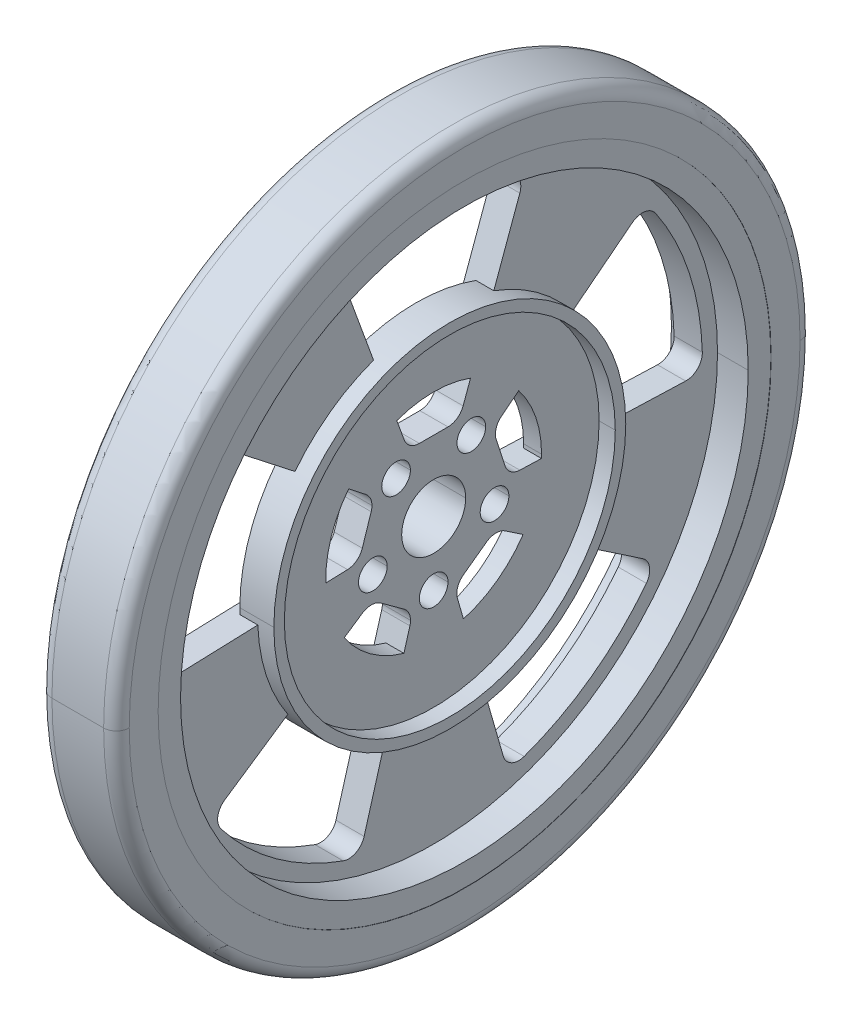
ISO-10303-21;
HEADER;
FILE_DESCRIPTION(('STEP AP214'),'2;1');
FILE_NAME('part.step','',(''),(''),'','','');
FILE_SCHEMA(('AUTOMOTIVE_DESIGN { 1 0 10303 214 1 1 1 1 }'));
ENDSEC;
DATA;
#1=APPLICATION_CONTEXT('core data for automotive mechanical design processes');
#2=APPLICATION_PROTOCOL_DEFINITION('international standard','automotive_design',2000,#1);
#3=PRODUCT_CONTEXT('',#1,'mechanical');
#4=PRODUCT('Part','Part','',(#3));
#5=PRODUCT_RELATED_PRODUCT_CATEGORY('part','',(#4));
#6=PRODUCT_DEFINITION_FORMATION('','',#4);
#7=PRODUCT_DEFINITION_CONTEXT('part definition',#1,'design');
#8=PRODUCT_DEFINITION('design','',#6,#7);
#9=PRODUCT_DEFINITION_SHAPE('','',#8);
#10=(LENGTH_UNIT() NAMED_UNIT(*) SI_UNIT(.MILLI.,.METRE.));
#11=(NAMED_UNIT(*) PLANE_ANGLE_UNIT() SI_UNIT($,.RADIAN.));
#12=(NAMED_UNIT(*) SI_UNIT($,.STERADIAN.) SOLID_ANGLE_UNIT());
#13=UNCERTAINTY_MEASURE_WITH_UNIT(LENGTH_MEASURE(1.E-05),#10,'distance_accuracy_value','');
#14=(GEOMETRIC_REPRESENTATION_CONTEXT(3) GLOBAL_UNCERTAINTY_ASSIGNED_CONTEXT((#13)) GLOBAL_UNIT_ASSIGNED_CONTEXT((#10,
#11,#12)) REPRESENTATION_CONTEXT('',''));
#15=CARTESIAN_POINT('',(0.,0.,0.));
#16=DIRECTION('',(0.,0.,1.));
#17=DIRECTION('',(1.,0.,0.));
#18=AXIS2_PLACEMENT_3D('',#15,#16,#17);
#19=CARTESIAN_POINT('',(7.6454,0.,0.));
#20=DIRECTION('',(1.,0.,0.));
#21=DIRECTION('',(0.,1.,0.));
#22=AXIS2_PLACEMENT_3D('',#19,#20,#21);
#23=PLANE('',#22);
#24=CARTESIAN_POINT('',(7.6454,0.,0.));
#25=DIRECTION('',(1.,0.,0.));
#26=DIRECTION('',(0.,0.,-1.));
#27=AXIS2_PLACEMENT_3D('',#24,#25,#26);
#28=CIRCLE('',#27,33.2867);
#29=CARTESIAN_POINT('',(7.6454,0.,-33.2867));
#30=VERTEX_POINT('',#29);
#31=CARTESIAN_POINT('',(7.6454,0.,33.2867));
#32=VERTEX_POINT('',#31);
#33=EDGE_CURVE('E48',#30,#32,#28,.T.);
#34=ORIENTED_EDGE('',*,*,#33,.T.);
#35=CARTESIAN_POINT('',(7.6454,0.,0.));
#36=DIRECTION('',(1.,0.,0.));
#37=DIRECTION('',(0.,0.,-1.));
#38=AXIS2_PLACEMENT_3D('',#35,#36,#37);
#39=CIRCLE('',#38,33.2867);
#40=EDGE_CURVE('E11',#32,#30,#39,.T.);
#41=ORIENTED_EDGE('',*,*,#40,.T.);
#42=EDGE_LOOP('',(#34,#41));
#43=FACE_BOUND('',#42,.T.);
#44=CARTESIAN_POINT('',(7.6454,0.,0.));
#45=DIRECTION('',(1.,0.,0.));
#46=DIRECTION('',(0.,0.,-1.));
#47=AXIS2_PLACEMENT_3D('',#44,#45,#46);
#48=CIRCLE('',#47,30.4165);
#49=CARTESIAN_POINT('',(7.6454,0.,-30.4165));
#50=VERTEX_POINT('',#49);
#51=CARTESIAN_POINT('',(7.6454,0.,30.4165));
#52=VERTEX_POINT('',#51);
#53=EDGE_CURVE('E828',#50,#52,#48,.T.);
#54=ORIENTED_EDGE('',*,*,#53,.F.);
#55=CARTESIAN_POINT('',(7.6454,0.,0.));
#56=DIRECTION('',(1.,0.,0.));
#57=DIRECTION('',(0.,0.,-1.));
#58=AXIS2_PLACEMENT_3D('',#55,#56,#57);
#59=CIRCLE('',#58,30.4165);
#60=EDGE_CURVE('E1084',#52,#50,#59,.T.);
#61=ORIENTED_EDGE('',*,*,#60,.F.);
#62=EDGE_LOOP('',(#54,#61));
#63=FACE_BOUND('',#62,.T.);
#64=ADVANCED_FACE('F39',(#43,#63),#23,.T.);
#65=CARTESIAN_POINT('',(-0.0254,0.,0.));
#66=DIRECTION('',(1.,0.,0.));
#67=DIRECTION('',(0.,0.,-1.));
#68=AXIS2_PLACEMENT_3D('',#65,#66,#67);
#69=CYLINDRICAL_SURFACE('',#68,30.4165);
#70=DIRECTION('',(1.,0.,0.));
#71=VECTOR('',#70,1.);
#72=CARTESIAN_POINT('',(-0.0254,0.,30.4165));
#73=LINE('',#72,#71);
#74=CARTESIAN_POINT('',(7.62,0.,30.4165));
#75=VERTEX_POINT('',#74);
#76=EDGE_CURVE('E1652',#75,#52,#73,.T.);
#77=ORIENTED_EDGE('',*,*,#76,.F.);
#78=CARTESIAN_POINT('',(7.62,0.,0.));
#79=DIRECTION('',(1.,0.,0.));
#80=DIRECTION('',(0.,0.,-1.));
#81=AXIS2_PLACEMENT_3D('',#78,#79,#80);
#82=CIRCLE('',#81,30.4165);
#83=CARTESIAN_POINT('',(7.62,0.,-30.4165));
#84=VERTEX_POINT('',#83);
#85=EDGE_CURVE('E1011',#84,#75,#82,.T.);
#86=ORIENTED_EDGE('',*,*,#85,.F.);
#87=DIRECTION('',(1.,0.,0.));
#88=VECTOR('',#87,1.);
#89=CARTESIAN_POINT('',(-0.0254,0.,-30.4165));
#90=LINE('',#89,#88);
#91=EDGE_CURVE('E1080',#84,#50,#90,.T.);
#92=ORIENTED_EDGE('',*,*,#91,.T.);
#93=ORIENTED_EDGE('',*,*,#53,.T.);
#94=EDGE_LOOP('',(#77,#86,#92,#93));
#95=FACE_BOUND('',#94,.T.);
#96=ADVANCED_FACE('F2010',(#95),#69,.F.);
#97=CARTESIAN_POINT('',(-0.0254,0.,0.));
#98=DIRECTION('',(1.,0.,0.));
#99=DIRECTION('',(0.,1.,0.));
#100=AXIS2_PLACEMENT_3D('',#97,#98,#99);
#101=PLANE('',#100);
#102=CARTESIAN_POINT('',(-0.0254000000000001,0.,0.));
#103=DIRECTION('',(1.,0.,0.));
#104=DIRECTION('',(0.,0.,-1.));
#105=AXIS2_PLACEMENT_3D('',#102,#103,#104);
#106=CIRCLE('',#105,33.2867);
#107=CARTESIAN_POINT('',(-0.0254,0.,33.2867));
#108=VERTEX_POINT('',#107);
#109=CARTESIAN_POINT('',(-0.0254,0.,-33.2867));
#110=VERTEX_POINT('',#109);
#111=EDGE_CURVE('E1054',#108,#110,#106,.F.);
#112=ORIENTED_EDGE('',*,*,#111,.T.);
#113=CARTESIAN_POINT('',(-0.0254000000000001,0.,0.));
#114=DIRECTION('',(1.,0.,0.));
#115=DIRECTION('',(0.,0.,-1.));
#116=AXIS2_PLACEMENT_3D('',#113,#114,#115);
#117=CIRCLE('',#116,33.2867);
#118=EDGE_CURVE('E1056',#110,#108,#117,.F.);
#119=ORIENTED_EDGE('',*,*,#118,.T.);
#120=EDGE_LOOP('',(#112,#119));
#121=FACE_BOUND('',#120,.T.);
#122=CARTESIAN_POINT('',(-0.0254,0.,0.));
#123=DIRECTION('',(1.,0.,0.));
#124=DIRECTION('',(0.,0.,-1.));
#125=AXIS2_PLACEMENT_3D('',#122,#123,#124);
#126=CIRCLE('',#125,30.4165);
#127=CARTESIAN_POINT('',(-0.0254,0.,-30.4165));
#128=VERTEX_POINT('',#127);
#129=CARTESIAN_POINT('',(-0.0254,0.,30.4165));
#130=VERTEX_POINT('',#129);
#131=EDGE_CURVE('E819',#128,#130,#126,.T.);
#132=ORIENTED_EDGE('',*,*,#131,.T.);
#133=CARTESIAN_POINT('',(-0.0254,0.,0.));
#134=DIRECTION('',(1.,0.,0.));
#135=DIRECTION('',(0.,0.,-1.));
#136=AXIS2_PLACEMENT_3D('',#133,#134,#135);
#137=CIRCLE('',#136,30.4165);
#138=EDGE_CURVE('E823',#130,#128,#137,.T.);
#139=ORIENTED_EDGE('',*,*,#138,.T.);
#140=EDGE_LOOP('',(#132,#139));
#141=FACE_BOUND('',#140,.T.);
#142=ADVANCED_FACE('F821',(#121,#141),#101,.F.);
#143=CARTESIAN_POINT('',(-0.0254,0.,0.));
#144=DIRECTION('',(1.,0.,0.));
#145=DIRECTION('',(0.,0.,-1.));
#146=AXIS2_PLACEMENT_3D('',#143,#144,#145);
#147=CYLINDRICAL_SURFACE('',#146,34.5567);
#148=DIRECTION('',(1.,0.,0.));
#149=VECTOR('',#148,1.);
#150=CARTESIAN_POINT('',(-0.0254,0.,34.5567));
#151=LINE('',#150,#149);
#152=CARTESIAN_POINT('',(1.2446,0.,34.5567));
#153=VERTEX_POINT('',#152);
#154=CARTESIAN_POINT('',(6.3754,0.,34.5567));
#155=VERTEX_POINT('',#154);
#156=EDGE_CURVE('E850',#153,#155,#151,.T.);
#157=ORIENTED_EDGE('',*,*,#156,.F.);
#158=CARTESIAN_POINT('',(1.2446,0.,0.));
#159=DIRECTION('',(1.,0.,0.));
#160=DIRECTION('',(0.,0.,-1.));
#161=AXIS2_PLACEMENT_3D('',#158,#159,#160);
#162=CIRCLE('',#161,34.5567);
#163=CARTESIAN_POINT('',(1.2446,0.,-34.5567));
#164=VERTEX_POINT('',#163);
#165=EDGE_CURVE('E1051',#153,#164,#162,.T.);
#166=ORIENTED_EDGE('',*,*,#165,.T.);
#167=DIRECTION('',(1.,0.,0.));
#168=VECTOR('',#167,1.);
#169=CARTESIAN_POINT('',(-0.0254,0.,-34.5567));
#170=LINE('',#169,#168);
#171=CARTESIAN_POINT('',(6.3754,0.,-34.5567));
#172=VERTEX_POINT('',#171);
#173=EDGE_CURVE('E844',#164,#172,#170,.T.);
#174=ORIENTED_EDGE('',*,*,#173,.T.);
#175=CARTESIAN_POINT('',(6.3754,0.,0.));
#176=DIRECTION('',(1.,0.,0.));
#177=DIRECTION('',(0.,0.,-1.));
#178=AXIS2_PLACEMENT_3D('',#175,#176,#177);
#179=CIRCLE('',#178,34.5567);
#180=EDGE_CURVE('E1048',#172,#155,#179,.F.);
#181=ORIENTED_EDGE('',*,*,#180,.T.);
#182=EDGE_LOOP('',(#157,#166,#174,#181));
#183=FACE_BOUND('',#182,.T.);
#184=ADVANCED_FACE('F1076',(#183),#147,.T.);
#185=CARTESIAN_POINT('',(-0.0254,0.,0.));
#186=DIRECTION('',(1.,0.,0.));
#187=DIRECTION('',(0.,0.,-1.));
#188=AXIS2_PLACEMENT_3D('',#185,#186,#187);
#189=CYLINDRICAL_SURFACE('',#188,30.4165);
#190=DIRECTION('',(1.,0.,0.));
#191=VECTOR('',#190,1.);
#192=CARTESIAN_POINT('',(-0.0254,0.,30.4165));
#193=LINE('',#192,#191);
#194=CARTESIAN_POINT('',(0.,0.,30.4165));
#195=VERTEX_POINT('',#194);
#196=EDGE_CURVE('E832',#130,#195,#193,.T.);
#197=ORIENTED_EDGE('',*,*,#196,.F.);
#198=ORIENTED_EDGE('',*,*,#131,.F.);
#199=DIRECTION('',(1.,0.,0.));
#200=VECTOR('',#199,1.);
#201=CARTESIAN_POINT('',(-0.0254,0.,-30.4165));
#202=LINE('',#201,#200);
#203=CARTESIAN_POINT('',(0.,0.,-30.4165));
#204=VERTEX_POINT('',#203);
#205=EDGE_CURVE('E842',#128,#204,#202,.T.);
#206=ORIENTED_EDGE('',*,*,#205,.T.);
#207=CARTESIAN_POINT('',(0.,0.,0.));
#208=DIRECTION('',(1.,0.,0.));
#209=DIRECTION('',(0.,0.,-1.));
#210=AXIS2_PLACEMENT_3D('',#207,#208,#209);
#211=CIRCLE('',#210,30.4165);
#212=EDGE_CURVE('E834',#204,#195,#211,.T.);
#213=ORIENTED_EDGE('',*,*,#212,.T.);
#214=EDGE_LOOP('',(#197,#198,#206,#213));
#215=FACE_BOUND('',#214,.T.);
#216=ADVANCED_FACE('F833',(#215),#189,.F.);
#217=CARTESIAN_POINT('',(0.,-1.96225791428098,6.0392088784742));
#218=DIRECTION('',(1.,0.,0.));
#219=DIRECTION('',(0.,0.,-1.));
#220=AXIS2_PLACEMENT_3D('',#217,#218,#219);
#221=CYLINDRICAL_SURFACE('',#220,1.4224);
#222=DIRECTION('',(1.,0.,0.));
#223=VECTOR('',#222,1.);
#224=CARTESIAN_POINT('',(0.,-1.96225791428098,7.4616088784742));
#225=LINE('',#224,#223);
#226=CARTESIAN_POINT('',(1.778,-1.96225791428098,7.4616088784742));
#227=VERTEX_POINT('',#226);
#228=CARTESIAN_POINT('',(4.572,-1.96225791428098,7.4616088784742));
#229=VERTEX_POINT('',#228);
#230=EDGE_CURVE('E1200',#227,#229,#225,.T.);
#231=ORIENTED_EDGE('',*,*,#230,.F.);
#232=CARTESIAN_POINT('',(1.778,-1.96225791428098,6.0392088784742));
#233=DIRECTION('',(-1.,0.,0.));
#234=DIRECTION('',(0.,0.,1.));
#235=AXIS2_PLACEMENT_3D('',#232,#233,#234);
#236=CIRCLE('',#235,1.4224);
#237=CARTESIAN_POINT('',(1.778,-1.96225791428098,4.6168088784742));
#238=VERTEX_POINT('',#237);
#239=EDGE_CURVE('E1503',#227,#238,#236,.T.);
#240=ORIENTED_EDGE('',*,*,#239,.T.);
#241=DIRECTION('',(1.,0.,0.));
#242=VECTOR('',#241,1.);
#243=CARTESIAN_POINT('',(0.,-1.96225791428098,4.6168088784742));
#244=LINE('',#243,#242);
#245=CARTESIAN_POINT('',(4.572,-1.96225791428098,4.6168088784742));
#246=VERTEX_POINT('',#245);
#247=EDGE_CURVE('E1175',#238,#246,#244,.T.);
#248=ORIENTED_EDGE('',*,*,#247,.T.);
#249=CARTESIAN_POINT('',(4.572,-1.96225791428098,6.0392088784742));
#250=DIRECTION('',(1.,0.,0.));
#251=DIRECTION('',(0.,-0.95105651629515,-0.309016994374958));
#252=AXIS2_PLACEMENT_3D('',#249,#250,#251);
#253=CIRCLE('',#252,1.4224);
#254=EDGE_CURVE('E988',#246,#229,#253,.T.);
#255=ORIENTED_EDGE('',*,*,#254,.T.);
#256=EDGE_LOOP('',(#231,#240,#248,#255));
#257=FACE_BOUND('',#256,.T.);
#258=ADVANCED_FACE('F2701',(#257),#221,.F.);
#259=CARTESIAN_POINT('',(0.,5.13725791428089,3.73243635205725));
#260=DIRECTION('',(1.,0.,0.));
#261=DIRECTION('',(0.,0.,-1.));
#262=AXIS2_PLACEMENT_3D('',#259,#260,#261);
#263=CYLINDRICAL_SURFACE('',#262,1.4224);
#264=DIRECTION('',(1.,0.,0.));
#265=VECTOR('',#264,1.);
#266=CARTESIAN_POINT('',(0.,5.13725791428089,5.15483635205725));
#267=LINE('',#266,#265);
#268=CARTESIAN_POINT('',(1.778,5.13725791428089,5.15483635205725));
#269=VERTEX_POINT('',#268);
#270=CARTESIAN_POINT('',(4.572,5.13725791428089,5.15483635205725));
#271=VERTEX_POINT('',#270);
#272=EDGE_CURVE('E1174',#269,#271,#267,.T.);
#273=ORIENTED_EDGE('',*,*,#272,.F.);
#274=CARTESIAN_POINT('',(1.778,5.13725791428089,3.73243635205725));
#275=DIRECTION('',(-1.,0.,0.));
#276=DIRECTION('',(0.,0.,1.));
#277=AXIS2_PLACEMENT_3D('',#274,#275,#276);
#278=CIRCLE('',#277,1.4224);
#279=CARTESIAN_POINT('',(1.778,5.13725791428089,2.31003635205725));
#280=VERTEX_POINT('',#279);
#281=EDGE_CURVE('E982',#269,#280,#278,.T.);
#282=ORIENTED_EDGE('',*,*,#281,.T.);
#283=DIRECTION('',(1.,0.,0.));
#284=VECTOR('',#283,1.);
#285=CARTESIAN_POINT('',(0.,5.13725791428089,2.31003635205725));
#286=LINE('',#285,#284);
#287=CARTESIAN_POINT('',(4.572,5.13725791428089,2.31003635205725));
#288=VERTEX_POINT('',#287);
#289=EDGE_CURVE('E1015',#280,#288,#286,.T.);
#290=ORIENTED_EDGE('',*,*,#289,.T.);
#291=CARTESIAN_POINT('',(4.572,5.13725791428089,3.73243635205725));
#292=DIRECTION('',(1.,0.,0.));
#293=DIRECTION('',(0.,-0.58778525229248,0.809016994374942));
#294=AXIS2_PLACEMENT_3D('',#291,#292,#293);
#295=CIRCLE('',#294,1.4224);
#296=EDGE_CURVE('E991',#288,#271,#295,.T.);
#297=ORIENTED_EDGE('',*,*,#296,.T.);
#298=EDGE_LOOP('',(#273,#282,#290,#297));
#299=FACE_BOUND('',#298,.T.);
#300=ADVANCED_FACE('F2696',(#299),#263,.F.);
#301=CARTESIAN_POINT('',(0.,5.13725791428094,-3.73243635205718));
#302=DIRECTION('',(1.,0.,0.));
#303=DIRECTION('',(0.,0.,-1.));
#304=AXIS2_PLACEMENT_3D('',#301,#302,#303);
#305=CYLINDRICAL_SURFACE('',#304,1.4224);
#306=DIRECTION('',(1.,0.,0.));
#307=VECTOR('',#306,1.);
#308=CARTESIAN_POINT('',(0.,5.13725791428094,-2.31003635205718));
#309=LINE('',#308,#307);
#310=CARTESIAN_POINT('',(1.778,5.13725791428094,-2.31003635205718));
#311=VERTEX_POINT('',#310);
#312=CARTESIAN_POINT('',(4.572,5.13725791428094,-2.31003635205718));
#313=VERTEX_POINT('',#312);
#314=EDGE_CURVE('E1460',#311,#313,#309,.T.);
#315=ORIENTED_EDGE('',*,*,#314,.F.);
#316=CARTESIAN_POINT('',(1.778,5.13725791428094,-3.73243635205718));
#317=DIRECTION('',(-1.,0.,0.));
#318=DIRECTION('',(0.,0.,1.));
#319=AXIS2_PLACEMENT_3D('',#316,#317,#318);
#320=CIRCLE('',#319,1.4224);
#321=CARTESIAN_POINT('',(1.778,5.13725791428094,-5.15483635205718));
#322=VERTEX_POINT('',#321);
#323=EDGE_CURVE('E978',#311,#322,#320,.T.);
#324=ORIENTED_EDGE('',*,*,#323,.T.);
#325=DIRECTION('',(1.,0.,0.));
#326=VECTOR('',#325,1.);
#327=CARTESIAN_POINT('',(0.,5.13725791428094,-5.15483635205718));
#328=LINE('',#327,#326);
#329=CARTESIAN_POINT('',(4.572,5.13725791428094,-5.15483635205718));
#330=VERTEX_POINT('',#329);
#331=EDGE_CURVE('E1306',#322,#330,#328,.T.);
#332=ORIENTED_EDGE('',*,*,#331,.T.);
#333=CARTESIAN_POINT('',(4.572,5.13725791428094,-3.73243635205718));
#334=DIRECTION('',(1.,0.,0.));
#335=DIRECTION('',(0.,0.587785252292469,0.809016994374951));
#336=AXIS2_PLACEMENT_3D('',#333,#334,#335);
#337=CIRCLE('',#336,1.4224);
#338=EDGE_CURVE('E1010',#330,#313,#337,.T.);
#339=ORIENTED_EDGE('',*,*,#338,.T.);
#340=EDGE_LOOP('',(#315,#324,#332,#339));
#341=FACE_BOUND('',#340,.T.);
#342=ADVANCED_FACE('F2700',(#341),#305,.F.);
#343=CARTESIAN_POINT('',(0.,-1.9622579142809,-6.03920887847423));
#344=DIRECTION('',(1.,0.,0.));
#345=DIRECTION('',(0.,0.,-1.));
#346=AXIS2_PLACEMENT_3D('',#343,#344,#345);
#347=CYLINDRICAL_SURFACE('',#346,1.4224);
#348=DIRECTION('',(1.,0.,0.));
#349=VECTOR('',#348,1.);
#350=CARTESIAN_POINT('',(0.,-1.9622579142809,-4.61680887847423));
#351=LINE('',#350,#349);
#352=CARTESIAN_POINT('',(1.778,-1.9622579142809,-4.61680887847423));
#353=VERTEX_POINT('',#352);
#354=CARTESIAN_POINT('',(4.572,-1.9622579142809,-4.61680887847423));
#355=VERTEX_POINT('',#354);
#356=EDGE_CURVE('E1562',#353,#355,#351,.T.);
#357=ORIENTED_EDGE('',*,*,#356,.F.);
#358=CARTESIAN_POINT('',(1.778,-1.9622579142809,-6.03920887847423));
#359=DIRECTION('',(-1.,0.,0.));
#360=DIRECTION('',(0.,0.,1.));
#361=AXIS2_PLACEMENT_3D('',#358,#359,#360);
#362=CIRCLE('',#361,1.4224);
#363=CARTESIAN_POINT('',(1.778,-1.9622579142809,-7.46160887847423));
#364=VERTEX_POINT('',#363);
#365=EDGE_CURVE('E981',#353,#364,#362,.T.);
#366=ORIENTED_EDGE('',*,*,#365,.T.);
#367=DIRECTION('',(1.,0.,0.));
#368=VECTOR('',#367,1.);
#369=CARTESIAN_POINT('',(0.,-1.9622579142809,-7.46160887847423));
#370=LINE('',#369,#368);
#371=CARTESIAN_POINT('',(4.572,-1.9622579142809,-7.46160887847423));
#372=VERTEX_POINT('',#371);
#373=EDGE_CURVE('E1138',#364,#372,#370,.T.);
#374=ORIENTED_EDGE('',*,*,#373,.T.);
#375=CARTESIAN_POINT('',(4.572,-1.9622579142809,-6.03920887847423));
#376=DIRECTION('',(1.,0.,0.));
#377=DIRECTION('',(0.,0.951056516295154,-0.309016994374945));
#378=AXIS2_PLACEMENT_3D('',#375,#376,#377);
#379=CIRCLE('',#378,1.4224);
#380=EDGE_CURVE('E1006',#372,#355,#379,.T.);
#381=ORIENTED_EDGE('',*,*,#380,.T.);
#382=EDGE_LOOP('',(#357,#366,#374,#381));
#383=FACE_BOUND('',#382,.T.);
#384=ADVANCED_FACE('F2708',(#383),#347,.F.);
#385=CARTESIAN_POINT('',(0.,-6.35,0.));
#386=DIRECTION('',(1.,0.,0.));
#387=DIRECTION('',(0.,0.,-1.));
#388=AXIS2_PLACEMENT_3D('',#385,#386,#387);
#389=CYLINDRICAL_SURFACE('',#388,1.4224);
#390=DIRECTION('',(1.,0.,0.));
#391=VECTOR('',#390,1.);
#392=CARTESIAN_POINT('',(0.,-6.35,1.4224));
#393=LINE('',#392,#391);
#394=CARTESIAN_POINT('',(1.778,-6.35,1.4224));
#395=VERTEX_POINT('',#394);
#396=CARTESIAN_POINT('',(4.572,-6.35,1.4224));
#397=VERTEX_POINT('',#396);
#398=EDGE_CURVE('E1137',#395,#397,#393,.T.);
#399=ORIENTED_EDGE('',*,*,#398,.F.);
#400=CARTESIAN_POINT('',(1.778,-6.35,0.));
#401=DIRECTION('',(-1.,0.,0.));
#402=DIRECTION('',(0.,0.,1.));
#403=AXIS2_PLACEMENT_3D('',#400,#401,#402);
#404=CIRCLE('',#403,1.4224);
#405=CARTESIAN_POINT('',(1.778,-6.35,-1.4224));
#406=VERTEX_POINT('',#405);
#407=EDGE_CURVE('E1153',#395,#406,#404,.T.);
#408=ORIENTED_EDGE('',*,*,#407,.T.);
#409=DIRECTION('',(1.,0.,0.));
#410=VECTOR('',#409,1.);
#411=CARTESIAN_POINT('',(0.,-6.35,-1.4224));
#412=LINE('',#411,#410);
#413=CARTESIAN_POINT('',(4.572,-6.35,-1.4224));
#414=VERTEX_POINT('',#413);
#415=EDGE_CURVE('E1367',#406,#414,#412,.T.);
#416=ORIENTED_EDGE('',*,*,#415,.T.);
#417=CARTESIAN_POINT('',(4.572,-6.35,0.));
#418=DIRECTION('',(1.,0.,0.));
#419=DIRECTION('',(0.,0.,-1.));
#420=AXIS2_PLACEMENT_3D('',#417,#418,#419);
#421=CIRCLE('',#420,1.4224);
#422=EDGE_CURVE('E1009',#414,#397,#421,.T.);
#423=ORIENTED_EDGE('',*,*,#422,.T.);
#424=EDGE_LOOP('',(#399,#408,#416,#423));
#425=FACE_BOUND('',#424,.T.);
#426=ADVANCED_FACE('F2711',(#425),#389,.F.);
#427=CARTESIAN_POINT('',(0.,0.,0.));
#428=DIRECTION('',(1.,0.,0.));
#429=DIRECTION('',(0.,0.,-1.));
#430=AXIS2_PLACEMENT_3D('',#427,#428,#429);
#431=CYLINDRICAL_SURFACE('',#430,3.175);
#432=DIRECTION('',(1.,0.,0.));
#433=VECTOR('',#432,1.);
#434=CARTESIAN_POINT('',(0.,0.,3.175));
#435=LINE('',#434,#433);
#436=CARTESIAN_POINT('',(0.,0.,3.175));
#437=VERTEX_POINT('',#436);
#438=CARTESIAN_POINT('',(4.572,0.,3.175));
#439=VERTEX_POINT('',#438);
#440=EDGE_CURVE('E1332',#437,#439,#435,.T.);
#441=ORIENTED_EDGE('',*,*,#440,.F.);
#442=CARTESIAN_POINT('',(0.,0.,0.));
#443=DIRECTION('',(1.,0.,0.));
#444=DIRECTION('',(0.,0.,-1.));
#445=AXIS2_PLACEMENT_3D('',#442,#443,#444);
#446=CIRCLE('',#445,3.175);
#447=CARTESIAN_POINT('',(0.,0.,-3.175));
#448=VERTEX_POINT('',#447);
#449=EDGE_CURVE('E1315',#448,#437,#446,.T.);
#450=ORIENTED_EDGE('',*,*,#449,.F.);
#451=DIRECTION('',(1.,0.,0.));
#452=VECTOR('',#451,1.);
#453=CARTESIAN_POINT('',(0.,0.,-3.175));
#454=LINE('',#453,#452);
#455=CARTESIAN_POINT('',(4.572,0.,-3.175));
#456=VERTEX_POINT('',#455);
#457=EDGE_CURVE('E1211',#448,#456,#454,.T.);
#458=ORIENTED_EDGE('',*,*,#457,.T.);
#459=CARTESIAN_POINT('',(4.572,0.,0.));
#460=DIRECTION('',(1.,0.,0.));
#461=DIRECTION('',(0.,0.,-1.));
#462=AXIS2_PLACEMENT_3D('',#459,#460,#461);
#463=CIRCLE('',#462,3.175);
#464=EDGE_CURVE('E1776',#456,#439,#463,.T.);
#465=ORIENTED_EDGE('',*,*,#464,.T.);
#466=EDGE_LOOP('',(#441,#450,#458,#465));
#467=FACE_BOUND('',#466,.T.);
#468=ADVANCED_FACE('F2805',(#467),#431,.F.);
#469=CARTESIAN_POINT('',(6.1722,0.,0.));
#470=DIRECTION('',(-1.,0.,0.));
#471=DIRECTION('',(0.,0.,1.));
#472=AXIS2_PLACEMENT_3D('',#469,#470,#471);
#473=CYLINDRICAL_SURFACE('',#472,16.4211);
#474=DIRECTION('',(-1.,0.,0.));
#475=VECTOR('',#474,1.);
#476=CARTESIAN_POINT('',(6.1722,0.,-16.4211));
#477=LINE('',#476,#475);
#478=CARTESIAN_POINT('',(6.1722,0.,-16.4211));
#479=VERTEX_POINT('',#478);
#480=CARTESIAN_POINT('',(4.572,0.,-16.4211));
#481=VERTEX_POINT('',#480);
#482=EDGE_CURVE('E1210',#479,#481,#477,.T.);
#483=ORIENTED_EDGE('',*,*,#482,.F.);
#484=CARTESIAN_POINT('',(6.1722,0.,0.));
#485=DIRECTION('',(1.,0.,0.));
#486=DIRECTION('',(0.,0.,-1.));
#487=AXIS2_PLACEMENT_3D('',#484,#485,#486);
#488=CIRCLE('',#487,16.4211);
#489=CARTESIAN_POINT('',(6.1722,0.,16.4211));
#490=VERTEX_POINT('',#489);
#491=EDGE_CURVE('E829',#479,#490,#488,.T.);
#492=ORIENTED_EDGE('',*,*,#491,.T.);
#493=DIRECTION('',(-1.,0.,0.));
#494=VECTOR('',#493,1.);
#495=CARTESIAN_POINT('',(6.1722,0.,16.4211));
#496=LINE('',#495,#494);
#497=CARTESIAN_POINT('',(4.572,0.,16.4211));
#498=VERTEX_POINT('',#497);
#499=EDGE_CURVE('E1548',#490,#498,#496,.T.);
#500=ORIENTED_EDGE('',*,*,#499,.T.);
#501=CARTESIAN_POINT('',(4.572,0.,0.));
#502=DIRECTION('',(-1.,0.,0.));
#503=DIRECTION('',(0.,0.,-1.));
#504=AXIS2_PLACEMENT_3D('',#501,#502,#503);
#505=CIRCLE('',#504,16.4211);
#506=EDGE_CURVE('E992',#498,#481,#505,.T.);
#507=ORIENTED_EDGE('',*,*,#506,.T.);
#508=EDGE_LOOP('',(#483,#492,#500,#507));
#509=FACE_BOUND('',#508,.T.);
#510=ADVANCED_FACE('F2061',(#509),#473,.F.);
#511=CARTESIAN_POINT('',(6.1722,0.,0.));
#512=DIRECTION('',(1.,0.,0.));
#513=DIRECTION('',(0.,1.,0.));
#514=AXIS2_PLACEMENT_3D('',#511,#512,#513);
#515=PLANE('',#514);
#516=CARTESIAN_POINT('',(6.1722,0.,0.));
#517=DIRECTION('',(1.,0.,0.));
#518=DIRECTION('',(0.,0.,-1.));
#519=AXIS2_PLACEMENT_3D('',#516,#517,#518);
#520=CIRCLE('',#519,16.4211);
#521=EDGE_CURVE('E1206',#490,#479,#520,.T.);
#522=ORIENTED_EDGE('',*,*,#521,.F.);
#523=ORIENTED_EDGE('',*,*,#491,.F.);
#524=EDGE_LOOP('',(#522,#523));
#525=FACE_BOUND('',#524,.T.);
#526=CARTESIAN_POINT('',(6.1722,0.,0.));
#527=DIRECTION('',(1.,0.,0.));
#528=DIRECTION('',(0.,0.,-1.));
#529=AXIS2_PLACEMENT_3D('',#526,#527,#528);
#530=CIRCLE('',#529,17.4625);
#531=CARTESIAN_POINT('',(6.1722,0.,-17.4625));
#532=VERTEX_POINT('',#531);
#533=CARTESIAN_POINT('',(6.1722,0.,17.4625));
#534=VERTEX_POINT('',#533);
#535=EDGE_CURVE('E872',#532,#534,#530,.T.);
#536=ORIENTED_EDGE('',*,*,#535,.T.);
#537=CARTESIAN_POINT('',(6.1722,0.,0.));
#538=DIRECTION('',(1.,0.,0.));
#539=DIRECTION('',(0.,0.,-1.));
#540=AXIS2_PLACEMENT_3D('',#537,#538,#539);
#541=CIRCLE('',#540,17.4625);
#542=EDGE_CURVE('E1366',#534,#532,#541,.T.);
#543=ORIENTED_EDGE('',*,*,#542,.T.);
#544=EDGE_LOOP('',(#536,#543));
#545=FACE_BOUND('',#544,.T.);
#546=ADVANCED_FACE('F2057',(#525,#545),#515,.T.);
#547=CARTESIAN_POINT('',(2.794,0.,0.));
#548=DIRECTION('',(1.,0.,0.));
#549=DIRECTION('',(0.,0.,-1.));
#550=AXIS2_PLACEMENT_3D('',#547,#548,#549);
#551=CYLINDRICAL_SURFACE('',#550,10.7061);
#552=CARTESIAN_POINT('',(4.572,0.,0.));
#553=DIRECTION('',(1.,0.,0.));
#554=DIRECTION('',(0.,0.,-1.));
#555=AXIS2_PLACEMENT_3D('',#552,#553,#554);
#556=CIRCLE('',#555,10.7061);
#557=CARTESIAN_POINT('',(4.572,10.0615223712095,-3.65873540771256));
#558=VERTEX_POINT('',#557);
#559=CARTESIAN_POINT('',(4.572,10.0615223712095,3.65873540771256));
#560=VERTEX_POINT('',#559);
#561=EDGE_CURVE('E1423',#558,#560,#556,.T.);
#562=ORIENTED_EDGE('',*,*,#561,.T.);
#563=DIRECTION('',(-1.,0.,0.));
#564=VECTOR('',#563,1.);
#565=CARTESIAN_POINT('',(2.794,10.0615223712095,3.65873540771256));
#566=LINE('',#565,#564);
#567=CARTESIAN_POINT('',(2.794,10.0615223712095,3.65873540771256));
#568=VERTEX_POINT('',#567);
#569=EDGE_CURVE('E1239',#560,#568,#566,.T.);
#570=ORIENTED_EDGE('',*,*,#569,.T.);
#571=CARTESIAN_POINT('',(2.794,0.,0.));
#572=DIRECTION('',(1.,0.,0.));
#573=DIRECTION('',(0.,0.,-1.));
#574=AXIS2_PLACEMENT_3D('',#571,#572,#573);
#575=CIRCLE('',#574,10.7061);
#576=CARTESIAN_POINT('',(2.794,10.0615223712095,-3.65873540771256));
#577=VERTEX_POINT('',#576);
#578=EDGE_CURVE('E920',#577,#568,#575,.T.);
#579=ORIENTED_EDGE('',*,*,#578,.F.);
#580=DIRECTION('',(1.,0.,0.));
#581=VECTOR('',#580,1.);
#582=CARTESIAN_POINT('',(2.794,10.0615223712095,-3.65873540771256));
#583=LINE('',#582,#581);
#584=EDGE_CURVE('E951',#577,#558,#583,.T.);
#585=ORIENTED_EDGE('',*,*,#584,.T.);
#586=EDGE_LOOP('',(#562,#570,#579,#585));
#587=FACE_BOUND('',#586,.T.);
#588=ADVANCED_FACE('F2060',(#587),#551,.F.);
#589=CARTESIAN_POINT('',(2.794,0.,0.));
#590=DIRECTION('',(1.,0.,0.));
#591=DIRECTION('',(0.,1.,0.));
#592=AXIS2_PLACEMENT_3D('',#589,#590,#591);
#593=PLANE('',#592);
#594=ORIENTED_EDGE('',*,*,#578,.T.);
#595=DIRECTION('',(0.,0.939793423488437,0.341743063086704));
#596=VECTOR('',#595,1.);
#597=CARTESIAN_POINT('',(2.794,6.985,2.54));
#598=LINE('',#597,#596);
#599=CARTESIAN_POINT('',(2.794,16.4111426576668,5.96768823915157));
#600=VERTEX_POINT('',#599);
#601=EDGE_CURVE('E1475',#568,#600,#598,.T.);
#602=ORIENTED_EDGE('',*,*,#601,.T.);
#603=CARTESIAN_POINT('',(2.794,0.,0.));
#604=DIRECTION('',(1.,0.,0.));
#605=DIRECTION('',(0.,0.,-1.));
#606=AXIS2_PLACEMENT_3D('',#603,#604,#605);
#607=CIRCLE('',#606,17.4625);
#608=CARTESIAN_POINT('',(2.794,16.4111426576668,-5.96768823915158));
#609=VERTEX_POINT('',#608);
#610=EDGE_CURVE('E1147',#609,#600,#607,.T.);
#611=ORIENTED_EDGE('',*,*,#610,.F.);
#612=DIRECTION('',(0.,-0.939793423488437,0.341743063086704));
#613=VECTOR('',#612,1.);
#614=CARTESIAN_POINT('',(2.794,25.0642906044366,-9.1142874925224));
#615=LINE('',#614,#613);
#616=EDGE_CURVE('E1323',#609,#577,#615,.T.);
#617=ORIENTED_EDGE('',*,*,#616,.T.);
#618=EDGE_LOOP('',(#594,#602,#611,#617));
#619=FACE_BOUND('',#618,.T.);
#620=ADVANCED_FACE('F1932',(#619),#593,.F.);
#621=CARTESIAN_POINT('',(2.794,0.,0.));
#622=DIRECTION('',(1.,0.,0.));
#623=DIRECTION('',(0.,0.,-1.));
#624=AXIS2_PLACEMENT_3D('',#621,#622,#623);
#625=CYLINDRICAL_SURFACE('',#624,17.4625);
#626=DIRECTION('',(1.,0.,0.));
#627=VECTOR('',#626,1.);
#628=CARTESIAN_POINT('',(2.794,0.,17.4625));
#629=LINE('',#628,#627);
#630=CARTESIAN_POINT('',(2.794,0.,17.4625));
#631=VERTEX_POINT('',#630);
#632=EDGE_CURVE('E1512',#631,#534,#629,.T.);
#633=ORIENTED_EDGE('',*,*,#632,.F.);
#634=CARTESIAN_POINT('',(2.794,0.,0.));
#635=DIRECTION('',(1.,0.,0.));
#636=DIRECTION('',(0.,0.,-1.));
#637=AXIS2_PLACEMENT_3D('',#634,#635,#636);
#638=CIRCLE('',#637,17.4625);
#639=CARTESIAN_POINT('',(2.794,-0.604286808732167,17.4520412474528));
#640=VERTEX_POINT('',#639);
#641=EDGE_CURVE('E1257',#631,#640,#638,.T.);
#642=ORIENTED_EDGE('',*,*,#641,.T.);
#643=DIRECTION('',(-1.,0.,0.));
#644=VECTOR('',#643,1.);
#645=CARTESIAN_POINT('',(2.794,-0.604286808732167,17.4520412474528));
#646=LINE('',#645,#644);
#647=CARTESIAN_POINT('',(4.572,-0.604286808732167,17.4520412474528));
#648=VERTEX_POINT('',#647);
#649=EDGE_CURVE('E960',#648,#640,#646,.T.);
#650=ORIENTED_EDGE('',*,*,#649,.F.);
#651=CARTESIAN_POINT('',(4.572,0.,0.));
#652=DIRECTION('',(1.,0.,0.));
#653=DIRECTION('',(0.,0.,-1.));
#654=AXIS2_PLACEMENT_3D('',#651,#652,#653);
#655=CIRCLE('',#654,17.4625);
#656=CARTESIAN_POINT('',(4.572,-9.76917416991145,14.4741888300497));
#657=VERTEX_POINT('',#656);
#658=EDGE_CURVE('E1357',#648,#657,#655,.T.);
#659=ORIENTED_EDGE('',*,*,#658,.T.);
#660=DIRECTION('',(1.,0.,0.));
#661=VECTOR('',#660,1.);
#662=CARTESIAN_POINT('',(2.794,-9.76917416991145,14.4741888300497));
#663=LINE('',#662,#661);
#664=CARTESIAN_POINT('',(2.794,-9.76917416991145,14.4741888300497));
#665=VERTEX_POINT('',#664);
#666=EDGE_CURVE('E1186',#665,#657,#663,.T.);
#667=ORIENTED_EDGE('',*,*,#666,.F.);
#668=CARTESIAN_POINT('',(2.794,0.,0.));
#669=DIRECTION('',(1.,0.,0.));
#670=DIRECTION('',(0.,0.,-1.));
#671=AXIS2_PLACEMENT_3D('',#668,#669,#670);
#672=CIRCLE('',#671,17.4625);
#673=CARTESIAN_POINT('',(2.794,-16.7846124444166,4.81826642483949));
#674=VERTEX_POINT('',#673);
#675=EDGE_CURVE('E1263',#665,#674,#672,.T.);
#676=ORIENTED_EDGE('',*,*,#675,.T.);
#677=DIRECTION('',(-1.,0.,0.));
#678=VECTOR('',#677,1.);
#679=CARTESIAN_POINT('',(2.794,-16.7846124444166,4.81826642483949));
#680=LINE('',#679,#678);
#681=CARTESIAN_POINT('',(4.572,-16.7846124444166,4.81826642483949));
#682=VERTEX_POINT('',#681);
#683=EDGE_CURVE('E896',#682,#674,#680,.T.);
#684=ORIENTED_EDGE('',*,*,#683,.F.);
#685=CARTESIAN_POINT('',(4.572,0.,0.));
#686=DIRECTION('',(1.,0.,0.));
#687=DIRECTION('',(0.,0.,-1.));
#688=AXIS2_PLACEMENT_3D('',#685,#686,#687);
#689=CIRCLE('',#688,17.4625);
#690=CARTESIAN_POINT('',(4.572,-16.7846124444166,-4.81826642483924));
#691=VERTEX_POINT('',#690);
#692=EDGE_CURVE('E970',#682,#691,#689,.T.);
#693=ORIENTED_EDGE('',*,*,#692,.T.);
#694=DIRECTION('',(1.,0.,0.));
#695=VECTOR('',#694,1.);
#696=CARTESIAN_POINT('',(2.794,-16.7846124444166,-4.81826642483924));
#697=LINE('',#696,#695);
#698=CARTESIAN_POINT('',(2.794,-16.7846124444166,-4.81826642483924));
#699=VERTEX_POINT('',#698);
#700=EDGE_CURVE('E1099',#699,#691,#697,.T.);
#701=ORIENTED_EDGE('',*,*,#700,.F.);
#702=CARTESIAN_POINT('',(2.794,0.,0.));
#703=DIRECTION('',(1.,0.,0.));
#704=DIRECTION('',(0.,0.,-1.));
#705=AXIS2_PLACEMENT_3D('',#702,#703,#704);
#706=CIRCLE('',#705,17.4625);
#707=CARTESIAN_POINT('',(2.794,-9.76917416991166,-14.4741888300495));
#708=VERTEX_POINT('',#707);
#709=EDGE_CURVE('E1674',#699,#708,#706,.T.);
#710=ORIENTED_EDGE('',*,*,#709,.T.);
#711=DIRECTION('',(-1.,0.,0.));
#712=VECTOR('',#711,1.);
#713=CARTESIAN_POINT('',(2.794,-9.76917416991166,-14.4741888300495));
#714=LINE('',#713,#712);
#715=CARTESIAN_POINT('',(4.572,-9.76917416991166,-14.4741888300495));
#716=VERTEX_POINT('',#715);
#717=EDGE_CURVE('E1276',#716,#708,#714,.T.);
#718=ORIENTED_EDGE('',*,*,#717,.F.);
#719=CARTESIAN_POINT('',(4.572,0.,0.));
#720=DIRECTION('',(1.,0.,0.));
#721=DIRECTION('',(0.,0.,-1.));
#722=AXIS2_PLACEMENT_3D('',#719,#720,#721);
#723=CIRCLE('',#722,17.4625);
#724=CARTESIAN_POINT('',(4.572,-0.604286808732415,-17.4520412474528));
#725=VERTEX_POINT('',#724);
#726=EDGE_CURVE('E1236',#716,#725,#723,.T.);
#727=ORIENTED_EDGE('',*,*,#726,.T.);
#728=DIRECTION('',(1.,0.,0.));
#729=VECTOR('',#728,1.);
#730=CARTESIAN_POINT('',(2.794,-0.604286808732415,-17.4520412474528));
#731=LINE('',#730,#729);
#732=CARTESIAN_POINT('',(2.794,-0.604286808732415,-17.4520412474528));
#733=VERTEX_POINT('',#732);
#734=EDGE_CURVE('E1631',#733,#725,#731,.T.);
#735=ORIENTED_EDGE('',*,*,#734,.F.);
#736=CARTESIAN_POINT('',(2.794,0.,0.));
#737=DIRECTION('',(1.,0.,0.));
#738=DIRECTION('',(0.,0.,-1.));
#739=AXIS2_PLACEMENT_3D('',#736,#737,#738);
#740=CIRCLE('',#739,17.4625);
#741=CARTESIAN_POINT('',(2.794,0.,-17.4625));
#742=VERTEX_POINT('',#741);
#743=EDGE_CURVE('E1378',#733,#742,#740,.T.);
#744=ORIENTED_EDGE('',*,*,#743,.T.);
#745=DIRECTION('',(1.,0.,0.));
#746=VECTOR('',#745,1.);
#747=CARTESIAN_POINT('',(2.794,0.,-17.4625));
#748=LINE('',#747,#746);
#749=EDGE_CURVE('E867',#742,#532,#748,.T.);
#750=ORIENTED_EDGE('',*,*,#749,.T.);
#751=ORIENTED_EDGE('',*,*,#542,.F.);
#752=EDGE_LOOP('',(#633,#642,#650,#659,#667,#676,#684,#693,#701,#710,#718,#727,#735,#744,#750,#751));
#753=FACE_BOUND('',#752,.T.);
#754=ADVANCED_FACE('F2005',(#753),#625,.T.);
#755=CARTESIAN_POINT('',(2.794,0.,0.));
#756=DIRECTION('',(1.,0.,0.));
#757=DIRECTION('',(0.,1.,0.));
#758=AXIS2_PLACEMENT_3D('',#755,#756,#757);
#759=PLANE('',#758);
#760=CARTESIAN_POINT('',(2.794,0.,0.));
#761=DIRECTION('',(1.,0.,0.));
#762=DIRECTION('',(0.,0.,-1.));
#763=AXIS2_PLACEMENT_3D('',#760,#761,#762);
#764=CIRCLE('',#763,10.7061);
#765=CARTESIAN_POINT('',(2.794,-0.370482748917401,-10.6996878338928));
#766=VERTEX_POINT('',#765);
#767=CARTESIAN_POINT('',(2.794,0.,-10.7061));
#768=VERTEX_POINT('',#767);
#769=EDGE_CURVE('E1381',#766,#768,#764,.T.);
#770=ORIENTED_EDGE('',*,*,#769,.T.);
#771=CARTESIAN_POINT('',(2.794,0.,0.));
#772=DIRECTION('',(1.,0.,0.));
#773=DIRECTION('',(0.,0.,-1.));
#774=AXIS2_PLACEMENT_3D('',#771,#772,#773);
#775=CIRCLE('',#774,10.7061);
#776=CARTESIAN_POINT('',(2.794,6.58884555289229,-8.4384649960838));
#777=VERTEX_POINT('',#776);
#778=EDGE_CURVE('E1244',#768,#777,#775,.T.);
#779=ORIENTED_EDGE('',*,*,#778,.T.);
#780=DIRECTION('',(0.,0.615429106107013,-0.788192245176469));
#781=VECTOR('',#780,1.);
#782=CARTESIAN_POINT('',(2.794,4.57416725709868,-5.8582266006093));
#783=LINE('',#782,#781);
#784=CARTESIAN_POINT('',(2.794,10.7469307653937,-13.7638070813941));
#785=VERTEX_POINT('',#784);
#786=EDGE_CURVE('E935',#777,#785,#783,.T.);
#787=ORIENTED_EDGE('',*,*,#786,.T.);
#788=CARTESIAN_POINT('',(2.794,0.,0.));
#789=DIRECTION('',(1.,0.,0.));
#790=DIRECTION('',(0.,0.,-1.));
#791=AXIS2_PLACEMENT_3D('',#788,#789,#790);
#792=CIRCLE('',#791,17.4625);
#793=EDGE_CURVE('E871',#742,#785,#792,.T.);
#794=ORIENTED_EDGE('',*,*,#793,.F.);
#795=ORIENTED_EDGE('',*,*,#743,.F.);
#796=DIRECTION('',(0.,0.0346048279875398,0.99940107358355));
#797=VECTOR('',#796,1.);
#798=CARTESIAN_POINT('',(2.794,-0.922910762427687,-26.6540266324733));
#799=LINE('',#798,#797);
#800=EDGE_CURVE('E1612',#733,#766,#799,.T.);
#801=ORIENTED_EDGE('',*,*,#800,.T.);
#802=EDGE_LOOP('',(#770,#779,#787,#794,#795,#801));
#803=FACE_BOUND('',#802,.T.);
#804=ADVANCED_FACE('F1981',(#803),#759,.F.);
#805=CARTESIAN_POINT('',(2.794,0.,0.));
#806=DIRECTION('',(1.,0.,0.));
#807=DIRECTION('',(0.,0.,-1.));
#808=AXIS2_PLACEMENT_3D('',#805,#806,#807);
#809=CYLINDRICAL_SURFACE('',#808,10.7061);
#810=DIRECTION('',(1.,0.,0.));
#811=VECTOR('',#810,1.);
#812=CARTESIAN_POINT('',(2.794,0.,-10.7061));
#813=LINE('',#812,#811);
#814=CARTESIAN_POINT('',(4.572,0.,-10.7061));
#815=VERTEX_POINT('',#814);
#816=EDGE_CURVE('E1459',#768,#815,#813,.T.);
#817=ORIENTED_EDGE('',*,*,#816,.F.);
#818=ORIENTED_EDGE('',*,*,#769,.F.);
#819=DIRECTION('',(1.,0.,0.));
#820=VECTOR('',#819,1.);
#821=CARTESIAN_POINT('',(2.794,-0.370482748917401,-10.6996878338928));
#822=LINE('',#821,#820);
#823=CARTESIAN_POINT('',(4.572,-0.3704827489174,-10.6996878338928));
#824=VERTEX_POINT('',#823);
#825=EDGE_CURVE('E964',#766,#824,#822,.T.);
#826=ORIENTED_EDGE('',*,*,#825,.T.);
#827=CARTESIAN_POINT('',(4.572,0.,0.));
#828=DIRECTION('',(1.,0.,0.));
#829=DIRECTION('',(0.,0.,-1.));
#830=AXIS2_PLACEMENT_3D('',#827,#828,#829);
#831=CIRCLE('',#830,10.7061);
#832=EDGE_CURVE('E1199',#824,#815,#831,.T.);
#833=ORIENTED_EDGE('',*,*,#832,.T.);
#834=EDGE_LOOP('',(#817,#818,#826,#833));
#835=FACE_BOUND('',#834,.T.);
#836=ADVANCED_FACE('F1994',(#835),#809,.F.);
#837=CARTESIAN_POINT('',(2.794,0.,0.));
#838=DIRECTION('',(1.,0.,0.));
#839=DIRECTION('',(0.,1.,0.));
#840=AXIS2_PLACEMENT_3D('',#837,#838,#839);
#841=PLANE('',#840);
#842=CARTESIAN_POINT('',(2.794,0.,0.));
#843=DIRECTION('',(1.,0.,0.));
#844=DIRECTION('',(0.,0.,-1.));
#845=AXIS2_PLACEMENT_3D('',#842,#843,#844);
#846=CIRCLE('',#845,10.7061);
#847=CARTESIAN_POINT('',(2.794,-10.290493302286,-2.9540353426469));
#848=VERTEX_POINT('',#847);
#849=CARTESIAN_POINT('',(2.794,-5.98939187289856,-8.87399358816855));
#850=VERTEX_POINT('',#849);
#851=EDGE_CURVE('E1672',#848,#850,#846,.T.);
#852=ORIENTED_EDGE('',*,*,#851,.T.);
#853=DIRECTION('',(0.,-0.559437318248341,-0.828872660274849));
#854=VECTOR('',#853,1.);
#855=CARTESIAN_POINT('',(2.794,-4.15800916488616,-6.16058315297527));
#856=LINE('',#855,#854);
#857=EDGE_CURVE('E1271',#850,#708,#856,.T.);
#858=ORIENTED_EDGE('',*,*,#857,.T.);
#859=ORIENTED_EDGE('',*,*,#709,.F.);
#860=DIRECTION('',(0.,0.96118038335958,0.275920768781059));
#861=VECTOR('',#860,1.);
#862=CARTESIAN_POINT('',(2.794,-25.6346808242,-7.35880690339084));
#863=LINE('',#862,#861);
#864=EDGE_CURVE('E1095',#699,#848,#863,.T.);
#865=ORIENTED_EDGE('',*,*,#864,.T.);
#866=EDGE_LOOP('',(#852,#858,#859,#865));
#867=FACE_BOUND('',#866,.T.);
#868=ADVANCED_FACE('F1996',(#867),#841,.F.);
#869=CARTESIAN_POINT('',(2.794,0.,0.));
#870=DIRECTION('',(1.,0.,0.));
#871=DIRECTION('',(0.,0.,-1.));
#872=AXIS2_PLACEMENT_3D('',#869,#870,#871);
#873=CYLINDRICAL_SURFACE('',#872,10.7061);
#874=CARTESIAN_POINT('',(4.572,0.,0.));
#875=DIRECTION('',(1.,0.,0.));
#876=DIRECTION('',(0.,0.,-1.));
#877=AXIS2_PLACEMENT_3D('',#874,#875,#876);
#878=CIRCLE('',#877,10.7061);
#879=CARTESIAN_POINT('',(4.572,-10.290493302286,-2.9540353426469));
#880=VERTEX_POINT('',#879);
#881=CARTESIAN_POINT('',(4.572,-5.98939187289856,-8.87399358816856));
#882=VERTEX_POINT('',#881);
#883=EDGE_CURVE('E1295',#880,#882,#878,.T.);
#884=ORIENTED_EDGE('',*,*,#883,.T.);
#885=DIRECTION('',(-1.,0.,0.));
#886=VECTOR('',#885,1.);
#887=CARTESIAN_POINT('',(2.794,-5.98939187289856,-8.87399358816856));
#888=LINE('',#887,#886);
#889=EDGE_CURVE('E1275',#882,#850,#888,.T.);
#890=ORIENTED_EDGE('',*,*,#889,.T.);
#891=ORIENTED_EDGE('',*,*,#851,.F.);
#892=DIRECTION('',(1.,0.,0.));
#893=VECTOR('',#892,1.);
#894=CARTESIAN_POINT('',(2.794,-10.290493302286,-2.9540353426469));
#895=LINE('',#894,#893);
#896=EDGE_CURVE('E1474',#848,#880,#895,.T.);
#897=ORIENTED_EDGE('',*,*,#896,.T.);
#898=EDGE_LOOP('',(#884,#890,#891,#897));
#899=FACE_BOUND('',#898,.T.);
#900=ADVANCED_FACE('F2002',(#899),#873,.F.);
#901=CARTESIAN_POINT('',(2.794,0.,0.));
#902=DIRECTION('',(1.,0.,0.));
#903=DIRECTION('',(0.,1.,0.));
#904=AXIS2_PLACEMENT_3D('',#901,#902,#903);
#905=PLANE('',#904);
#906=CARTESIAN_POINT('',(2.794,0.,0.));
#907=DIRECTION('',(1.,0.,0.));
#908=DIRECTION('',(0.,0.,-1.));
#909=AXIS2_PLACEMENT_3D('',#906,#907,#908);
#910=CIRCLE('',#909,10.7061);
#911=CARTESIAN_POINT('',(2.794,-5.98939187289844,8.87399358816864));
#912=VERTEX_POINT('',#911);
#913=CARTESIAN_POINT('',(2.794,-10.290493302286,2.95403534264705));
#914=VERTEX_POINT('',#913);
#915=EDGE_CURVE('E1260',#912,#914,#910,.T.);
#916=ORIENTED_EDGE('',*,*,#915,.T.);
#917=DIRECTION('',(0.,-0.961180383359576,0.275920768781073));
#918=VECTOR('',#917,1.);
#919=CARTESIAN_POINT('',(2.794,-7.14395824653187,2.05077682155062));
#920=LINE('',#919,#918);
#921=EDGE_CURVE('E891',#914,#674,#920,.T.);
#922=ORIENTED_EDGE('',*,*,#921,.T.);
#923=ORIENTED_EDGE('',*,*,#675,.F.);
#924=DIRECTION('',(0.,0.559437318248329,-0.828872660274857));
#925=VECTOR('',#924,1.);
#926=CARTESIAN_POINT('',(2.794,-14.9201932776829,22.1060338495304));
#927=LINE('',#926,#925);
#928=EDGE_CURVE('E1190',#665,#912,#927,.T.);
#929=ORIENTED_EDGE('',*,*,#928,.T.);
#930=EDGE_LOOP('',(#916,#922,#923,#929));
#931=FACE_BOUND('',#930,.T.);
#932=ADVANCED_FACE('F2102',(#931),#905,.F.);
#933=CARTESIAN_POINT('',(2.794,0.,0.));
#934=DIRECTION('',(1.,0.,0.));
#935=DIRECTION('',(0.,0.,-1.));
#936=AXIS2_PLACEMENT_3D('',#933,#934,#935);
#937=CYLINDRICAL_SURFACE('',#936,10.7061);
#938=CARTESIAN_POINT('',(4.572,0.,0.));
#939=DIRECTION('',(1.,0.,0.));
#940=DIRECTION('',(0.,0.,-1.));
#941=AXIS2_PLACEMENT_3D('',#938,#939,#940);
#942=CIRCLE('',#941,10.7061);
#943=CARTESIAN_POINT('',(4.572,-5.98939187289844,8.87399358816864));
#944=VERTEX_POINT('',#943);
#945=CARTESIAN_POINT('',(4.572,-10.290493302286,2.95403534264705));
#946=VERTEX_POINT('',#945);
#947=EDGE_CURVE('E1118',#944,#946,#942,.T.);
#948=ORIENTED_EDGE('',*,*,#947,.T.);
#949=DIRECTION('',(-1.,0.,0.));
#950=VECTOR('',#949,1.);
#951=CARTESIAN_POINT('',(2.794,-10.290493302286,2.95403534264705));
#952=LINE('',#951,#950);
#953=EDGE_CURVE('E895',#946,#914,#952,.T.);
#954=ORIENTED_EDGE('',*,*,#953,.T.);
#955=ORIENTED_EDGE('',*,*,#915,.F.);
#956=DIRECTION('',(1.,0.,0.));
#957=VECTOR('',#956,1.);
#958=CARTESIAN_POINT('',(2.794,-5.98939187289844,8.87399358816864));
#959=LINE('',#958,#957);
#960=EDGE_CURVE('E1413',#912,#944,#959,.T.);
#961=ORIENTED_EDGE('',*,*,#960,.T.);
#962=EDGE_LOOP('',(#948,#954,#955,#961));
#963=FACE_BOUND('',#962,.T.);
#964=ADVANCED_FACE('F2657',(#963),#937,.F.);
#965=CARTESIAN_POINT('',(2.794,0.,0.));
#966=DIRECTION('',(1.,0.,0.));
#967=DIRECTION('',(0.,1.,0.));
#968=AXIS2_PLACEMENT_3D('',#965,#966,#967);
#969=PLANE('',#968);
#970=CARTESIAN_POINT('',(2.794,0.,0.));
#971=DIRECTION('',(1.,0.,0.));
#972=DIRECTION('',(0.,0.,-1.));
#973=AXIS2_PLACEMENT_3D('',#970,#971,#972);
#974=CIRCLE('',#973,10.7061);
#975=CARTESIAN_POINT('',(2.794,6.58884555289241,8.4384649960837));
#976=VERTEX_POINT('',#975);
#977=CARTESIAN_POINT('',(2.794,-0.370482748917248,10.6996878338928));
#978=VERTEX_POINT('',#977);
#979=EDGE_CURVE('E1163',#976,#978,#974,.T.);
#980=ORIENTED_EDGE('',*,*,#979,.T.);
#981=DIRECTION('',(0.,-0.0346048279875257,0.999401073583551));
#982=VECTOR('',#981,1.);
#983=CARTESIAN_POINT('',(2.794,-0.257199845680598,7.42803293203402));
#984=LINE('',#983,#982);
#985=EDGE_CURVE('E955',#978,#640,#984,.T.);
#986=ORIENTED_EDGE('',*,*,#985,.T.);
#987=ORIENTED_EDGE('',*,*,#641,.F.);
#988=CARTESIAN_POINT('',(2.794,0.,0.));
#989=DIRECTION('',(1.,0.,0.));
#990=DIRECTION('',(0.,0.,-1.));
#991=AXIS2_PLACEMENT_3D('',#988,#989,#990);
#992=CIRCLE('',#991,17.4625);
#993=CARTESIAN_POINT('',(2.794,10.7469307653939,13.7638070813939));
#994=VERTEX_POINT('',#993);
#995=EDGE_CURVE('E1516',#994,#631,#992,.T.);
#996=ORIENTED_EDGE('',*,*,#995,.F.);
#997=DIRECTION('',(0.,-0.615429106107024,-0.788192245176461));
#998=VECTOR('',#997,1.);
#999=CARTESIAN_POINT('',(2.794,16.4134942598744,21.0210871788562));
#1000=LINE('',#999,#998);
#1001=EDGE_CURVE('E944',#994,#976,#1000,.T.);
#1002=ORIENTED_EDGE('',*,*,#1001,.T.);
#1003=EDGE_LOOP('',(#980,#986,#987,#996,#1002));
#1004=FACE_BOUND('',#1003,.T.);
#1005=ADVANCED_FACE('F2053',(#1004),#969,.F.);
#1006=CARTESIAN_POINT('',(2.794,0.,0.));
#1007=DIRECTION('',(1.,0.,0.));
#1008=DIRECTION('',(0.,0.,-1.));
#1009=AXIS2_PLACEMENT_3D('',#1006,#1007,#1008);
#1010=CYLINDRICAL_SURFACE('',#1009,10.7061);
#1011=CARTESIAN_POINT('',(4.572,0.,0.));
#1012=DIRECTION('',(1.,0.,0.));
#1013=DIRECTION('',(0.,0.,-1.));
#1014=AXIS2_PLACEMENT_3D('',#1011,#1012,#1013);
#1015=CIRCLE('',#1014,10.7061);
#1016=CARTESIAN_POINT('',(4.572,6.58884555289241,8.4384649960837));
#1017=VERTEX_POINT('',#1016);
#1018=CARTESIAN_POINT('',(4.572,-0.370482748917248,10.6996878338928));
#1019=VERTEX_POINT('',#1018);
#1020=EDGE_CURVE('E883',#1017,#1019,#1015,.T.);
#1021=ORIENTED_EDGE('',*,*,#1020,.T.);
#1022=DIRECTION('',(-1.,0.,0.));
#1023=VECTOR('',#1022,1.);
#1024=CARTESIAN_POINT('',(2.794,-0.370482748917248,10.6996878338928));
#1025=LINE('',#1024,#1023);
#1026=EDGE_CURVE('E959',#1019,#978,#1025,.T.);
#1027=ORIENTED_EDGE('',*,*,#1026,.T.);
#1028=ORIENTED_EDGE('',*,*,#979,.F.);
#1029=DIRECTION('',(1.,0.,0.));
#1030=VECTOR('',#1029,1.);
#1031=CARTESIAN_POINT('',(2.794,6.58884555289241,8.4384649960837));
#1032=LINE('',#1031,#1030);
#1033=EDGE_CURVE('E943',#976,#1017,#1032,.T.);
#1034=ORIENTED_EDGE('',*,*,#1033,.T.);
#1035=EDGE_LOOP('',(#1021,#1027,#1028,#1034));
#1036=FACE_BOUND('',#1035,.T.);
#1037=ADVANCED_FACE('F2049',(#1036),#1010,.F.);
#1038=CARTESIAN_POINT('',(7.62,4.0026895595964,7.72646081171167));
#1039=DIRECTION('',(1.,0.,0.));
#1040=DIRECTION('',(0.,0.,-1.));
#1041=AXIS2_PLACEMENT_3D('',#1038,#1039,#1040);
#1042=CYLINDRICAL_SURFACE('',#1041,1.6002);
#1043=DIRECTION('',(1.,0.,0.));
#1044=VECTOR('',#1043,1.);
#1045=CARTESIAN_POINT('',(7.62,4.0026895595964,6.12626081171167));
#1046=LINE('',#1045,#1044);
#1047=CARTESIAN_POINT('',(1.778,4.0026895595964,6.12626081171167));
#1048=VERTEX_POINT('',#1047);
#1049=CARTESIAN_POINT('',(4.572,4.0026895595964,6.12626081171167));
#1050=VERTEX_POINT('',#1049);
#1051=EDGE_CURVE('E1212',#1048,#1050,#1046,.T.);
#1052=ORIENTED_EDGE('',*,*,#1051,.F.);
#1053=CARTESIAN_POINT('',(1.778,4.0026895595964,7.72646081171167));
#1054=DIRECTION('',(1.,0.,0.));
#1055=DIRECTION('',(0.,0.,1.));
#1056=AXIS2_PLACEMENT_3D('',#1053,#1054,#1055);
#1057=CIRCLE('',#1056,1.6002);
#1058=CARTESIAN_POINT('',(1.778,3.50820056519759,6.20458017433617));
#1059=VERTEX_POINT('',#1058);
#1060=EDGE_CURVE('E1256',#1059,#1048,#1057,.T.);
#1061=ORIENTED_EDGE('',*,*,#1060,.F.);
#1062=DIRECTION('',(-1.,0.,0.));
#1063=VECTOR('',#1062,1.);
#1064=CARTESIAN_POINT('',(1.778,3.50820056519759,6.20458017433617));
#1065=LINE('',#1064,#1063);
#1066=CARTESIAN_POINT('',(4.572,3.50820056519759,6.20458017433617));
#1067=VERTEX_POINT('',#1066);
#1068=EDGE_CURVE('E1592',#1067,#1059,#1065,.T.);
#1069=ORIENTED_EDGE('',*,*,#1068,.F.);
#1070=CARTESIAN_POINT('',(4.572,4.0026895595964,7.72646081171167));
#1071=DIRECTION('',(-1.,0.,0.));
#1072=DIRECTION('',(0.,0.,-1.));
#1073=AXIS2_PLACEMENT_3D('',#1070,#1071,#1072);
#1074=CIRCLE('',#1073,1.6002);
#1075=EDGE_CURVE('E1563',#1050,#1067,#1074,.T.);
#1076=ORIENTED_EDGE('',*,*,#1075,.F.);
#1077=EDGE_LOOP('',(#1052,#1061,#1069,#1076));
#1078=FACE_BOUND('',#1077,.T.);
#1079=ADVANCED_FACE('F2052',(#1078),#1042,.F.);
#1080=CARTESIAN_POINT('',(7.62,1.30325584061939,8.60355999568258));
#1081=DIRECTION('',(1.,0.,0.));
#1082=DIRECTION('',(0.,0.,-1.));
#1083=AXIS2_PLACEMENT_3D('',#1080,#1081,#1082);
#1084=CYLINDRICAL_SURFACE('',#1083,1.6002);
#1085=CARTESIAN_POINT('',(4.572,1.30325584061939,8.60355999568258));
#1086=DIRECTION('',(-1.,0.,0.));
#1087=DIRECTION('',(0.,0.,-1.));
#1088=AXIS2_PLACEMENT_3D('',#1085,#1086,#1087);
#1089=CIRCLE('',#1088,1.6002);
#1090=CARTESIAN_POINT('',(4.572,0.808766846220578,7.08167935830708));
#1091=VERTEX_POINT('',#1090);
#1092=CARTESIAN_POINT('',(4.572,-0.295985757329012,8.54818534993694));
#1093=VERTEX_POINT('',#1092);
#1094=EDGE_CURVE('E1327',#1091,#1093,#1089,.T.);
#1095=ORIENTED_EDGE('',*,*,#1094,.F.);
#1096=DIRECTION('',(1.,0.,0.));
#1097=VECTOR('',#1096,1.);
#1098=CARTESIAN_POINT('',(4.572,0.808766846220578,7.08167935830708));
#1099=LINE('',#1098,#1097);
#1100=CARTESIAN_POINT('',(1.778,0.808766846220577,7.08167935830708));
#1101=VERTEX_POINT('',#1100);
#1102=EDGE_CURVE('E929',#1101,#1091,#1099,.T.);
#1103=ORIENTED_EDGE('',*,*,#1102,.F.);
#1104=CARTESIAN_POINT('',(1.778,1.30325584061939,8.60355999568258));
#1105=DIRECTION('',(1.,0.,0.));
#1106=DIRECTION('',(0.,0.,1.));
#1107=AXIS2_PLACEMENT_3D('',#1104,#1105,#1106);
#1108=CIRCLE('',#1107,1.6002);
#1109=CARTESIAN_POINT('',(1.778,-0.295985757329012,8.54818534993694));
#1110=VERTEX_POINT('',#1109);
#1111=EDGE_CURVE('E1427',#1110,#1101,#1108,.T.);
#1112=ORIENTED_EDGE('',*,*,#1111,.F.);
#1113=DIRECTION('',(-1.,0.,0.));
#1114=VECTOR('',#1113,1.);
#1115=CARTESIAN_POINT('',(1.778,-0.295985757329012,8.54818534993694));
#1116=LINE('',#1115,#1114);
#1117=EDGE_CURVE('E930',#1093,#1110,#1116,.T.);
#1118=ORIENTED_EDGE('',*,*,#1117,.F.);
#1119=EDGE_LOOP('',(#1095,#1103,#1112,#1118));
#1120=FACE_BOUND('',#1119,.T.);
#1121=ADVANCED_FACE('F2629',(#1120),#1084,.F.);
#1122=CARTESIAN_POINT('',(7.62,14.1359571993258,20.7043373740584));
#1123=DIRECTION('',(-1.,0.,0.));
#1124=DIRECTION('',(0.,0.,1.));
#1125=AXIS2_PLACEMENT_3D('',#1122,#1123,#1124);
#1126=CYLINDRICAL_SURFACE('',#1125,1.6002);
#1127=CARTESIAN_POINT('',(4.572,14.1359571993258,20.7043373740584));
#1128=DIRECTION('',(-1.,0.,0.));
#1129=DIRECTION('',(0.,0.,-1.));
#1130=AXIS2_PLACEMENT_3D('',#1127,#1128,#1129);
#1131=CIRCLE('',#1130,1.6002);
#1132=CARTESIAN_POINT('',(4.572,15.0382523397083,22.0258908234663));
#1133=VERTEX_POINT('',#1132);
#1134=CARTESIAN_POINT('',(4.572,15.3972224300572,19.7195277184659));
#1135=VERTEX_POINT('',#1134);
#1136=EDGE_CURVE('E1181',#1133,#1135,#1131,.T.);
#1137=ORIENTED_EDGE('',*,*,#1136,.F.);
#1138=DIRECTION('',(1.,0.,0.));
#1139=VECTOR('',#1138,1.);
#1140=CARTESIAN_POINT('',(7.62,15.0382523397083,22.0258908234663));
#1141=LINE('',#1140,#1139);
#1142=CARTESIAN_POINT('',(1.778,15.0382523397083,22.0258908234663));
#1143=VERTEX_POINT('',#1142);
#1144=EDGE_CURVE('E1102',#1143,#1133,#1141,.T.);
#1145=ORIENTED_EDGE('',*,*,#1144,.F.);
#1146=CARTESIAN_POINT('',(1.778,14.1359571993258,20.7043373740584));
#1147=DIRECTION('',(1.,0.,0.));
#1148=DIRECTION('',(0.,0.,1.));
#1149=AXIS2_PLACEMENT_3D('',#1146,#1147,#1148);
#1150=CIRCLE('',#1149,1.6002);
#1151=CARTESIAN_POINT('',(1.778,15.3972224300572,19.7195277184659));
#1152=VERTEX_POINT('',#1151);
#1153=EDGE_CURVE('E1090',#1152,#1143,#1150,.T.);
#1154=ORIENTED_EDGE('',*,*,#1153,.F.);
#1155=DIRECTION('',(-1.,0.,0.));
#1156=VECTOR('',#1155,1.);
#1157=CARTESIAN_POINT('',(1.778,15.3972224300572,19.7195277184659));
#1158=LINE('',#1157,#1156);
#1159=EDGE_CURVE('E940',#1135,#1152,#1158,.T.);
#1160=ORIENTED_EDGE('',*,*,#1159,.F.);
#1161=EDGE_LOOP('',(#1137,#1145,#1154,#1160));
#1162=FACE_BOUND('',#1161,.T.);
#1163=ADVANCED_FACE('F2621',(#1162),#1126,.F.);
#1164=CARTESIAN_POINT('',(7.62,0.733474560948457,25.0590679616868));
#1165=DIRECTION('',(-1.,0.,0.));
#1166=DIRECTION('',(0.,0.,1.));
#1167=AXIS2_PLACEMENT_3D('',#1164,#1165,#1166);
#1168=CYLINDRICAL_SURFACE('',#1167,1.6002);
#1169=DIRECTION('',(-1.,0.,0.));
#1170=VECTOR('',#1169,1.);
#1171=CARTESIAN_POINT('',(7.62,0.733474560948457,26.6592679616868));
#1172=LINE('',#1171,#1170);
#1173=CARTESIAN_POINT('',(4.572,0.733474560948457,26.6592679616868));
#1174=VERTEX_POINT('',#1173);
#1175=CARTESIAN_POINT('',(1.778,0.733474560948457,26.6592679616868));
#1176=VERTEX_POINT('',#1175);
#1177=EDGE_CURVE('E1386',#1174,#1176,#1172,.T.);
#1178=ORIENTED_EDGE('',*,*,#1177,.F.);
#1179=CARTESIAN_POINT('',(4.572,0.733474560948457,25.0590679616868));
#1180=DIRECTION('',(-1.,0.,0.));
#1181=DIRECTION('',(0.,0.,-1.));
#1182=AXIS2_PLACEMENT_3D('',#1179,#1180,#1181);
#1183=CIRCLE('',#1182,1.6002);
#1184=CARTESIAN_POINT('',(4.572,-0.865767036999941,25.0036933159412));
#1185=VERTEX_POINT('',#1184);
#1186=EDGE_CURVE('E1553',#1185,#1174,#1183,.T.);
#1187=ORIENTED_EDGE('',*,*,#1186,.F.);
#1188=DIRECTION('',(1.,0.,0.));
#1189=VECTOR('',#1188,1.);
#1190=CARTESIAN_POINT('',(4.572,-0.865767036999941,25.0036933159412));
#1191=LINE('',#1190,#1189);
#1192=CARTESIAN_POINT('',(1.778,-0.865767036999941,25.0036933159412));
#1193=VERTEX_POINT('',#1192);
#1194=EDGE_CURVE('E926',#1193,#1185,#1191,.T.);
#1195=ORIENTED_EDGE('',*,*,#1194,.F.);
#1196=CARTESIAN_POINT('',(1.778,0.733474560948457,25.0590679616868));
#1197=DIRECTION('',(1.,0.,0.));
#1198=DIRECTION('',(0.,0.,1.));
#1199=AXIS2_PLACEMENT_3D('',#1196,#1197,#1198);
#1200=CIRCLE('',#1199,1.6002);
#1201=EDGE_CURVE('E945',#1176,#1193,#1200,.T.);
#1202=ORIENTED_EDGE('',*,*,#1201,.F.);
#1203=EDGE_LOOP('',(#1178,#1187,#1195,#1202));
#1204=FACE_BOUND('',#1203,.T.);
#1205=ADVANCED_FACE('F2613',(#1204),#1168,.F.);
#1206=CARTESIAN_POINT('',(7.62,-6.11140180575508,6.19439168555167));
#1207=DIRECTION('',(1.,0.,0.));
#1208=DIRECTION('',(0.,0.,-1.));
#1209=AXIS2_PLACEMENT_3D('',#1206,#1207,#1208);
#1210=CYLINDRICAL_SURFACE('',#1209,1.6002);
#1211=CARTESIAN_POINT('',(4.572,-6.11140180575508,6.19439168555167));
#1212=DIRECTION('',(-1.,0.,0.));
#1213=DIRECTION('',(0.,0.,-1.));
#1214=AXIS2_PLACEMENT_3D('',#1211,#1212,#1213);
#1215=CIRCLE('',#1214,1.6002);
#1216=CARTESIAN_POINT('',(4.572,-4.78503977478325,7.08960328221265));
#1217=VERTEX_POINT('',#1216);
#1218=CARTESIAN_POINT('',(4.572,-4.8168128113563,5.25381772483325));
#1219=VERTEX_POINT('',#1218);
#1220=EDGE_CURVE('E1446',#1217,#1219,#1215,.T.);
#1221=ORIENTED_EDGE('',*,*,#1220,.F.);
#1222=DIRECTION('',(1.,0.,0.));
#1223=VECTOR('',#1222,1.);
#1224=CARTESIAN_POINT('',(4.572,-4.78503977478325,7.08960328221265));
#1225=LINE('',#1224,#1223);
#1226=CARTESIAN_POINT('',(1.778,-4.78503977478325,7.08960328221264));
#1227=VERTEX_POINT('',#1226);
#1228=EDGE_CURVE('E1189',#1227,#1217,#1225,.T.);
#1229=ORIENTED_EDGE('',*,*,#1228,.F.);
#1230=CARTESIAN_POINT('',(1.778,-6.11140180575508,6.19439168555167));
#1231=DIRECTION('',(1.,0.,0.));
#1232=DIRECTION('',(0.,0.,1.));
#1233=AXIS2_PLACEMENT_3D('',#1230,#1231,#1232);
#1234=CIRCLE('',#1233,1.6002);
#1235=CARTESIAN_POINT('',(1.778,-4.8168128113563,5.25381772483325));
#1236=VERTEX_POINT('',#1235);
#1237=EDGE_CURVE('E856',#1236,#1227,#1234,.T.);
#1238=ORIENTED_EDGE('',*,*,#1237,.F.);
#1239=DIRECTION('',(-1.,0.,0.));
#1240=VECTOR('',#1239,1.);
#1241=CARTESIAN_POINT('',(1.778,-4.8168128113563,5.25381772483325));
#1242=LINE('',#1241,#1240);
#1243=EDGE_CURVE('E1277',#1219,#1236,#1242,.T.);
#1244=ORIENTED_EDGE('',*,*,#1243,.F.);
#1245=EDGE_LOOP('',(#1221,#1229,#1238,#1244));
#1246=FACE_BOUND('',#1245,.T.);
#1247=ADVANCED_FACE('F2075',(#1246),#1210,.F.);
#1248=CARTESIAN_POINT('',(7.62,-7.77974359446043,3.89811621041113));
#1249=DIRECTION('',(1.,0.,0.));
#1250=DIRECTION('',(0.,0.,-1.));
#1251=AXIS2_PLACEMENT_3D('',#1248,#1249,#1250);
#1252=CYLINDRICAL_SURFACE('',#1251,1.6002);
#1253=DIRECTION('',(1.,0.,0.));
#1254=VECTOR('',#1253,1.);
#1255=CARTESIAN_POINT('',(7.62,-7.77974359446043,2.29791621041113));
#1256=LINE('',#1255,#1254);
#1257=CARTESIAN_POINT('',(1.778,-7.77974359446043,2.29791621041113));
#1258=VERTEX_POINT('',#1257);
#1259=CARTESIAN_POINT('',(4.572,-7.77974359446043,2.29791621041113));
#1260=VERTEX_POINT('',#1259);
#1261=EDGE_CURVE('E1614',#1258,#1260,#1256,.T.);
#1262=ORIENTED_EDGE('',*,*,#1261,.F.);
#1263=CARTESIAN_POINT('',(1.778,-7.77974359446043,3.89811621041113));
#1264=DIRECTION('',(1.,0.,0.));
#1265=DIRECTION('',(0.,0.,1.));
#1266=AXIS2_PLACEMENT_3D('',#1263,#1264,#1265);
#1267=CIRCLE('',#1266,1.6002);
#1268=CARTESIAN_POINT('',(1.778,-8.22127200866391,2.36003536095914));
#1269=VERTEX_POINT('',#1268);
#1270=EDGE_CURVE('E1110',#1269,#1258,#1267,.T.);
#1271=ORIENTED_EDGE('',*,*,#1270,.F.);
#1272=DIRECTION('',(-1.,0.,0.));
#1273=VECTOR('',#1272,1.);
#1274=CARTESIAN_POINT('',(1.778,-8.22127200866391,2.36003536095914));
#1275=LINE('',#1274,#1273);
#1276=CARTESIAN_POINT('',(4.572,-8.22127200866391,2.36003536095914));
#1277=VERTEX_POINT('',#1276);
#1278=EDGE_CURVE('E1455',#1277,#1269,#1275,.T.);
#1279=ORIENTED_EDGE('',*,*,#1278,.F.);
#1280=CARTESIAN_POINT('',(4.572,-7.77974359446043,3.89811621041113));
#1281=DIRECTION('',(-1.,0.,0.));
#1282=DIRECTION('',(0.,0.,-1.));
#1283=AXIS2_PLACEMENT_3D('',#1280,#1281,#1282);
#1284=CIRCLE('',#1283,1.6002);
#1285=EDGE_CURVE('E1345',#1260,#1277,#1284,.T.);
#1286=ORIENTED_EDGE('',*,*,#1285,.F.);
#1287=EDGE_LOOP('',(#1262,#1271,#1279,#1286));
#1288=FACE_BOUND('',#1287,.T.);
#1289=ADVANCED_FACE('F2071',(#1288),#1252,.F.);
#1290=CARTESIAN_POINT('',(7.62,-15.3227439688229,19.8420863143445));
#1291=DIRECTION('',(-1.,0.,0.));
#1292=DIRECTION('',(0.,0.,1.));
#1293=AXIS2_PLACEMENT_3D('',#1290,#1291,#1292);
#1294=CYLINDRICAL_SURFACE('',#1293,1.6002);
#1295=DIRECTION('',(-1.,0.,0.));
#1296=VECTOR('',#1295,1.);
#1297=CARTESIAN_POINT('',(7.62,-15.3227439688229,21.4422863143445));
#1298=LINE('',#1297,#1296);
#1299=CARTESIAN_POINT('',(4.572,-15.3227439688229,21.4422863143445));
#1300=VERTEX_POINT('',#1299);
#1301=CARTESIAN_POINT('',(1.778,-15.3227439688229,21.4422863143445));
#1302=VERTEX_POINT('',#1301);
#1303=EDGE_CURVE('E1047',#1300,#1302,#1298,.T.);
#1304=ORIENTED_EDGE('',*,*,#1303,.F.);
#1305=CARTESIAN_POINT('',(4.572,-15.3227439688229,19.8420863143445));
#1306=DIRECTION('',(-1.,0.,0.));
#1307=DIRECTION('',(0.,0.,-1.));
#1308=AXIS2_PLACEMENT_3D('',#1305,#1306,#1307);
#1309=CIRCLE('',#1308,1.6002);
#1310=CARTESIAN_POINT('',(4.572,-16.3007914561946,21.1086024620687));
#1311=VERTEX_POINT('',#1310);
#1312=EDGE_CURVE('E1021',#1311,#1300,#1309,.T.);
#1313=ORIENTED_EDGE('',*,*,#1312,.F.);
#1314=DIRECTION('',(1.,0.,0.));
#1315=VECTOR('',#1314,1.);
#1316=CARTESIAN_POINT('',(7.62,-16.3007914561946,21.1086024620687));
#1317=LINE('',#1316,#1315);
#1318=CARTESIAN_POINT('',(1.778,-16.3007914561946,21.1086024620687));
#1319=VERTEX_POINT('',#1318);
#1320=EDGE_CURVE('E1536',#1319,#1311,#1317,.T.);
#1321=ORIENTED_EDGE('',*,*,#1320,.F.);
#1322=CARTESIAN_POINT('',(1.778,-15.3227439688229,19.8420863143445));
#1323=DIRECTION('',(1.,0.,0.));
#1324=DIRECTION('',(0.,0.,1.));
#1325=AXIS2_PLACEMENT_3D('',#1322,#1323,#1324);
#1326=CIRCLE('',#1325,1.6002);
#1327=EDGE_CURVE('E1621',#1302,#1319,#1326,.T.);
#1328=ORIENTED_EDGE('',*,*,#1327,.F.);
#1329=EDGE_LOOP('',(#1304,#1313,#1321,#1328));
#1330=FACE_BOUND('',#1329,.T.);
#1331=ADVANCED_FACE('F2074',(#1330),#1294,.F.);
#1332=CARTESIAN_POINT('',(7.62,-23.6059337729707,8.44125362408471));
#1333=DIRECTION('',(-1.,0.,0.));
#1334=DIRECTION('',(0.,0.,1.));
#1335=AXIS2_PLACEMENT_3D('',#1332,#1333,#1334);
#1336=CYLINDRICAL_SURFACE('',#1335,1.6002);
#1337=CARTESIAN_POINT('',(4.572,-23.6059337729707,8.44125362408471));
#1338=DIRECTION('',(-1.,0.,0.));
#1339=DIRECTION('',(0.,0.,-1.));
#1340=AXIS2_PLACEMENT_3D('',#1337,#1338,#1339);
#1341=CIRCLE('',#1340,1.6002);
#1342=CARTESIAN_POINT('',(4.572,-24.0474621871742,6.90317277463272));
#1343=VERTEX_POINT('',#1342);
#1344=CARTESIAN_POINT('',(4.572,-25.1126955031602,8.98005704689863));
#1345=VERTEX_POINT('',#1344);
#1346=EDGE_CURVE('E1032',#1343,#1345,#1341,.T.);
#1347=ORIENTED_EDGE('',*,*,#1346,.F.);
#1348=DIRECTION('',(1.,0.,0.));
#1349=VECTOR('',#1348,1.);
#1350=CARTESIAN_POINT('',(4.572,-24.0474621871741,6.90317277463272));
#1351=LINE('',#1350,#1349);
#1352=CARTESIAN_POINT('',(1.778,-24.0474621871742,6.90317277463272));
#1353=VERTEX_POINT('',#1352);
#1354=EDGE_CURVE('E1280',#1353,#1343,#1351,.T.);
#1355=ORIENTED_EDGE('',*,*,#1354,.F.);
#1356=CARTESIAN_POINT('',(1.778,-23.6059337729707,8.44125362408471));
#1357=DIRECTION('',(1.,0.,0.));
#1358=DIRECTION('',(0.,0.,1.));
#1359=AXIS2_PLACEMENT_3D('',#1356,#1357,#1358);
#1360=CIRCLE('',#1359,1.6002);
#1361=CARTESIAN_POINT('',(1.778,-25.1126955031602,8.98005704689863));
#1362=VERTEX_POINT('',#1361);
#1363=EDGE_CURVE('E1532',#1362,#1353,#1360,.T.);
#1364=ORIENTED_EDGE('',*,*,#1363,.F.);
#1365=DIRECTION('',(-1.,0.,0.));
#1366=VECTOR('',#1365,1.);
#1367=CARTESIAN_POINT('',(7.62,-25.1126955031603,8.98005704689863));
#1368=LINE('',#1367,#1366);
#1369=EDGE_CURVE('E1415',#1345,#1362,#1368,.T.);
#1370=ORIENTED_EDGE('',*,*,#1369,.F.);
#1371=EDGE_LOOP('',(#1347,#1355,#1364,#1370));
#1372=FACE_BOUND('',#1371,.T.);
#1373=ADVANCED_FACE('F2119',(#1372),#1336,.F.);
#1374=CARTESIAN_POINT('',(7.62,-7.77974359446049,-3.89811621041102));
#1375=DIRECTION('',(1.,0.,0.));
#1376=DIRECTION('',(0.,0.,-1.));
#1377=AXIS2_PLACEMENT_3D('',#1374,#1375,#1376);
#1378=CYLINDRICAL_SURFACE('',#1377,1.6002);
#1379=CARTESIAN_POINT('',(4.572,-7.77974359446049,-3.89811621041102));
#1380=DIRECTION('',(-1.,0.,0.));
#1381=DIRECTION('',(0.,0.,-1.));
#1382=AXIS2_PLACEMENT_3D('',#1379,#1380,#1381);
#1383=CIRCLE('',#1382,1.6002);
#1384=CARTESIAN_POINT('',(4.572,-8.22127200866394,-2.36003536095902));
#1385=VERTEX_POINT('',#1384);
#1386=CARTESIAN_POINT('',(4.572,-6.48515460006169,-2.95754224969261));
#1387=VERTEX_POINT('',#1386);
#1388=EDGE_CURVE('E1294',#1385,#1387,#1383,.T.);
#1389=ORIENTED_EDGE('',*,*,#1388,.F.);
#1390=DIRECTION('',(1.,0.,0.));
#1391=VECTOR('',#1390,1.);
#1392=CARTESIAN_POINT('',(4.572,-8.22127200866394,-2.36003536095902));
#1393=LINE('',#1392,#1391);
#1394=CARTESIAN_POINT('',(1.778,-8.22127200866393,-2.36003536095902));
#1395=VERTEX_POINT('',#1394);
#1396=EDGE_CURVE('E1471',#1395,#1385,#1393,.T.);
#1397=ORIENTED_EDGE('',*,*,#1396,.F.);
#1398=CARTESIAN_POINT('',(1.778,-7.77974359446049,-3.89811621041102));
#1399=DIRECTION('',(1.,0.,0.));
#1400=DIRECTION('',(0.,0.,1.));
#1401=AXIS2_PLACEMENT_3D('',#1398,#1399,#1400);
#1402=CIRCLE('',#1401,1.6002);
#1403=CARTESIAN_POINT('',(1.778,-6.48515460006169,-2.95754224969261));
#1404=VERTEX_POINT('',#1403);
#1405=EDGE_CURVE('E866',#1404,#1395,#1402,.T.);
#1406=ORIENTED_EDGE('',*,*,#1405,.F.);
#1407=DIRECTION('',(-1.,0.,0.));
#1408=VECTOR('',#1407,1.);
#1409=CARTESIAN_POINT('',(1.778,-6.48515460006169,-2.95754224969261));
#1410=LINE('',#1409,#1408);
#1411=EDGE_CURVE('E900',#1387,#1404,#1410,.T.);
#1412=ORIENTED_EDGE('',*,*,#1411,.F.);
#1413=EDGE_LOOP('',(#1389,#1397,#1406,#1412));
#1414=FACE_BOUND('',#1413,.T.);
#1415=ADVANCED_FACE('F2122',(#1414),#1378,.F.);
#1416=CARTESIAN_POINT('',(7.62,-6.11140180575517,-6.19439168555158));
#1417=DIRECTION('',(1.,0.,0.));
#1418=DIRECTION('',(0.,0.,-1.));
#1419=AXIS2_PLACEMENT_3D('',#1416,#1417,#1418);
#1420=CYLINDRICAL_SURFACE('',#1419,1.6002);
#1421=CARTESIAN_POINT('',(4.572,-6.11140180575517,-6.19439168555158));
#1422=DIRECTION('',(-1.,0.,0.));
#1423=DIRECTION('',(0.,0.,-1.));
#1424=AXIS2_PLACEMENT_3D('',#1421,#1422,#1423);
#1425=CIRCLE('',#1424,1.6002);
#1426=CARTESIAN_POINT('',(4.572,-4.81681281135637,-5.25381772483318));
#1427=VERTEX_POINT('',#1426);
#1428=CARTESIAN_POINT('',(4.572,-4.78503977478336,-7.08960328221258));
#1429=VERTEX_POINT('',#1428);
#1430=EDGE_CURVE('E1033',#1427,#1429,#1425,.T.);
#1431=ORIENTED_EDGE('',*,*,#1430,.F.);
#1432=DIRECTION('',(1.,0.,0.));
#1433=VECTOR('',#1432,1.);
#1434=CARTESIAN_POINT('',(4.572,-4.81681281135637,-5.25381772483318));
#1435=LINE('',#1434,#1433);
#1436=CARTESIAN_POINT('',(1.778,-4.81681281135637,-5.25381772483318));
#1437=VERTEX_POINT('',#1436);
#1438=EDGE_CURVE('E897',#1437,#1427,#1435,.T.);
#1439=ORIENTED_EDGE('',*,*,#1438,.F.);
#1440=CARTESIAN_POINT('',(1.778,-6.11140180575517,-6.19439168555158));
#1441=DIRECTION('',(1.,0.,0.));
#1442=DIRECTION('',(0.,0.,1.));
#1443=AXIS2_PLACEMENT_3D('',#1440,#1441,#1442);
#1444=CIRCLE('',#1443,1.6002);
#1445=CARTESIAN_POINT('',(1.778,-4.78503977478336,-7.08960328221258));
#1446=VERTEX_POINT('',#1445);
#1447=EDGE_CURVE('E1382',#1446,#1437,#1444,.T.);
#1448=ORIENTED_EDGE('',*,*,#1447,.F.);
#1449=DIRECTION('',(-1.,0.,0.));
#1450=VECTOR('',#1449,1.);
#1451=CARTESIAN_POINT('',(1.778,-4.78503977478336,-7.08960328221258));
#1452=LINE('',#1451,#1450);
#1453=EDGE_CURVE('E1232',#1429,#1446,#1452,.T.);
#1454=ORIENTED_EDGE('',*,*,#1453,.F.);
#1455=EDGE_LOOP('',(#1431,#1439,#1448,#1454));
#1456=FACE_BOUND('',#1455,.T.);
#1457=ADVANCED_FACE('F2069',(#1456),#1420,.F.);
#1458=CARTESIAN_POINT('',(7.62,-23.6059337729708,-8.44125362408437));
#1459=DIRECTION('',(-1.,0.,0.));
#1460=DIRECTION('',(0.,0.,1.));
#1461=AXIS2_PLACEMENT_3D('',#1458,#1459,#1460);
#1462=CYLINDRICAL_SURFACE('',#1461,1.6002);
#1463=CARTESIAN_POINT('',(4.572,-23.6059337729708,-8.44125362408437));
#1464=DIRECTION('',(-1.,0.,0.));
#1465=DIRECTION('',(0.,0.,-1.));
#1466=AXIS2_PLACEMENT_3D('',#1463,#1464,#1465);
#1467=CIRCLE('',#1466,1.6002);
#1468=CARTESIAN_POINT('',(4.572,-25.1126955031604,-8.98005704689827));
#1469=VERTEX_POINT('',#1468);
#1470=CARTESIAN_POINT('',(4.572,-24.0474621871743,-6.90317277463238));
#1471=VERTEX_POINT('',#1470);
#1472=EDGE_CURVE('E971',#1469,#1471,#1467,.T.);
#1473=ORIENTED_EDGE('',*,*,#1472,.F.);
#1474=DIRECTION('',(1.,0.,0.));
#1475=VECTOR('',#1474,1.);
#1476=CARTESIAN_POINT('',(7.62,-25.1126955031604,-8.98005704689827));
#1477=LINE('',#1476,#1475);
#1478=CARTESIAN_POINT('',(1.778,-25.1126955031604,-8.98005704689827));
#1479=VERTEX_POINT('',#1478);
#1480=EDGE_CURVE('E1157',#1479,#1469,#1477,.T.);
#1481=ORIENTED_EDGE('',*,*,#1480,.F.);
#1482=CARTESIAN_POINT('',(1.778,-23.6059337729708,-8.44125362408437));
#1483=DIRECTION('',(1.,0.,0.));
#1484=DIRECTION('',(0.,0.,1.));
#1485=AXIS2_PLACEMENT_3D('',#1482,#1483,#1484);
#1486=CIRCLE('',#1485,1.6002);
#1487=CARTESIAN_POINT('',(1.778,-24.0474621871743,-6.90317277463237));
#1488=VERTEX_POINT('',#1487);
#1489=EDGE_CURVE('E865',#1488,#1479,#1486,.T.);
#1490=ORIENTED_EDGE('',*,*,#1489,.F.);
#1491=DIRECTION('',(-1.,0.,0.));
#1492=VECTOR('',#1491,1.);
#1493=CARTESIAN_POINT('',(1.778,-24.0474621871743,-6.90317277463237));
#1494=LINE('',#1493,#1492);
#1495=EDGE_CURVE('E1363',#1471,#1488,#1494,.T.);
#1496=ORIENTED_EDGE('',*,*,#1495,.F.);
#1497=EDGE_LOOP('',(#1473,#1481,#1490,#1496));
#1498=FACE_BOUND('',#1497,.T.);
#1499=ADVANCED_FACE('F2065',(#1498),#1462,.F.);
#1500=CARTESIAN_POINT('',(7.62,-15.3227439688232,-19.8420863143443));
#1501=DIRECTION('',(-1.,0.,0.));
#1502=DIRECTION('',(0.,0.,1.));
#1503=AXIS2_PLACEMENT_3D('',#1500,#1501,#1502);
#1504=CYLINDRICAL_SURFACE('',#1503,1.6002);
#1505=CARTESIAN_POINT('',(4.572,-15.3227439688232,-19.8420863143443));
#1506=DIRECTION('',(-1.,0.,0.));
#1507=DIRECTION('',(0.,0.,-1.));
#1508=AXIS2_PLACEMENT_3D('',#1505,#1506,#1507);
#1509=CIRCLE('',#1508,1.6002);
#1510=CARTESIAN_POINT('',(4.572,-13.9963819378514,-20.7372979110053));
#1511=VERTEX_POINT('',#1510);
#1512=CARTESIAN_POINT('',(4.572,-16.300791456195,-21.1086024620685));
#1513=VERTEX_POINT('',#1512);
#1514=EDGE_CURVE('E987',#1511,#1513,#1509,.T.);
#1515=ORIENTED_EDGE('',*,*,#1514,.F.);
#1516=DIRECTION('',(1.,0.,0.));
#1517=VECTOR('',#1516,1.);
#1518=CARTESIAN_POINT('',(4.572,-13.9963819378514,-20.7372979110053));
#1519=LINE('',#1518,#1517);
#1520=CARTESIAN_POINT('',(1.778,-13.9963819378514,-20.7372979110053));
#1521=VERTEX_POINT('',#1520);
#1522=EDGE_CURVE('E901',#1521,#1511,#1519,.T.);
#1523=ORIENTED_EDGE('',*,*,#1522,.F.);
#1524=CARTESIAN_POINT('',(1.778,-15.3227439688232,-19.8420863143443));
#1525=DIRECTION('',(1.,0.,0.));
#1526=DIRECTION('',(0.,0.,1.));
#1527=AXIS2_PLACEMENT_3D('',#1524,#1525,#1526);
#1528=CIRCLE('',#1527,1.6002);
#1529=CARTESIAN_POINT('',(1.778,-16.300791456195,-21.1086024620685));
#1530=VERTEX_POINT('',#1529);
#1531=EDGE_CURVE('E1504',#1530,#1521,#1528,.T.);
#1532=ORIENTED_EDGE('',*,*,#1531,.F.);
#1533=DIRECTION('',(-1.,0.,0.));
#1534=VECTOR('',#1533,1.);
#1535=CARTESIAN_POINT('',(7.62,-16.300791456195,-21.1086024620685));
#1536=LINE('',#1535,#1534);
#1537=EDGE_CURVE('E1160',#1513,#1530,#1536,.T.);
#1538=ORIENTED_EDGE('',*,*,#1537,.F.);
#1539=EDGE_LOOP('',(#1515,#1523,#1532,#1538));
#1540=FACE_BOUND('',#1539,.T.);
#1541=ADVANCED_FACE('F2068',(#1540),#1504,.F.);
#1542=CARTESIAN_POINT('',(7.62,1.30325584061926,-8.6035599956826));
#1543=DIRECTION('',(1.,0.,0.));
#1544=DIRECTION('',(0.,0.,-1.));
#1545=AXIS2_PLACEMENT_3D('',#1542,#1543,#1544);
#1546=CYLINDRICAL_SURFACE('',#1545,1.6002);
#1547=CARTESIAN_POINT('',(4.572,1.30325584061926,-8.6035599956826));
#1548=DIRECTION('',(-1.,0.,0.));
#1549=DIRECTION('',(0.,0.,-1.));
#1550=AXIS2_PLACEMENT_3D('',#1547,#1548,#1549);
#1551=CIRCLE('',#1550,1.6002);
#1552=CARTESIAN_POINT('',(4.572,-0.295985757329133,-8.54818534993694));
#1553=VERTEX_POINT('',#1552);
#1554=CARTESIAN_POINT('',(4.572,0.808766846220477,-7.08167935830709));
#1555=VERTEX_POINT('',#1554);
#1556=EDGE_CURVE('E1227',#1553,#1555,#1551,.T.);
#1557=ORIENTED_EDGE('',*,*,#1556,.F.);
#1558=DIRECTION('',(1.,0.,0.));
#1559=VECTOR('',#1558,1.);
#1560=CARTESIAN_POINT('',(4.572,-0.295985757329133,-8.54818534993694));
#1561=LINE('',#1560,#1559);
#1562=CARTESIAN_POINT('',(1.778,-0.295985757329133,-8.54818534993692));
#1563=VERTEX_POINT('',#1562);
#1564=EDGE_CURVE('E961',#1563,#1553,#1561,.T.);
#1565=ORIENTED_EDGE('',*,*,#1564,.F.);
#1566=CARTESIAN_POINT('',(1.778,1.30325584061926,-8.6035599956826));
#1567=DIRECTION('',(1.,0.,0.));
#1568=DIRECTION('',(0.,0.,1.));
#1569=AXIS2_PLACEMENT_3D('',#1566,#1567,#1568);
#1570=CIRCLE('',#1569,1.6002);
#1571=CARTESIAN_POINT('',(1.778,0.808766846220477,-7.08167935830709));
#1572=VERTEX_POINT('',#1571);
#1573=EDGE_CURVE('E885',#1572,#1563,#1570,.T.);
#1574=ORIENTED_EDGE('',*,*,#1573,.F.);
#1575=DIRECTION('',(-1.,0.,0.));
#1576=VECTOR('',#1575,1.);
#1577=CARTESIAN_POINT('',(1.778,0.808766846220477,-7.08167935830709));
#1578=LINE('',#1577,#1576);
#1579=EDGE_CURVE('E1609',#1555,#1572,#1578,.T.);
#1580=ORIENTED_EDGE('',*,*,#1579,.F.);
#1581=EDGE_LOOP('',(#1557,#1565,#1574,#1580));
#1582=FACE_BOUND('',#1581,.T.);
#1583=ADVANCED_FACE('F1832',(#1582),#1546,.F.);
#1584=CARTESIAN_POINT('',(7.62,4.00268955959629,-7.72646081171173));
#1585=DIRECTION('',(1.,0.,0.));
#1586=DIRECTION('',(0.,0.,-1.));
#1587=AXIS2_PLACEMENT_3D('',#1584,#1585,#1586);
#1588=CYLINDRICAL_SURFACE('',#1587,1.6002);
#1589=CARTESIAN_POINT('',(4.572,4.00268955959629,-7.72646081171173));
#1590=DIRECTION('',(-1.,0.,0.));
#1591=DIRECTION('',(0.,0.,-1.));
#1592=AXIS2_PLACEMENT_3D('',#1589,#1590,#1591);
#1593=CIRCLE('',#1592,1.6002);
#1594=CARTESIAN_POINT('',(4.572,3.5082005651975,-6.20458017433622));
#1595=VERTEX_POINT('',#1594);
#1596=CARTESIAN_POINT('',(4.572,5.26395479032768,-6.74165115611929));
#1597=VERTEX_POINT('',#1596);
#1598=EDGE_CURVE('E1576',#1595,#1597,#1593,.T.);
#1599=ORIENTED_EDGE('',*,*,#1598,.F.);
#1600=DIRECTION('',(1.,0.,0.));
#1601=VECTOR('',#1600,1.);
#1602=CARTESIAN_POINT('',(4.572,3.5082005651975,-6.20458017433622));
#1603=LINE('',#1602,#1601);
#1604=CARTESIAN_POINT('',(1.778,3.50820056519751,-6.20458017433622));
#1605=VERTEX_POINT('',#1604);
#1606=EDGE_CURVE('E1613',#1605,#1595,#1603,.T.);
#1607=ORIENTED_EDGE('',*,*,#1606,.F.);
#1608=CARTESIAN_POINT('',(1.778,4.00268955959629,-7.72646081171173));
#1609=DIRECTION('',(1.,0.,0.));
#1610=DIRECTION('',(0.,0.,1.));
#1611=AXIS2_PLACEMENT_3D('',#1608,#1609,#1610);
#1612=CIRCLE('',#1611,1.6002);
#1613=CARTESIAN_POINT('',(1.778,5.26395479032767,-6.74165115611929));
#1614=VERTEX_POINT('',#1613);
#1615=EDGE_CURVE('E1552',#1614,#1605,#1612,.T.);
#1616=ORIENTED_EDGE('',*,*,#1615,.F.);
#1617=DIRECTION('',(-1.,0.,0.));
#1618=VECTOR('',#1617,1.);
#1619=CARTESIAN_POINT('',(1.778,5.26395479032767,-6.74165115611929));
#1620=LINE('',#1619,#1618);
#1621=EDGE_CURVE('E938',#1597,#1614,#1620,.T.);
#1622=ORIENTED_EDGE('',*,*,#1621,.F.);
#1623=EDGE_LOOP('',(#1599,#1607,#1616,#1622));
#1624=FACE_BOUND('',#1623,.T.);
#1625=ADVANCED_FACE('F1825',(#1624),#1588,.F.);
#1626=CARTESIAN_POINT('',(7.62,0.733474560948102,-25.0590679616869));
#1627=DIRECTION('',(-1.,0.,0.));
#1628=DIRECTION('',(0.,0.,1.));
#1629=AXIS2_PLACEMENT_3D('',#1626,#1627,#1628);
#1630=CYLINDRICAL_SURFACE('',#1629,1.6002);
#1631=CARTESIAN_POINT('',(4.572,0.733474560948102,-25.0590679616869));
#1632=DIRECTION('',(-1.,0.,0.));
#1633=DIRECTION('',(0.,0.,-1.));
#1634=AXIS2_PLACEMENT_3D('',#1631,#1632,#1633);
#1635=CIRCLE('',#1634,1.6002);
#1636=CARTESIAN_POINT('',(4.572,0.780292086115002,-26.6585829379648));
#1637=VERTEX_POINT('',#1636);
#1638=CARTESIAN_POINT('',(4.572,-0.865767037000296,-25.0036933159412));
#1639=VERTEX_POINT('',#1638);
#1640=EDGE_CURVE('E1432',#1637,#1639,#1635,.T.);
#1641=ORIENTED_EDGE('',*,*,#1640,.F.);
#1642=DIRECTION('',(1.,0.,0.));
#1643=VECTOR('',#1642,1.);
#1644=CARTESIAN_POINT('',(7.62,0.780292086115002,-26.6585829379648));
#1645=LINE('',#1644,#1643);
#1646=CARTESIAN_POINT('',(1.778,0.780292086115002,-26.6585829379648));
#1647=VERTEX_POINT('',#1646);
#1648=EDGE_CURVE('E1336',#1647,#1637,#1645,.T.);
#1649=ORIENTED_EDGE('',*,*,#1648,.F.);
#1650=CARTESIAN_POINT('',(1.778,0.733474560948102,-25.0590679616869));
#1651=DIRECTION('',(1.,0.,0.));
#1652=DIRECTION('',(0.,0.,1.));
#1653=AXIS2_PLACEMENT_3D('',#1650,#1651,#1652);
#1654=CIRCLE('',#1653,1.6002);
#1655=CARTESIAN_POINT('',(1.778,-0.865767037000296,-25.0036933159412));
#1656=VERTEX_POINT('',#1655);
#1657=EDGE_CURVE('E1374',#1656,#1647,#1654,.T.);
#1658=ORIENTED_EDGE('',*,*,#1657,.F.);
#1659=DIRECTION('',(-1.,0.,0.));
#1660=VECTOR('',#1659,1.);
#1661=CARTESIAN_POINT('',(1.778,-0.865767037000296,-25.0036933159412));
#1662=LINE('',#1661,#1660);
#1663=EDGE_CURVE('E965',#1639,#1656,#1662,.T.);
#1664=ORIENTED_EDGE('',*,*,#1663,.F.);
#1665=EDGE_LOOP('',(#1641,#1649,#1658,#1664));
#1666=FACE_BOUND('',#1665,.T.);
#1667=ADVANCED_FACE('F1842',(#1666),#1630,.F.);
#1668=CARTESIAN_POINT('',(7.62,14.1359571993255,-20.7043373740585));
#1669=DIRECTION('',(-1.,0.,0.));
#1670=DIRECTION('',(0.,0.,1.));
#1671=AXIS2_PLACEMENT_3D('',#1668,#1669,#1670);
#1672=CYLINDRICAL_SURFACE('',#1671,1.6002);
#1673=CARTESIAN_POINT('',(4.572,14.1359571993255,-20.7043373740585));
#1674=DIRECTION('',(-1.,0.,0.));
#1675=DIRECTION('',(0.,0.,-1.));
#1676=AXIS2_PLACEMENT_3D('',#1673,#1674,#1675);
#1677=CIRCLE('',#1676,1.6002);
#1678=CARTESIAN_POINT('',(4.572,15.3972224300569,-19.7195277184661));
#1679=VERTEX_POINT('',#1678);
#1680=CARTESIAN_POINT('',(4.572,15.038252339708,-22.0258908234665));
#1681=VERTEX_POINT('',#1680);
#1682=EDGE_CURVE('E924',#1679,#1681,#1677,.T.);
#1683=ORIENTED_EDGE('',*,*,#1682,.F.);
#1684=DIRECTION('',(1.,0.,0.));
#1685=VECTOR('',#1684,1.);
#1686=CARTESIAN_POINT('',(4.572,15.3972224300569,-19.7195277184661));
#1687=LINE('',#1686,#1685);
#1688=CARTESIAN_POINT('',(1.778,15.3972224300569,-19.7195277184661));
#1689=VERTEX_POINT('',#1688);
#1690=EDGE_CURVE('E1669',#1689,#1679,#1687,.T.);
#1691=ORIENTED_EDGE('',*,*,#1690,.F.);
#1692=CARTESIAN_POINT('',(1.778,14.1359571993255,-20.7043373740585));
#1693=DIRECTION('',(1.,0.,0.));
#1694=DIRECTION('',(0.,0.,1.));
#1695=AXIS2_PLACEMENT_3D('',#1692,#1693,#1694);
#1696=CIRCLE('',#1695,1.6002);
#1697=CARTESIAN_POINT('',(1.778,15.038252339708,-22.0258908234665));
#1698=VERTEX_POINT('',#1697);
#1699=EDGE_CURVE('E972',#1698,#1689,#1696,.T.);
#1700=ORIENTED_EDGE('',*,*,#1699,.F.);
#1701=DIRECTION('',(-1.,0.,0.));
#1702=VECTOR('',#1701,1.);
#1703=CARTESIAN_POINT('',(7.62,15.038252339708,-22.0258908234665));
#1704=LINE('',#1703,#1702);
#1705=EDGE_CURVE('E1486',#1681,#1698,#1704,.T.);
#1706=ORIENTED_EDGE('',*,*,#1705,.F.);
#1707=EDGE_LOOP('',(#1683,#1691,#1700,#1706));
#1708=FACE_BOUND('',#1707,.T.);
#1709=ADVANCED_FACE('F2079',(#1708),#1672,.F.);
#1710=CARTESIAN_POINT('',(7.62,0.,0.));
#1711=DIRECTION('',(-1.,0.,0.));
#1712=DIRECTION('',(0.,0.,1.));
#1713=AXIS2_PLACEMENT_3D('',#1710,#1711,#1712);
#1714=CYLINDRICAL_SURFACE('',#1713,26.67);
#1715=CARTESIAN_POINT('',(4.572,0.,0.));
#1716=DIRECTION('',(1.,0.,0.));
#1717=DIRECTION('',(0.,0.,-1.));
#1718=AXIS2_PLACEMENT_3D('',#1715,#1716,#1717);
#1719=CIRCLE('',#1718,26.67);
#1720=CARTESIAN_POINT('',(4.572,0.78029208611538,26.6585829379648));
#1721=VERTEX_POINT('',#1720);
#1722=EDGE_CURVE('E1088',#1133,#1721,#1719,.T.);
#1723=ORIENTED_EDGE('',*,*,#1722,.T.);
#1724=DIRECTION('',(-1.,0.,0.));
#1725=VECTOR('',#1724,1.);
#1726=CARTESIAN_POINT('',(7.62,0.78029208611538,26.6585829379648));
#1727=LINE('',#1726,#1725);
#1728=CARTESIAN_POINT('',(1.778,0.78029208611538,26.6585829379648));
#1729=VERTEX_POINT('',#1728);
#1730=EDGE_CURVE('E1346',#1721,#1729,#1727,.T.);
#1731=ORIENTED_EDGE('',*,*,#1730,.T.);
#1732=CARTESIAN_POINT('',(1.778,0.,0.));
#1733=DIRECTION('',(-1.,0.,0.));
#1734=DIRECTION('',(0.,-0.95105651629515,0.309016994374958));
#1735=AXIS2_PLACEMENT_3D('',#1732,#1733,#1734);
#1736=CIRCLE('',#1735,26.67);
#1737=EDGE_CURVE('E950',#1729,#1143,#1736,.T.);
#1738=ORIENTED_EDGE('',*,*,#1737,.T.);
#1739=ORIENTED_EDGE('',*,*,#1144,.T.);
#1740=EDGE_LOOP('',(#1723,#1731,#1738,#1739));
#1741=FACE_BOUND('',#1740,.T.);
#1742=ADVANCED_FACE('F2530',(#1741),#1714,.F.);
#1743=CARTESIAN_POINT('',(7.62,16.4134942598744,21.0210871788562));
#1744=DIRECTION('',(0.,0.788192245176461,-0.615429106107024));
#1745=DIRECTION('',(-1.,0.,0.));
#1746=AXIS2_PLACEMENT_3D('',#1743,#1744,#1745);
#1747=PLANE('',#1746);
#1748=ORIENTED_EDGE('',*,*,#1001,.F.);
#1749=DIRECTION('',(1.,0.,0.));
#1750=VECTOR('',#1749,1.);
#1751=CARTESIAN_POINT('',(2.794,10.7469307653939,13.7638070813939));
#1752=LINE('',#1751,#1750);
#1753=CARTESIAN_POINT('',(4.572,10.7469307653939,13.7638070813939));
#1754=VERTEX_POINT('',#1753);
#1755=EDGE_CURVE('E1240',#994,#1754,#1752,.T.);
#1756=ORIENTED_EDGE('',*,*,#1755,.T.);
#1757=DIRECTION('',(0.,0.615429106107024,0.788192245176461));
#1758=VECTOR('',#1757,1.);
#1759=CARTESIAN_POINT('',(4.572,0.,0.));
#1760=LINE('',#1759,#1758);
#1761=EDGE_CURVE('E1176',#1754,#1135,#1760,.T.);
#1762=ORIENTED_EDGE('',*,*,#1761,.T.);
#1763=ORIENTED_EDGE('',*,*,#1159,.T.);
#1764=DIRECTION('',(0.,-0.615429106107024,-0.788192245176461));
#1765=VECTOR('',#1764,1.);
#1766=CARTESIAN_POINT('',(1.778,16.4134942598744,21.0210871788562));
#1767=LINE('',#1766,#1765);
#1768=CARTESIAN_POINT('',(1.778,5.26395479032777,6.74165115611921));
#1769=VERTEX_POINT('',#1768);
#1770=EDGE_CURVE('E1094',#1152,#1769,#1767,.T.);
#1771=ORIENTED_EDGE('',*,*,#1770,.T.);
#1772=DIRECTION('',(1.,0.,0.));
#1773=VECTOR('',#1772,1.);
#1774=CARTESIAN_POINT('',(4.572,5.26395479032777,6.74165115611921));
#1775=LINE('',#1774,#1773);
#1776=CARTESIAN_POINT('',(4.572,5.26395479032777,6.74165115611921));
#1777=VERTEX_POINT('',#1776);
#1778=EDGE_CURVE('E1301',#1769,#1777,#1775,.T.);
#1779=ORIENTED_EDGE('',*,*,#1778,.T.);
#1780=DIRECTION('',(0.,0.615429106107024,0.788192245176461));
#1781=VECTOR('',#1780,1.);
#1782=CARTESIAN_POINT('',(4.572,0.,0.));
#1783=LINE('',#1782,#1781);
#1784=EDGE_CURVE('E1567',#1777,#1017,#1783,.T.);
#1785=ORIENTED_EDGE('',*,*,#1784,.T.);
#1786=ORIENTED_EDGE('',*,*,#1033,.F.);
#1787=EDGE_LOOP('',(#1748,#1756,#1762,#1763,#1771,#1779,#1785,#1786));
#1788=FACE_BOUND('',#1787,.T.);
#1789=ADVANCED_FACE('F2523',(#1788),#1747,.F.);
#1790=CARTESIAN_POINT('',(7.62,4.57416725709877,5.85822660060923));
#1791=DIRECTION('',(0.,-0.309016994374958,-0.95105651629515));
#1792=DIRECTION('',(0.,-0.95105651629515,0.309016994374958));
#1793=AXIS2_PLACEMENT_3D('',#1790,#1791,#1792);
#1794=PLANE('',#1793);
#1795=DIRECTION('',(0.,-0.95105651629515,0.309016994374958));
#1796=VECTOR('',#1795,1.);
#1797=CARTESIAN_POINT('',(1.778,4.57416725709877,5.85822660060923));
#1798=LINE('',#1797,#1796);
#1799=EDGE_CURVE('E1658',#1059,#1101,#1798,.T.);
#1800=ORIENTED_EDGE('',*,*,#1799,.T.);
#1801=ORIENTED_EDGE('',*,*,#1102,.T.);
#1802=DIRECTION('',(0.,0.95105651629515,-0.309016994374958));
#1803=VECTOR('',#1802,1.);
#1804=CARTESIAN_POINT('',(4.572,2.15848370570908,6.64312976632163));
#1805=LINE('',#1804,#1803);
#1806=EDGE_CURVE('E1411',#1091,#1067,#1805,.T.);
#1807=ORIENTED_EDGE('',*,*,#1806,.T.);
#1808=ORIENTED_EDGE('',*,*,#1068,.T.);
#1809=EDGE_LOOP('',(#1800,#1801,#1807,#1808));
#1810=FACE_BOUND('',#1809,.T.);
#1811=ADVANCED_FACE('F2020',(#1810),#1794,.F.);
#1812=CARTESIAN_POINT('',(7.62,-0.257199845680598,7.42803293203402));
#1813=DIRECTION('',(0.,-0.999401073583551,-0.0346048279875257));
#1814=DIRECTION('',(0.,0.0346048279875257,-0.999401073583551));
#1815=AXIS2_PLACEMENT_3D('',#1812,#1813,#1814);
#1816=PLANE('',#1815);
#1817=DIRECTION('',(0.,0.0346048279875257,-0.999401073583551));
#1818=VECTOR('',#1817,1.);
#1819=CARTESIAN_POINT('',(4.572,0.,0.));
#1820=LINE('',#1819,#1818);
#1821=EDGE_CURVE('E1544',#1185,#648,#1820,.T.);
#1822=ORIENTED_EDGE('',*,*,#1821,.T.);
#1823=ORIENTED_EDGE('',*,*,#649,.T.);
#1824=ORIENTED_EDGE('',*,*,#985,.F.);
#1825=ORIENTED_EDGE('',*,*,#1026,.F.);
#1826=DIRECTION('',(0.,0.0346048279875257,-0.999401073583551));
#1827=VECTOR('',#1826,1.);
#1828=CARTESIAN_POINT('',(4.572,0.,0.));
#1829=LINE('',#1828,#1827);
#1830=EDGE_CURVE('E1123',#1019,#1093,#1829,.T.);
#1831=ORIENTED_EDGE('',*,*,#1830,.T.);
#1832=ORIENTED_EDGE('',*,*,#1117,.T.);
#1833=DIRECTION('',(0.,-0.0346048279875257,0.999401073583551));
#1834=VECTOR('',#1833,1.);
#1835=CARTESIAN_POINT('',(1.778,-0.257199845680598,7.42803293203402));
#1836=LINE('',#1835,#1834);
#1837=EDGE_CURVE('E1156',#1110,#1193,#1836,.T.);
#1838=ORIENTED_EDGE('',*,*,#1837,.T.);
#1839=ORIENTED_EDGE('',*,*,#1194,.T.);
#1840=EDGE_LOOP('',(#1822,#1823,#1824,#1825,#1831,#1832,#1838,#1839));
#1841=FACE_BOUND('',#1840,.T.);
#1842=ADVANCED_FACE('F2022',(#1841),#1816,.F.);
#1843=CARTESIAN_POINT('',(7.62,0.,0.));
#1844=DIRECTION('',(-1.,0.,0.));
#1845=DIRECTION('',(0.,0.,1.));
#1846=AXIS2_PLACEMENT_3D('',#1843,#1844,#1845);
#1847=CYLINDRICAL_SURFACE('',#1846,26.67);
#1848=CARTESIAN_POINT('',(4.572,0.,0.));
#1849=DIRECTION('',(1.,0.,0.));
#1850=DIRECTION('',(0.,0.,-1.));
#1851=AXIS2_PLACEMENT_3D('',#1848,#1849,#1850);
#1852=CIRCLE('',#1851,26.67);
#1853=EDGE_CURVE('E1025',#1311,#1345,#1852,.T.);
#1854=ORIENTED_EDGE('',*,*,#1853,.T.);
#1855=ORIENTED_EDGE('',*,*,#1369,.T.);
#1856=CARTESIAN_POINT('',(1.778,0.,0.));
#1857=DIRECTION('',(-1.,0.,0.));
#1858=DIRECTION('',(0.,-0.58778525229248,-0.809016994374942));
#1859=AXIS2_PLACEMENT_3D('',#1856,#1857,#1858);
#1860=CIRCLE('',#1859,26.67);
#1861=EDGE_CURVE('E1625',#1362,#1319,#1860,.T.);
#1862=ORIENTED_EDGE('',*,*,#1861,.T.);
#1863=ORIENTED_EDGE('',*,*,#1320,.T.);
#1864=EDGE_LOOP('',(#1854,#1855,#1862,#1863));
#1865=FACE_BOUND('',#1864,.T.);
#1866=ADVANCED_FACE('F2025',(#1865),#1847,.F.);
#1867=CARTESIAN_POINT('',(7.62,-14.9201932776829,22.1060338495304));
#1868=DIRECTION('',(0.,0.828872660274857,0.559437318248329));
#1869=DIRECTION('',(1.,0.,0.));
#1870=AXIS2_PLACEMENT_3D('',#1867,#1868,#1869);
#1871=PLANE('',#1870);
#1872=ORIENTED_EDGE('',*,*,#928,.F.);
#1873=ORIENTED_EDGE('',*,*,#666,.T.);
#1874=DIRECTION('',(0.,-0.559437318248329,0.828872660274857));
#1875=VECTOR('',#1874,1.);
#1876=CARTESIAN_POINT('',(4.572,0.,0.));
#1877=LINE('',#1876,#1875);
#1878=CARTESIAN_POINT('',(4.572,-13.9963819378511,20.7372979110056));
#1879=VERTEX_POINT('',#1878);
#1880=EDGE_CURVE('E1024',#657,#1879,#1877,.T.);
#1881=ORIENTED_EDGE('',*,*,#1880,.T.);
#1882=DIRECTION('',(-1.,0.,0.));
#1883=VECTOR('',#1882,1.);
#1884=CARTESIAN_POINT('',(1.778,-13.9963819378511,20.7372979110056));
#1885=LINE('',#1884,#1883);
#1886=CARTESIAN_POINT('',(1.778,-13.9963819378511,20.7372979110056));
#1887=VERTEX_POINT('',#1886);
#1888=EDGE_CURVE('E1046',#1879,#1887,#1885,.T.);
#1889=ORIENTED_EDGE('',*,*,#1888,.T.);
#1890=DIRECTION('',(0.,0.559437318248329,-0.828872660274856));
#1891=VECTOR('',#1890,1.);
#1892=CARTESIAN_POINT('',(1.778,-14.9201932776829,22.1060338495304));
#1893=LINE('',#1892,#1891);
#1894=EDGE_CURVE('E859',#1887,#1227,#1893,.T.);
#1895=ORIENTED_EDGE('',*,*,#1894,.T.);
#1896=ORIENTED_EDGE('',*,*,#1228,.T.);
#1897=DIRECTION('',(0.,-0.559437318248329,0.828872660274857));
#1898=VECTOR('',#1897,1.);
#1899=CARTESIAN_POINT('',(4.572,0.,0.));
#1900=LINE('',#1899,#1898);
#1901=EDGE_CURVE('E1122',#1217,#944,#1900,.T.);
#1902=ORIENTED_EDGE('',*,*,#1901,.T.);
#1903=ORIENTED_EDGE('',*,*,#960,.F.);
#1904=EDGE_LOOP('',(#1872,#1873,#1881,#1889,#1895,#1896,#1902,#1903));
#1905=FACE_BOUND('',#1904,.T.);
#1906=ADVANCED_FACE('F2490',(#1905),#1871,.F.);
#1907=CARTESIAN_POINT('',(7.62,-4.15800916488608,6.16058315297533));
#1908=DIRECTION('',(0.,0.809016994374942,-0.58778525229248));
#1909=DIRECTION('',(-1.,0.,0.));
#1910=AXIS2_PLACEMENT_3D('',#1907,#1908,#1909);
#1911=PLANE('',#1910);
#1912=DIRECTION('',(0.,-0.58778525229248,-0.809016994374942));
#1913=VECTOR('',#1912,1.);
#1914=CARTESIAN_POINT('',(1.778,-4.15800916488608,6.16058315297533));
#1915=LINE('',#1914,#1913);
#1916=CARTESIAN_POINT('',(1.778,-6.48515460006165,2.9575422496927));
#1917=VERTEX_POINT('',#1916);
#1918=EDGE_CURVE('E860',#1236,#1917,#1915,.T.);
#1919=ORIENTED_EDGE('',*,*,#1918,.T.);
#1920=DIRECTION('',(1.,0.,0.));
#1921=VECTOR('',#1920,1.);
#1922=CARTESIAN_POINT('',(4.572,-6.48515460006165,2.9575422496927));
#1923=LINE('',#1922,#1921);
#1924=CARTESIAN_POINT('',(4.572,-6.48515460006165,2.9575422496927));
#1925=VERTEX_POINT('',#1924);
#1926=EDGE_CURVE('E1433',#1917,#1925,#1923,.T.);
#1927=ORIENTED_EDGE('',*,*,#1926,.T.);
#1928=DIRECTION('',(0.,0.58778525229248,0.809016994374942));
#1929=VECTOR('',#1928,1.);
#1930=CARTESIAN_POINT('',(4.572,-5.65098370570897,4.10567998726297));
#1931=LINE('',#1930,#1929);
#1932=EDGE_CURVE('E1467',#1925,#1219,#1931,.T.);
#1933=ORIENTED_EDGE('',*,*,#1932,.T.);
#1934=ORIENTED_EDGE('',*,*,#1243,.T.);
#1935=EDGE_LOOP('',(#1919,#1927,#1933,#1934));
#1936=FACE_BOUND('',#1935,.T.);
#1937=ADVANCED_FACE('F2480',(#1936),#1911,.F.);
#1938=CARTESIAN_POINT('',(7.62,-7.14395824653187,2.05077682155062));
#1939=DIRECTION('',(0.,-0.275920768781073,-0.961180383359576));
#1940=DIRECTION('',(0.,-0.961180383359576,0.275920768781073));
#1941=AXIS2_PLACEMENT_3D('',#1938,#1939,#1940);
#1942=PLANE('',#1941);
#1943=DIRECTION('',(0.,0.961180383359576,-0.275920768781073));
#1944=VECTOR('',#1943,1.);
#1945=CARTESIAN_POINT('',(4.572,0.,0.));
#1946=LINE('',#1945,#1944);
#1947=EDGE_CURVE('E1246',#1343,#682,#1946,.T.);
#1948=ORIENTED_EDGE('',*,*,#1947,.T.);
#1949=ORIENTED_EDGE('',*,*,#683,.T.);
#1950=ORIENTED_EDGE('',*,*,#921,.F.);
#1951=ORIENTED_EDGE('',*,*,#953,.F.);
#1952=DIRECTION('',(0.,0.961180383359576,-0.275920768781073));
#1953=VECTOR('',#1952,1.);
#1954=CARTESIAN_POINT('',(4.572,0.,0.));
#1955=LINE('',#1954,#1953);
#1956=EDGE_CURVE('E1341',#946,#1277,#1955,.T.);
#1957=ORIENTED_EDGE('',*,*,#1956,.T.);
#1958=ORIENTED_EDGE('',*,*,#1278,.T.);
#1959=DIRECTION('',(0.,-0.961180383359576,0.275920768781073));
#1960=VECTOR('',#1959,1.);
#1961=CARTESIAN_POINT('',(1.778,-7.14395824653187,2.05077682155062));
#1962=LINE('',#1961,#1960);
#1963=EDGE_CURVE('E949',#1269,#1353,#1962,.T.);
#1964=ORIENTED_EDGE('',*,*,#1963,.T.);
#1965=ORIENTED_EDGE('',*,*,#1354,.T.);
#1966=EDGE_LOOP('',(#1948,#1949,#1950,#1951,#1957,#1958,#1964,#1965));
#1967=FACE_BOUND('',#1966,.T.);
#1968=ADVANCED_FACE('F2471',(#1967),#1942,.F.);
#1969=CARTESIAN_POINT('',(7.62,0.,0.));
#1970=DIRECTION('',(-1.,0.,0.));
#1971=DIRECTION('',(0.,0.,1.));
#1972=AXIS2_PLACEMENT_3D('',#1969,#1970,#1971);
#1973=CYLINDRICAL_SURFACE('',#1972,26.67);
#1974=CARTESIAN_POINT('',(4.572,0.,0.));
#1975=DIRECTION('',(1.,0.,0.));
#1976=DIRECTION('',(0.,0.,-1.));
#1977=AXIS2_PLACEMENT_3D('',#1974,#1975,#1976);
#1978=CIRCLE('',#1977,26.67);
#1979=EDGE_CURVE('E983',#1469,#1513,#1978,.T.);
#1980=ORIENTED_EDGE('',*,*,#1979,.T.);
#1981=ORIENTED_EDGE('',*,*,#1537,.T.);
#1982=CARTESIAN_POINT('',(1.778,0.,0.));
#1983=DIRECTION('',(-1.,0.,0.));
#1984=DIRECTION('',(0.,0.587785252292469,-0.809016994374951));
#1985=AXIS2_PLACEMENT_3D('',#1982,#1983,#1984);
#1986=CIRCLE('',#1985,26.67);
#1987=EDGE_CURVE('E1106',#1530,#1479,#1986,.T.);
#1988=ORIENTED_EDGE('',*,*,#1987,.T.);
#1989=ORIENTED_EDGE('',*,*,#1480,.T.);
#1990=EDGE_LOOP('',(#1980,#1981,#1988,#1989));
#1991=FACE_BOUND('',#1990,.T.);
#1992=ADVANCED_FACE('F2462',(#1991),#1973,.F.);
#1993=CARTESIAN_POINT('',(7.62,-25.6346808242,-7.35880690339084));
#1994=DIRECTION('',(0.,-0.275920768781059,0.96118038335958));
#1995=DIRECTION('',(-1.,0.,0.));
#1996=AXIS2_PLACEMENT_3D('',#1993,#1994,#1995);
#1997=PLANE('',#1996);
#1998=ORIENTED_EDGE('',*,*,#864,.F.);
#1999=ORIENTED_EDGE('',*,*,#700,.T.);
#2000=DIRECTION('',(0.,-0.96118038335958,-0.275920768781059));
#2001=VECTOR('',#2000,1.);
#2002=CARTESIAN_POINT('',(4.572,0.,0.));
#2003=LINE('',#2002,#2001);
#2004=EDGE_CURVE('E966',#691,#1471,#2003,.T.);
#2005=ORIENTED_EDGE('',*,*,#2004,.T.);
#2006=ORIENTED_EDGE('',*,*,#1495,.T.);
#2007=DIRECTION('',(0.,0.96118038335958,0.275920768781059));
#2008=VECTOR('',#2007,1.);
#2009=CARTESIAN_POINT('',(1.778,-25.6346808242,-7.35880690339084));
#2010=LINE('',#2009,#2008);
#2011=EDGE_CURVE('E861',#1488,#1395,#2010,.T.);
#2012=ORIENTED_EDGE('',*,*,#2011,.T.);
#2013=ORIENTED_EDGE('',*,*,#1396,.T.);
#2014=DIRECTION('',(0.,-0.96118038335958,-0.275920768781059));
#2015=VECTOR('',#2014,1.);
#2016=CARTESIAN_POINT('',(4.572,0.,0.));
#2017=LINE('',#2016,#2015);
#2018=EDGE_CURVE('E1290',#1385,#880,#2017,.T.);
#2019=ORIENTED_EDGE('',*,*,#2018,.T.);
#2020=ORIENTED_EDGE('',*,*,#896,.F.);
#2021=EDGE_LOOP('',(#1998,#1999,#2005,#2006,#2012,#2013,#2019,#2020));
#2022=FACE_BOUND('',#2021,.T.);
#2023=ADVANCED_FACE('F2453',(#2022),#1997,.F.);
#2024=CARTESIAN_POINT('',(7.62,-7.1439582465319,-2.05077682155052));
#2025=DIRECTION('',(0.,0.809016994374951,0.587785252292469));
#2026=DIRECTION('',(1.,0.,0.));
#2027=AXIS2_PLACEMENT_3D('',#2024,#2025,#2026);
#2028=PLANE('',#2027);
#2029=DIRECTION('',(0.,0.587785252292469,-0.809016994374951));
#2030=VECTOR('',#2029,1.);
#2031=CARTESIAN_POINT('',(1.778,-7.1439582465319,-2.05077682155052));
#2032=LINE('',#2031,#2030);
#2033=EDGE_CURVE('E1340',#1404,#1437,#2032,.T.);
#2034=ORIENTED_EDGE('',*,*,#2033,.T.);
#2035=ORIENTED_EDGE('',*,*,#1438,.T.);
#2036=DIRECTION('',(0.,-0.587785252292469,0.809016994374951));
#2037=VECTOR('',#2036,1.);
#2038=CARTESIAN_POINT('',(4.572,-5.65098370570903,-4.10567998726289));
#2039=LINE('',#2038,#2037);
#2040=EDGE_CURVE('E1038',#1427,#1387,#2039,.T.);
#2041=ORIENTED_EDGE('',*,*,#2040,.T.);
#2042=ORIENTED_EDGE('',*,*,#1411,.T.);
#2043=EDGE_LOOP('',(#2034,#2035,#2041,#2042));
#2044=FACE_BOUND('',#2043,.T.);
#2045=ADVANCED_FACE('F2443',(#2044),#2028,.F.);
#2046=CARTESIAN_POINT('',(7.62,-4.15800916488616,-6.16058315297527));
#2047=DIRECTION('',(0.,0.828872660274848,-0.559437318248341));
#2048=DIRECTION('',(-1.,0.,0.));
#2049=AXIS2_PLACEMENT_3D('',#2046,#2047,#2048);
#2050=PLANE('',#2049);
#2051=DIRECTION('',(0.,0.559437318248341,0.828872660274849));
#2052=VECTOR('',#2051,1.);
#2053=CARTESIAN_POINT('',(4.572,0.,0.));
#2054=LINE('',#2053,#2052);
#2055=EDGE_CURVE('E1117',#1511,#716,#2054,.T.);
#2056=ORIENTED_EDGE('',*,*,#2055,.T.);
#2057=ORIENTED_EDGE('',*,*,#717,.T.);
#2058=ORIENTED_EDGE('',*,*,#857,.F.);
#2059=ORIENTED_EDGE('',*,*,#889,.F.);
#2060=DIRECTION('',(0.,0.559437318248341,0.828872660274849));
#2061=VECTOR('',#2060,1.);
#2062=CARTESIAN_POINT('',(4.572,0.,0.));
#2063=LINE('',#2062,#2061);
#2064=EDGE_CURVE('E1037',#882,#1429,#2063,.T.);
#2065=ORIENTED_EDGE('',*,*,#2064,.T.);
#2066=ORIENTED_EDGE('',*,*,#1453,.T.);
#2067=DIRECTION('',(0.,-0.559437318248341,-0.828872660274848));
#2068=VECTOR('',#2067,1.);
#2069=CARTESIAN_POINT('',(1.778,-4.15800916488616,-6.16058315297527));
#2070=LINE('',#2069,#2068);
#2071=EDGE_CURVE('E1385',#1446,#1521,#2070,.T.);
#2072=ORIENTED_EDGE('',*,*,#2071,.T.);
#2073=ORIENTED_EDGE('',*,*,#1522,.T.);
#2074=EDGE_LOOP('',(#2056,#2057,#2058,#2059,#2065,#2066,#2072,#2073));
#2075=FACE_BOUND('',#2074,.T.);
#2076=ADVANCED_FACE('F2435',(#2075),#2050,.F.);
#2077=CARTESIAN_POINT('',(7.62,0.,0.));
#2078=DIRECTION('',(-1.,0.,0.));
#2079=DIRECTION('',(0.,0.,1.));
#2080=AXIS2_PLACEMENT_3D('',#2077,#2078,#2079);
#2081=CYLINDRICAL_SURFACE('',#2080,26.67);
#2082=CARTESIAN_POINT('',(4.572,0.,0.));
#2083=DIRECTION('',(1.,0.,0.));
#2084=DIRECTION('',(0.,0.,-1.));
#2085=AXIS2_PLACEMENT_3D('',#2082,#2083,#2084);
#2086=CIRCLE('',#2085,26.67);
#2087=EDGE_CURVE('E1428',#1637,#1681,#2086,.T.);
#2088=ORIENTED_EDGE('',*,*,#2087,.T.);
#2089=ORIENTED_EDGE('',*,*,#1705,.T.);
#2090=CARTESIAN_POINT('',(1.778,0.,0.));
#2091=DIRECTION('',(-1.,0.,0.));
#2092=DIRECTION('',(0.,0.951056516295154,0.309016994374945));
#2093=AXIS2_PLACEMENT_3D('',#2090,#2091,#2092);
#2094=CIRCLE('',#2093,26.67);
#2095=EDGE_CURVE('E977',#1698,#1647,#2094,.T.);
#2096=ORIENTED_EDGE('',*,*,#2095,.T.);
#2097=ORIENTED_EDGE('',*,*,#1648,.T.);
#2098=EDGE_LOOP('',(#2088,#2089,#2096,#2097));
#2099=FACE_BOUND('',#2098,.T.);
#2100=ADVANCED_FACE('F1846',(#2099),#2081,.F.);
#2101=CARTESIAN_POINT('',(7.62,-0.922910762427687,-26.6540266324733));
#2102=DIRECTION('',(0.,-0.99940107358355,0.0346048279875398));
#2103=DIRECTION('',(-1.,0.,0.));
#2104=AXIS2_PLACEMENT_3D('',#2101,#2102,#2103);
#2105=PLANE('',#2104);
#2106=ORIENTED_EDGE('',*,*,#800,.F.);
#2107=ORIENTED_EDGE('',*,*,#734,.T.);
#2108=DIRECTION('',(0.,-0.0346048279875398,-0.99940107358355));
#2109=VECTOR('',#2108,1.);
#2110=CARTESIAN_POINT('',(4.572,0.,0.));
#2111=LINE('',#2110,#2109);
#2112=EDGE_CURVE('E1113',#725,#1639,#2111,.T.);
#2113=ORIENTED_EDGE('',*,*,#2112,.T.);
#2114=ORIENTED_EDGE('',*,*,#1663,.T.);
#2115=DIRECTION('',(0.,0.0346048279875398,0.99940107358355));
#2116=VECTOR('',#2115,1.);
#2117=CARTESIAN_POINT('',(1.778,-0.922910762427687,-26.6540266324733));
#2118=LINE('',#2117,#2116);
#2119=EDGE_CURVE('E889',#1656,#1563,#2118,.T.);
#2120=ORIENTED_EDGE('',*,*,#2119,.T.);
#2121=ORIENTED_EDGE('',*,*,#1564,.T.);
#2122=DIRECTION('',(0.,-0.0346048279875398,-0.99940107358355));
#2123=VECTOR('',#2122,1.);
#2124=CARTESIAN_POINT('',(4.572,0.,0.));
#2125=LINE('',#2124,#2123);
#2126=EDGE_CURVE('E1223',#1553,#824,#2125,.T.);
#2127=ORIENTED_EDGE('',*,*,#2126,.T.);
#2128=ORIENTED_EDGE('',*,*,#825,.F.);
#2129=EDGE_LOOP('',(#2106,#2107,#2113,#2114,#2120,#2121,#2127,#2128));
#2130=FACE_BOUND('',#2129,.T.);
#2131=ADVANCED_FACE('F1838',(#2130),#2105,.F.);
#2132=CARTESIAN_POINT('',(7.62,-0.257199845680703,-7.42803293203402));
#2133=DIRECTION('',(0.,-0.309016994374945,0.951056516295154));
#2134=DIRECTION('',(-1.,0.,0.));
#2135=AXIS2_PLACEMENT_3D('',#2132,#2133,#2134);
#2136=PLANE('',#2135);
#2137=DIRECTION('',(0.,0.951056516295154,0.309016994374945));
#2138=VECTOR('',#2137,1.);
#2139=CARTESIAN_POINT('',(1.778,-0.257199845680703,-7.42803293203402));
#2140=LINE('',#2139,#2138);
#2141=EDGE_CURVE('E890',#1572,#1605,#2140,.T.);
#2142=ORIENTED_EDGE('',*,*,#2141,.T.);
#2143=ORIENTED_EDGE('',*,*,#1606,.T.);
#2144=DIRECTION('',(0.,-0.951056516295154,-0.309016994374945));
#2145=VECTOR('',#2144,1.);
#2146=CARTESIAN_POINT('',(4.572,2.15848370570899,-6.64312976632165));
#2147=LINE('',#2146,#2145);
#2148=EDGE_CURVE('E1495',#1595,#1555,#2147,.T.);
#2149=ORIENTED_EDGE('',*,*,#2148,.T.);
#2150=ORIENTED_EDGE('',*,*,#1579,.T.);
#2151=EDGE_LOOP('',(#2142,#2143,#2149,#2150));
#2152=FACE_BOUND('',#2151,.T.);
#2153=ADVANCED_FACE('F1828',(#2152),#2136,.F.);
#2154=CARTESIAN_POINT('',(7.62,4.57416725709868,-5.8582266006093));
#2155=DIRECTION('',(0.,0.788192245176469,0.615429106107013));
#2156=DIRECTION('',(1.,0.,0.));
#2157=AXIS2_PLACEMENT_3D('',#2154,#2155,#2156);
#2158=PLANE('',#2157);
#2159=DIRECTION('',(0.,-0.615429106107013,0.788192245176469));
#2160=VECTOR('',#2159,1.);
#2161=CARTESIAN_POINT('',(4.572,0.,0.));
#2162=LINE('',#2161,#2160);
#2163=CARTESIAN_POINT('',(4.572,10.7469307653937,-13.7638070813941));
#2164=VERTEX_POINT('',#2163);
#2165=EDGE_CURVE('E921',#1679,#2164,#2162,.T.);
#2166=ORIENTED_EDGE('',*,*,#2165,.T.);
#2167=DIRECTION('',(-1.,0.,0.));
#2168=VECTOR('',#2167,1.);
#2169=CARTESIAN_POINT('',(2.794,10.7469307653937,-13.7638070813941));
#2170=LINE('',#2169,#2168);
#2171=EDGE_CURVE('E1580',#2164,#785,#2170,.T.);
#2172=ORIENTED_EDGE('',*,*,#2171,.T.);
#2173=ORIENTED_EDGE('',*,*,#786,.F.);
#2174=DIRECTION('',(-1.,0.,0.));
#2175=VECTOR('',#2174,1.);
#2176=CARTESIAN_POINT('',(2.794,6.58884555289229,-8.4384649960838));
#2177=LINE('',#2176,#2175);
#2178=CARTESIAN_POINT('',(4.572,6.58884555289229,-8.4384649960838));
#2179=VERTEX_POINT('',#2178);
#2180=EDGE_CURVE('E1164',#2179,#777,#2177,.T.);
#2181=ORIENTED_EDGE('',*,*,#2180,.F.);
#2182=DIRECTION('',(0.,-0.615429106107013,0.788192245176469));
#2183=VECTOR('',#2182,1.);
#2184=CARTESIAN_POINT('',(4.572,0.,0.));
#2185=LINE('',#2184,#2183);
#2186=EDGE_CURVE('E1195',#2179,#1597,#2185,.T.);
#2187=ORIENTED_EDGE('',*,*,#2186,.T.);
#2188=ORIENTED_EDGE('',*,*,#1621,.T.);
#2189=DIRECTION('',(0.,0.615429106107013,-0.788192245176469));
#2190=VECTOR('',#2189,1.);
#2191=CARTESIAN_POINT('',(1.778,4.57416725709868,-5.8582266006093));
#2192=LINE('',#2191,#2190);
#2193=EDGE_CURVE('E1508',#1614,#1689,#2192,.T.);
#2194=ORIENTED_EDGE('',*,*,#2193,.T.);
#2195=ORIENTED_EDGE('',*,*,#1690,.T.);
#2196=EDGE_LOOP('',(#2166,#2172,#2173,#2181,#2187,#2188,#2194,#2195));
#2197=FACE_BOUND('',#2196,.T.);
#2198=ADVANCED_FACE('F1974',(#2197),#2158,.F.);
#2199=CARTESIAN_POINT('',(7.62,8.5852,-1.41917629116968));
#2200=DIRECTION('',(1.,0.,0.));
#2201=DIRECTION('',(0.,0.,-1.));
#2202=AXIS2_PLACEMENT_3D('',#2199,#2200,#2201);
#2203=CYLINDRICAL_SURFACE('',#2202,1.6002);
#2204=CARTESIAN_POINT('',(4.572,8.5852,-1.41917629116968));
#2205=DIRECTION('',(-1.,0.,0.));
#2206=DIRECTION('',(0.,0.,-1.));
#2207=AXIS2_PLACEMENT_3D('',#2204,#2205,#2206);
#2208=CIRCLE('',#2207,1.6002);
#2209=CARTESIAN_POINT('',(4.572,8.03834275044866,-2.92303372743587));
#2210=VERTEX_POINT('',#2209);
#2211=CARTESIAN_POINT('',(4.572,6.985,-1.41917629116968));
#2212=VERTEX_POINT('',#2211);
#2213=EDGE_CURVE('E1270',#2210,#2212,#2208,.T.);
#2214=ORIENTED_EDGE('',*,*,#2213,.F.);
#2215=DIRECTION('',(1.,0.,0.));
#2216=VECTOR('',#2215,1.);
#2217=CARTESIAN_POINT('',(4.572,8.03834275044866,-2.92303372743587));
#2218=LINE('',#2217,#2216);
#2219=CARTESIAN_POINT('',(1.778,8.03834275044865,-2.92303372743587));
#2220=VERTEX_POINT('',#2219);
#2221=EDGE_CURVE('E954',#2220,#2210,#2218,.T.);
#2222=ORIENTED_EDGE('',*,*,#2221,.F.);
#2223=CARTESIAN_POINT('',(1.778,8.5852,-1.41917629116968));
#2224=DIRECTION('',(1.,0.,0.));
#2225=DIRECTION('',(0.,0.,1.));
#2226=AXIS2_PLACEMENT_3D('',#2223,#2224,#2225);
#2227=CIRCLE('',#2226,1.6002);
#2228=CARTESIAN_POINT('',(1.778,6.985,-1.41917629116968));
#2229=VERTEX_POINT('',#2228);
#2230=EDGE_CURVE('E906',#2229,#2220,#2227,.T.);
#2231=ORIENTED_EDGE('',*,*,#2230,.F.);
#2232=DIRECTION('',(-1.,0.,0.));
#2233=VECTOR('',#2232,1.);
#2234=CARTESIAN_POINT('',(1.778,6.985,-1.41917629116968));
#2235=LINE('',#2234,#2233);
#2236=EDGE_CURVE('E1041',#2212,#2229,#2235,.T.);
#2237=ORIENTED_EDGE('',*,*,#2236,.F.);
#2238=EDGE_LOOP('',(#2214,#2222,#2231,#2237));
#2239=FACE_BOUND('',#2238,.T.);
#2240=ADVANCED_FACE('F1892',(#2239),#2203,.F.);
#2241=CARTESIAN_POINT('',(7.62,8.5852,1.41917629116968));
#2242=DIRECTION('',(1.,0.,0.));
#2243=DIRECTION('',(0.,0.,-1.));
#2244=AXIS2_PLACEMENT_3D('',#2241,#2242,#2243);
#2245=CYLINDRICAL_SURFACE('',#2244,1.6002);
#2246=CARTESIAN_POINT('',(4.572,8.5852,1.41917629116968));
#2247=DIRECTION('',(-1.,0.,0.));
#2248=DIRECTION('',(0.,0.,-1.));
#2249=AXIS2_PLACEMENT_3D('',#2246,#2247,#2248);
#2250=CIRCLE('',#2249,1.6002);
#2251=CARTESIAN_POINT('',(4.572,6.985,1.41917629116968));
#2252=VERTEX_POINT('',#2251);
#2253=CARTESIAN_POINT('',(4.572,8.03834275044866,2.92303372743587));
#2254=VERTEX_POINT('',#2253);
#2255=EDGE_CURVE('E884',#2252,#2254,#2250,.T.);
#2256=ORIENTED_EDGE('',*,*,#2255,.F.);
#2257=DIRECTION('',(1.,0.,0.));
#2258=VECTOR('',#2257,1.);
#2259=CARTESIAN_POINT('',(4.572,6.985,1.41917629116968));
#2260=LINE('',#2259,#2258);
#2261=CARTESIAN_POINT('',(1.778,6.985,1.41917629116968));
#2262=VERTEX_POINT('',#2261);
#2263=EDGE_CURVE('E911',#2262,#2252,#2260,.T.);
#2264=ORIENTED_EDGE('',*,*,#2263,.F.);
#2265=CARTESIAN_POINT('',(1.778,8.5852,1.41917629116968));
#2266=DIRECTION('',(1.,0.,0.));
#2267=DIRECTION('',(0.,0.,1.));
#2268=AXIS2_PLACEMENT_3D('',#2265,#2266,#2267);
#2269=CIRCLE('',#2268,1.6002);
#2270=CARTESIAN_POINT('',(1.778,8.03834275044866,2.92303372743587));
#2271=VERTEX_POINT('',#2270);
#2272=EDGE_CURVE('E907',#2271,#2262,#2269,.T.);
#2273=ORIENTED_EDGE('',*,*,#2272,.F.);
#2274=DIRECTION('',(-1.,0.,0.));
#2275=VECTOR('',#2274,1.);
#2276=CARTESIAN_POINT('',(1.778,8.03834275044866,2.92303372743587));
#2277=LINE('',#2276,#2275);
#2278=EDGE_CURVE('E912',#2254,#2271,#2277,.T.);
#2279=ORIENTED_EDGE('',*,*,#2278,.F.);
#2280=EDGE_LOOP('',(#2256,#2264,#2273,#2279));
#2281=FACE_BOUND('',#2280,.T.);
#2282=ADVANCED_FACE('F1920',(#2281),#2245,.F.);
#2283=CARTESIAN_POINT('',(7.62,24.0592459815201,-7.04610210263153));
#2284=DIRECTION('',(-1.,0.,0.));
#2285=DIRECTION('',(0.,0.,1.));
#2286=AXIS2_PLACEMENT_3D('',#2283,#2284,#2285);
#2287=CYLINDRICAL_SURFACE('',#2286,1.6002);
#2288=CARTESIAN_POINT('',(4.572,24.0592459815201,-7.04610210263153));
#2289=DIRECTION('',(-1.,0.,0.));
#2290=DIRECTION('',(0.,0.,-1.));
#2291=AXIS2_PLACEMENT_3D('',#2288,#2289,#2290);
#2292=CIRCLE('',#2291,1.6002);
#2293=CARTESIAN_POINT('',(4.572,25.594942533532,-7.49585330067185));
#2294=VERTEX_POINT('',#2293);
#2295=CARTESIAN_POINT('',(4.572,23.5123887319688,-8.54995953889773));
#2296=VERTEX_POINT('',#2295);
#2297=EDGE_CURVE('E1438',#2294,#2296,#2292,.T.);
#2298=ORIENTED_EDGE('',*,*,#2297,.F.);
#2299=DIRECTION('',(1.,0.,0.));
#2300=VECTOR('',#2299,1.);
#2301=CARTESIAN_POINT('',(7.62,25.594942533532,-7.49585330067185));
#2302=LINE('',#2301,#2300);
#2303=CARTESIAN_POINT('',(1.778,25.594942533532,-7.49585330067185));
#2304=VERTEX_POINT('',#2303);
#2305=EDGE_CURVE('E939',#2304,#2294,#2302,.T.);
#2306=ORIENTED_EDGE('',*,*,#2305,.F.);
#2307=CARTESIAN_POINT('',(1.778,24.0592459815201,-7.04610210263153));
#2308=DIRECTION('',(1.,0.,0.));
#2309=DIRECTION('',(0.,0.,1.));
#2310=AXIS2_PLACEMENT_3D('',#2307,#2308,#2309);
#2311=CIRCLE('',#2310,1.6002);
#2312=CARTESIAN_POINT('',(1.778,23.5123887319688,-8.54995953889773));
#2313=VERTEX_POINT('',#2312);
#2314=EDGE_CURVE('E1128',#2313,#2304,#2311,.T.);
#2315=ORIENTED_EDGE('',*,*,#2314,.F.);
#2316=DIRECTION('',(-1.,0.,0.));
#2317=VECTOR('',#2316,1.);
#2318=CARTESIAN_POINT('',(1.778,23.5123887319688,-8.54995953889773));
#2319=LINE('',#2318,#2317);
#2320=EDGE_CURVE('E1320',#2296,#2313,#2319,.T.);
#2321=ORIENTED_EDGE('',*,*,#2320,.F.);
#2322=EDGE_LOOP('',(#2298,#2306,#2315,#2321));
#2323=FACE_BOUND('',#2322,.T.);
#2324=ADVANCED_FACE('F1900',(#2323),#2287,.F.);
#2325=CARTESIAN_POINT('',(7.62,24.0592459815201,7.04610210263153));
#2326=DIRECTION('',(-1.,0.,0.));
#2327=DIRECTION('',(0.,0.,1.));
#2328=AXIS2_PLACEMENT_3D('',#2325,#2326,#2327);
#2329=CYLINDRICAL_SURFACE('',#2328,1.6002);
#2330=DIRECTION('',(-1.,0.,0.));
#2331=VECTOR('',#2330,1.);
#2332=CARTESIAN_POINT('',(7.62,24.0592459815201,8.64630210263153));
#2333=LINE('',#2332,#2331);
#2334=CARTESIAN_POINT('',(4.572,24.0592459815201,8.64630210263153));
#2335=VERTEX_POINT('',#2334);
#2336=CARTESIAN_POINT('',(1.778,24.0592459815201,8.64630210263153));
#2337=VERTEX_POINT('',#2336);
#2338=EDGE_CURVE('E1721',#2335,#2337,#2333,.T.);
#2339=ORIENTED_EDGE('',*,*,#2338,.F.);
#2340=CARTESIAN_POINT('',(4.572,24.0592459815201,7.04610210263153));
#2341=DIRECTION('',(-1.,0.,0.));
#2342=DIRECTION('',(0.,0.,-1.));
#2343=AXIS2_PLACEMENT_3D('',#2340,#2341,#2342);
#2344=CIRCLE('',#2343,1.6002);
#2345=CARTESIAN_POINT('',(4.572,23.5123887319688,8.54995953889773));
#2346=VERTEX_POINT('',#2345);
#2347=EDGE_CURVE('E854',#2346,#2335,#2344,.T.);
#2348=ORIENTED_EDGE('',*,*,#2347,.F.);
#2349=DIRECTION('',(1.,0.,0.));
#2350=VECTOR('',#2349,1.);
#2351=CARTESIAN_POINT('',(4.572,23.5123887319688,8.54995953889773));
#2352=LINE('',#2351,#2350);
#2353=CARTESIAN_POINT('',(1.778,23.5123887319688,8.54995953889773));
#2354=VERTEX_POINT('',#2353);
#2355=EDGE_CURVE('E908',#2354,#2346,#2352,.T.);
#2356=ORIENTED_EDGE('',*,*,#2355,.F.);
#2357=CARTESIAN_POINT('',(1.778,24.0592459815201,7.04610210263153));
#2358=DIRECTION('',(1.,0.,0.));
#2359=DIRECTION('',(0.,0.,1.));
#2360=AXIS2_PLACEMENT_3D('',#2357,#2358,#2359);
#2361=CIRCLE('',#2360,1.6002);
#2362=EDGE_CURVE('E993',#2337,#2354,#2361,.T.);
#2363=ORIENTED_EDGE('',*,*,#2362,.F.);
#2364=EDGE_LOOP('',(#2339,#2348,#2356,#2363));
#2365=FACE_BOUND('',#2364,.T.);
#2366=ADVANCED_FACE('F1912',(#2365),#2329,.F.);
#2367=CARTESIAN_POINT('',(7.62,0.,0.));
#2368=DIRECTION('',(-1.,0.,0.));
#2369=DIRECTION('',(0.,0.,1.));
#2370=AXIS2_PLACEMENT_3D('',#2367,#2368,#2369);
#2371=CYLINDRICAL_SURFACE('',#2370,26.67);
#2372=CARTESIAN_POINT('',(4.572,0.,0.));
#2373=DIRECTION('',(1.,0.,0.));
#2374=DIRECTION('',(0.,0.,-1.));
#2375=AXIS2_PLACEMENT_3D('',#2372,#2373,#2374);
#2376=CIRCLE('',#2375,26.67);
#2377=CARTESIAN_POINT('',(4.572,25.594942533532,7.49585330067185));
#2378=VERTEX_POINT('',#2377);
#2379=EDGE_CURVE('E1442',#2294,#2378,#2376,.T.);
#2380=ORIENTED_EDGE('',*,*,#2379,.T.);
#2381=DIRECTION('',(-1.,0.,0.));
#2382=VECTOR('',#2381,1.);
#2383=CARTESIAN_POINT('',(7.62,25.594942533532,7.49585330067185));
#2384=LINE('',#2383,#2382);
#2385=CARTESIAN_POINT('',(1.778,25.594942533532,7.49585330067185));
#2386=VERTEX_POINT('',#2385);
#2387=EDGE_CURVE('E1217',#2378,#2386,#2384,.T.);
#2388=ORIENTED_EDGE('',*,*,#2387,.T.);
#2389=CARTESIAN_POINT('',(1.778,0.,0.));
#2390=DIRECTION('',(-1.,0.,0.));
#2391=DIRECTION('',(0.,0.,1.));
#2392=AXIS2_PLACEMENT_3D('',#2389,#2390,#2391);
#2393=CIRCLE('',#2392,26.67);
#2394=EDGE_CURVE('E998',#2386,#2304,#2393,.T.);
#2395=ORIENTED_EDGE('',*,*,#2394,.T.);
#2396=ORIENTED_EDGE('',*,*,#2305,.T.);
#2397=EDGE_LOOP('',(#2380,#2388,#2395,#2396));
#2398=FACE_BOUND('',#2397,.T.);
#2399=ADVANCED_FACE('F1904',(#2398),#2371,.F.);
#2400=CARTESIAN_POINT('',(7.62,25.0642906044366,-9.1142874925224));
#2401=DIRECTION('',(0.,-0.341743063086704,-0.939793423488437));
#2402=DIRECTION('',(0.,-0.939793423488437,0.341743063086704));
#2403=AXIS2_PLACEMENT_3D('',#2400,#2401,#2402);
#2404=PLANE('',#2403);
#2405=ORIENTED_EDGE('',*,*,#616,.F.);
#2406=DIRECTION('',(1.,0.,0.));
#2407=VECTOR('',#2406,1.);
#2408=CARTESIAN_POINT('',(2.794,16.4111426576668,-5.96768823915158));
#2409=LINE('',#2408,#2407);
#2410=CARTESIAN_POINT('',(4.572,16.4111426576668,-5.96768823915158));
#2411=VERTEX_POINT('',#2410);
#2412=EDGE_CURVE('E1152',#609,#2411,#2409,.T.);
#2413=ORIENTED_EDGE('',*,*,#2412,.T.);
#2414=DIRECTION('',(0.,0.939793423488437,-0.341743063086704));
#2415=VECTOR('',#2414,1.);
#2416=CARTESIAN_POINT('',(4.572,0.,0.));
#2417=LINE('',#2416,#2415);
#2418=EDGE_CURVE('E925',#2411,#2296,#2417,.T.);
#2419=ORIENTED_EDGE('',*,*,#2418,.T.);
#2420=ORIENTED_EDGE('',*,*,#2320,.T.);
#2421=DIRECTION('',(0.,-0.939793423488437,0.341743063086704));
#2422=VECTOR('',#2421,1.);
#2423=CARTESIAN_POINT('',(1.778,25.0642906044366,-9.1142874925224));
#2424=LINE('',#2423,#2422);
#2425=EDGE_CURVE('E1124',#2313,#2220,#2424,.T.);
#2426=ORIENTED_EDGE('',*,*,#2425,.T.);
#2427=ORIENTED_EDGE('',*,*,#2221,.T.);
#2428=DIRECTION('',(0.,0.939793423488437,-0.341743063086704));
#2429=VECTOR('',#2428,1.);
#2430=CARTESIAN_POINT('',(4.572,0.,0.));
#2431=LINE('',#2430,#2429);
#2432=EDGE_CURVE('E1419',#2210,#558,#2431,.T.);
#2433=ORIENTED_EDGE('',*,*,#2432,.T.);
#2434=ORIENTED_EDGE('',*,*,#584,.F.);
#2435=EDGE_LOOP('',(#2405,#2413,#2419,#2420,#2426,#2427,#2433,#2434));
#2436=FACE_BOUND('',#2435,.T.);
#2437=ADVANCED_FACE('F1895',(#2436),#2404,.F.);
#2438=CARTESIAN_POINT('',(7.62,6.985,-2.54));
#2439=DIRECTION('',(0.,-1.,0.));
#2440=DIRECTION('',(0.,0.,-1.));
#2441=AXIS2_PLACEMENT_3D('',#2438,#2439,#2440);
#2442=PLANE('',#2441);
#2443=DIRECTION('',(0.,0.,1.));
#2444=VECTOR('',#2443,1.);
#2445=CARTESIAN_POINT('',(1.778,6.985,-2.54));
#2446=LINE('',#2445,#2444);
#2447=EDGE_CURVE('E902',#2229,#2262,#2446,.T.);
#2448=ORIENTED_EDGE('',*,*,#2447,.T.);
#2449=ORIENTED_EDGE('',*,*,#2263,.T.);
#2450=DIRECTION('',(0.,0.,-1.));
#2451=VECTOR('',#2450,1.);
#2452=CARTESIAN_POINT('',(4.572,6.985,0.));
#2453=LINE('',#2452,#2451);
#2454=EDGE_CURVE('E1002',#2252,#2212,#2453,.T.);
#2455=ORIENTED_EDGE('',*,*,#2454,.T.);
#2456=ORIENTED_EDGE('',*,*,#2236,.T.);
#2457=EDGE_LOOP('',(#2448,#2449,#2455,#2456));
#2458=FACE_BOUND('',#2457,.T.);
#2459=ADVANCED_FACE('F1923',(#2458),#2442,.F.);
#2460=CARTESIAN_POINT('',(7.62,6.985,2.54));
#2461=DIRECTION('',(0.,-0.341743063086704,0.939793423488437));
#2462=DIRECTION('',(-1.,0.,0.));
#2463=AXIS2_PLACEMENT_3D('',#2460,#2461,#2462);
#2464=PLANE('',#2463);
#2465=DIRECTION('',(0.,-0.939793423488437,-0.341743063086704));
#2466=VECTOR('',#2465,1.);
#2467=CARTESIAN_POINT('',(4.572,0.,0.));
#2468=LINE('',#2467,#2466);
#2469=CARTESIAN_POINT('',(4.572,16.4111426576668,5.96768823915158));
#2470=VERTEX_POINT('',#2469);
#2471=EDGE_CURVE('E1180',#2346,#2470,#2468,.T.);
#2472=ORIENTED_EDGE('',*,*,#2471,.T.);
#2473=DIRECTION('',(-1.,0.,0.));
#2474=VECTOR('',#2473,1.);
#2475=CARTESIAN_POINT('',(2.794,16.4111426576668,5.96768823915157));
#2476=LINE('',#2475,#2474);
#2477=EDGE_CURVE('E1151',#2470,#600,#2476,.T.);
#2478=ORIENTED_EDGE('',*,*,#2477,.T.);
#2479=ORIENTED_EDGE('',*,*,#601,.F.);
#2480=ORIENTED_EDGE('',*,*,#569,.F.);
#2481=DIRECTION('',(0.,-0.939793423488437,-0.341743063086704));
#2482=VECTOR('',#2481,1.);
#2483=CARTESIAN_POINT('',(4.572,0.,0.));
#2484=LINE('',#2483,#2482);
#2485=EDGE_CURVE('E879',#560,#2254,#2484,.T.);
#2486=ORIENTED_EDGE('',*,*,#2485,.T.);
#2487=ORIENTED_EDGE('',*,*,#2278,.T.);
#2488=DIRECTION('',(0.,0.939793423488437,0.341743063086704));
#2489=VECTOR('',#2488,1.);
#2490=CARTESIAN_POINT('',(1.778,6.985,2.54));
#2491=LINE('',#2490,#2489);
#2492=EDGE_CURVE('E976',#2271,#2354,#2491,.T.);
#2493=ORIENTED_EDGE('',*,*,#2492,.T.);
#2494=ORIENTED_EDGE('',*,*,#2355,.T.);
#2495=EDGE_LOOP('',(#2472,#2478,#2479,#2480,#2486,#2487,#2493,#2494));
#2496=FACE_BOUND('',#2495,.T.);
#2497=ADVANCED_FACE('F1915',(#2496),#2464,.F.);
#2498=CARTESIAN_POINT('',(0.,0.,0.));
#2499=DIRECTION('',(1.,0.,0.));
#2500=DIRECTION('',(0.,1.,0.));
#2501=AXIS2_PLACEMENT_3D('',#2498,#2499,#2500);
#2502=PLANE('',#2501);
#2503=ORIENTED_EDGE('',*,*,#449,.T.);
#2504=CARTESIAN_POINT('',(0.,0.,0.));
#2505=DIRECTION('',(1.,0.,0.));
#2506=DIRECTION('',(0.,0.,-1.));
#2507=AXIS2_PLACEMENT_3D('',#2504,#2505,#2506);
#2508=CIRCLE('',#2507,3.175);
#2509=EDGE_CURVE('E1371',#437,#448,#2508,.T.);
#2510=ORIENTED_EDGE('',*,*,#2509,.T.);
#2511=EDGE_LOOP('',(#2503,#2510));
#2512=FACE_BOUND('',#2511,.T.);
#2513=CARTESIAN_POINT('',(0.,0.,0.));
#2514=DIRECTION('',(-1.,0.,0.));
#2515=DIRECTION('',(0.,0.,1.));
#2516=AXIS2_PLACEMENT_3D('',#2513,#2514,#2515);
#2517=CIRCLE('',#2516,4.3688);
#2518=CARTESIAN_POINT('',(0.,0.,4.3688));
#2519=VERTEX_POINT('',#2518);
#2520=CARTESIAN_POINT('',(0.,0.,-4.3688));
#2521=VERTEX_POINT('',#2520);
#2522=EDGE_CURVE('E873',#2519,#2521,#2517,.T.);
#2523=ORIENTED_EDGE('',*,*,#2522,.T.);
#2524=CARTESIAN_POINT('',(0.,0.,0.));
#2525=DIRECTION('',(-1.,0.,0.));
#2526=DIRECTION('',(0.,0.,1.));
#2527=AXIS2_PLACEMENT_3D('',#2524,#2525,#2526);
#2528=CIRCLE('',#2527,4.3688);
#2529=EDGE_CURVE('E1312',#2521,#2519,#2528,.T.);
#2530=ORIENTED_EDGE('',*,*,#2529,.T.);
#2531=EDGE_LOOP('',(#2523,#2530));
#2532=FACE_BOUND('',#2531,.T.);
#2533=ADVANCED_FACE('F2041',(#2512,#2532),#2502,.F.);
#2534=CARTESIAN_POINT('',(1.778,0.,0.));
#2535=DIRECTION('',(-1.,0.,0.));
#2536=DIRECTION('',(0.,0.,1.));
#2537=AXIS2_PLACEMENT_3D('',#2534,#2535,#2536);
#2538=CYLINDRICAL_SURFACE('',#2537,4.3688);
#2539=DIRECTION('',(-1.,0.,0.));
#2540=VECTOR('',#2539,1.);
#2541=CARTESIAN_POINT('',(1.778,0.,-4.3688));
#2542=LINE('',#2541,#2540);
#2543=CARTESIAN_POINT('',(1.778,0.,-4.3688));
#2544=VERTEX_POINT('',#2543);
#2545=EDGE_CURVE('E878',#2544,#2521,#2542,.T.);
#2546=ORIENTED_EDGE('',*,*,#2545,.F.);
#2547=CARTESIAN_POINT('',(1.778,0.,0.));
#2548=DIRECTION('',(-1.,0.,0.));
#2549=DIRECTION('',(0.,0.,1.));
#2550=AXIS2_PLACEMENT_3D('',#2547,#2548,#2549);
#2551=CIRCLE('',#2550,4.3688);
#2552=CARTESIAN_POINT('',(1.778,0.,4.3688));
#2553=VERTEX_POINT('',#2552);
#2554=EDGE_CURVE('E997',#2544,#2553,#2551,.T.);
#2555=ORIENTED_EDGE('',*,*,#2554,.T.);
#2556=DIRECTION('',(-1.,0.,0.));
#2557=VECTOR('',#2556,1.);
#2558=CARTESIAN_POINT('',(1.778,0.,4.3688));
#2559=LINE('',#2558,#2557);
#2560=EDGE_CURVE('E877',#2553,#2519,#2559,.T.);
#2561=ORIENTED_EDGE('',*,*,#2560,.T.);
#2562=ORIENTED_EDGE('',*,*,#2529,.F.);
#2563=EDGE_LOOP('',(#2546,#2555,#2561,#2562));
#2564=FACE_BOUND('',#2563,.T.);
#2565=ADVANCED_FACE('F2038',(#2564),#2538,.T.);
#2566=CARTESIAN_POINT('',(1.778,0.,0.));
#2567=DIRECTION('',(-1.,0.,0.));
#2568=DIRECTION('',(0.,0.,1.));
#2569=AXIS2_PLACEMENT_3D('',#2566,#2567,#2568);
#2570=PLANE('',#2569);
#2571=CARTESIAN_POINT('',(1.778,0.,0.));
#2572=DIRECTION('',(-1.,0.,0.));
#2573=DIRECTION('',(0.,0.,1.));
#2574=AXIS2_PLACEMENT_3D('',#2571,#2572,#2573);
#2575=CIRCLE('',#2574,4.3688);
#2576=EDGE_CURVE('E1221',#2553,#2544,#2575,.T.);
#2577=ORIENTED_EDGE('',*,*,#2576,.F.);
#2578=ORIENTED_EDGE('',*,*,#2554,.F.);
#2579=EDGE_LOOP('',(#2577,#2578));
#2580=FACE_BOUND('',#2579,.T.);
#2581=ORIENTED_EDGE('',*,*,#2492,.F.);
#2582=ORIENTED_EDGE('',*,*,#2272,.T.);
#2583=ORIENTED_EDGE('',*,*,#2447,.F.);
#2584=ORIENTED_EDGE('',*,*,#2230,.T.);
#2585=ORIENTED_EDGE('',*,*,#2425,.F.);
#2586=ORIENTED_EDGE('',*,*,#2314,.T.);
#2587=ORIENTED_EDGE('',*,*,#2394,.F.);
#2588=CARTESIAN_POINT('',(1.778,24.0592459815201,7.04610210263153));
#2589=DIRECTION('',(1.,0.,0.));
#2590=DIRECTION('',(0.,0.,1.));
#2591=AXIS2_PLACEMENT_3D('',#2588,#2589,#2590);
#2592=CIRCLE('',#2591,1.6002);
#2593=EDGE_CURVE('E1222',#2386,#2337,#2592,.T.);
#2594=ORIENTED_EDGE('',*,*,#2593,.T.);
#2595=ORIENTED_EDGE('',*,*,#2362,.T.);
#2596=EDGE_LOOP('',(#2581,#2582,#2583,#2584,#2585,#2586,#2587,#2594,#2595));
#2597=FACE_BOUND('',#2596,.T.);
#2598=ORIENTED_EDGE('',*,*,#2193,.F.);
#2599=ORIENTED_EDGE('',*,*,#1615,.T.);
#2600=ORIENTED_EDGE('',*,*,#2141,.F.);
#2601=ORIENTED_EDGE('',*,*,#1573,.T.);
#2602=ORIENTED_EDGE('',*,*,#2119,.F.);
#2603=ORIENTED_EDGE('',*,*,#1657,.T.);
#2604=ORIENTED_EDGE('',*,*,#2095,.F.);
#2605=ORIENTED_EDGE('',*,*,#1699,.T.);
#2606=EDGE_LOOP('',(#2598,#2599,#2600,#2601,#2602,#2603,#2604,#2605));
#2607=FACE_BOUND('',#2606,.T.);
#2608=ORIENTED_EDGE('',*,*,#2071,.F.);
#2609=ORIENTED_EDGE('',*,*,#1447,.T.);
#2610=ORIENTED_EDGE('',*,*,#2033,.F.);
#2611=ORIENTED_EDGE('',*,*,#1405,.T.);
#2612=ORIENTED_EDGE('',*,*,#2011,.F.);
#2613=ORIENTED_EDGE('',*,*,#1489,.T.);
#2614=ORIENTED_EDGE('',*,*,#1987,.F.);
#2615=ORIENTED_EDGE('',*,*,#1531,.T.);
#2616=EDGE_LOOP('',(#2608,#2609,#2610,#2611,#2612,#2613,#2614,#2615));
#2617=FACE_BOUND('',#2616,.T.);
#2618=ORIENTED_EDGE('',*,*,#1963,.F.);
#2619=ORIENTED_EDGE('',*,*,#1270,.T.);
#2620=CARTESIAN_POINT('',(1.778,-7.77974359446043,3.89811621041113));
#2621=DIRECTION('',(1.,0.,0.));
#2622=DIRECTION('',(0.,0.,1.));
#2623=AXIS2_PLACEMENT_3D('',#2620,#2621,#2622);
#2624=CIRCLE('',#2623,1.6002);
#2625=EDGE_CURVE('E1350',#1258,#1917,#2624,.T.);
#2626=ORIENTED_EDGE('',*,*,#2625,.T.);
#2627=ORIENTED_EDGE('',*,*,#1918,.F.);
#2628=ORIENTED_EDGE('',*,*,#1237,.T.);
#2629=ORIENTED_EDGE('',*,*,#1894,.F.);
#2630=CARTESIAN_POINT('',(1.778,-15.3227439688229,19.8420863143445));
#2631=DIRECTION('',(1.,0.,0.));
#2632=DIRECTION('',(0.,0.,1.));
#2633=AXIS2_PLACEMENT_3D('',#2630,#2631,#2632);
#2634=CIRCLE('',#2633,1.6002);
#2635=EDGE_CURVE('E1042',#1887,#1302,#2634,.T.);
#2636=ORIENTED_EDGE('',*,*,#2635,.T.);
#2637=ORIENTED_EDGE('',*,*,#1327,.T.);
#2638=ORIENTED_EDGE('',*,*,#1861,.F.);
#2639=ORIENTED_EDGE('',*,*,#1363,.T.);
#2640=EDGE_LOOP('',(#2618,#2619,#2626,#2627,#2628,#2629,#2636,#2637,#2638,#2639));
#2641=FACE_BOUND('',#2640,.T.);
#2642=ORIENTED_EDGE('',*,*,#1837,.F.);
#2643=ORIENTED_EDGE('',*,*,#1111,.T.);
#2644=ORIENTED_EDGE('',*,*,#1799,.F.);
#2645=ORIENTED_EDGE('',*,*,#1060,.T.);
#2646=CARTESIAN_POINT('',(1.778,4.0026895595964,7.72646081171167));
#2647=DIRECTION('',(1.,0.,0.));
#2648=DIRECTION('',(0.,0.,1.));
#2649=AXIS2_PLACEMENT_3D('',#2646,#2647,#2648);
#2650=CIRCLE('',#2649,1.6002);
#2651=EDGE_CURVE('E1168',#1048,#1769,#2650,.T.);
#2652=ORIENTED_EDGE('',*,*,#2651,.T.);
#2653=ORIENTED_EDGE('',*,*,#1770,.F.);
#2654=ORIENTED_EDGE('',*,*,#1153,.T.);
#2655=ORIENTED_EDGE('',*,*,#1737,.F.);
#2656=CARTESIAN_POINT('',(1.778,0.733474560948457,25.0590679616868));
#2657=DIRECTION('',(1.,0.,0.));
#2658=DIRECTION('',(0.,0.,1.));
#2659=AXIS2_PLACEMENT_3D('',#2656,#2657,#2658);
#2660=CIRCLE('',#2659,1.6002);
#2661=EDGE_CURVE('E1351',#1729,#1176,#2660,.T.);
#2662=ORIENTED_EDGE('',*,*,#2661,.T.);
#2663=ORIENTED_EDGE('',*,*,#1201,.T.);
#2664=EDGE_LOOP('',(#2642,#2643,#2644,#2645,#2652,#2653,#2654,#2655,#2662,#2663));
#2665=FACE_BOUND('',#2664,.T.);
#2666=CARTESIAN_POINT('',(1.778,-6.35,0.));
#2667=DIRECTION('',(-1.,0.,0.));
#2668=DIRECTION('',(0.,0.,1.));
#2669=AXIS2_PLACEMENT_3D('',#2666,#2667,#2668);
#2670=CIRCLE('',#2669,1.4224);
#2671=EDGE_CURVE('E1133',#406,#395,#2670,.T.);
#2672=ORIENTED_EDGE('',*,*,#2671,.F.);
#2673=ORIENTED_EDGE('',*,*,#407,.F.);
#2674=EDGE_LOOP('',(#2672,#2673));
#2675=FACE_BOUND('',#2674,.T.);
#2676=CARTESIAN_POINT('',(1.778,-1.9622579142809,-6.03920887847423));
#2677=DIRECTION('',(-1.,0.,0.));
#2678=DIRECTION('',(0.,0.,1.));
#2679=AXIS2_PLACEMENT_3D('',#2676,#2677,#2678);
#2680=CIRCLE('',#2679,1.4224);
#2681=EDGE_CURVE('E1310',#364,#353,#2680,.T.);
#2682=ORIENTED_EDGE('',*,*,#2681,.F.);
#2683=ORIENTED_EDGE('',*,*,#365,.F.);
#2684=EDGE_LOOP('',(#2682,#2683));
#2685=FACE_BOUND('',#2684,.T.);
#2686=CARTESIAN_POINT('',(1.778,5.13725791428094,-3.73243635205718));
#2687=DIRECTION('',(-1.,0.,0.));
#2688=DIRECTION('',(0.,0.,1.));
#2689=AXIS2_PLACEMENT_3D('',#2686,#2687,#2688);
#2690=CIRCLE('',#2689,1.4224);
#2691=EDGE_CURVE('E1019',#322,#311,#2690,.T.);
#2692=ORIENTED_EDGE('',*,*,#2691,.F.);
#2693=ORIENTED_EDGE('',*,*,#323,.F.);
#2694=EDGE_LOOP('',(#2692,#2693));
#2695=FACE_BOUND('',#2694,.T.);
#2696=CARTESIAN_POINT('',(1.778,5.13725791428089,3.73243635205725));
#2697=DIRECTION('',(-1.,0.,0.));
#2698=DIRECTION('',(0.,0.,1.));
#2699=AXIS2_PLACEMENT_3D('',#2696,#2697,#2698);
#2700=CIRCLE('',#2699,1.4224);
#2701=EDGE_CURVE('E1170',#280,#269,#2700,.T.);
#2702=ORIENTED_EDGE('',*,*,#2701,.F.);
#2703=ORIENTED_EDGE('',*,*,#281,.F.);
#2704=EDGE_LOOP('',(#2702,#2703));
#2705=FACE_BOUND('',#2704,.T.);
#2706=CARTESIAN_POINT('',(1.778,-1.96225791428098,6.0392088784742));
#2707=DIRECTION('',(-1.,0.,0.));
#2708=DIRECTION('',(0.,0.,1.));
#2709=AXIS2_PLACEMENT_3D('',#2706,#2707,#2708);
#2710=CIRCLE('',#2709,1.4224);
#2711=EDGE_CURVE('E1205',#238,#227,#2710,.T.);
#2712=ORIENTED_EDGE('',*,*,#2711,.F.);
#2713=ORIENTED_EDGE('',*,*,#239,.F.);
#2714=EDGE_LOOP('',(#2712,#2713));
#2715=FACE_BOUND('',#2714,.T.);
#2716=CARTESIAN_POINT('',(1.778,0.,0.));
#2717=DIRECTION('',(-1.,0.,0.));
#2718=DIRECTION('',(0.,0.,1.));
#2719=AXIS2_PLACEMENT_3D('',#2716,#2717,#2718);
#2720=CIRCLE('',#2719,28.1686);
#2721=CARTESIAN_POINT('',(1.778,0.,28.1686));
#2722=VERTEX_POINT('',#2721);
#2723=CARTESIAN_POINT('',(1.778,0.,-28.1686));
#2724=VERTEX_POINT('',#2723);
#2725=EDGE_CURVE('E1540',#2722,#2724,#2720,.T.);
#2726=ORIENTED_EDGE('',*,*,#2725,.T.);
#2727=CARTESIAN_POINT('',(1.778,0.,0.));
#2728=DIRECTION('',(-1.,0.,0.));
#2729=DIRECTION('',(0.,0.,1.));
#2730=AXIS2_PLACEMENT_3D('',#2727,#2728,#2729);
#2731=CIRCLE('',#2730,28.1686);
#2732=EDGE_CURVE('E913',#2724,#2722,#2731,.T.);
#2733=ORIENTED_EDGE('',*,*,#2732,.T.);
#2734=EDGE_LOOP('',(#2726,#2733));
#2735=FACE_BOUND('',#2734,.T.);
#2736=ADVANCED_FACE('F1821',(#2580,#2597,#2607,#2617,#2641,#2665,#2675,#2685,#2695,#2705,#2715,
#2735),#2570,.T.);
#2737=CARTESIAN_POINT('',(1.778,0.,0.));
#2738=DIRECTION('',(-1.,0.,0.));
#2739=DIRECTION('',(0.,0.,1.));
#2740=AXIS2_PLACEMENT_3D('',#2737,#2738,#2739);
#2741=CYLINDRICAL_SURFACE('',#2740,28.1686);
#2742=DIRECTION('',(-1.,0.,0.));
#2743=VECTOR('',#2742,1.);
#2744=CARTESIAN_POINT('',(1.778,0.,-28.1686));
#2745=LINE('',#2744,#2743);
#2746=CARTESIAN_POINT('',(0.,0.,-28.1686));
#2747=VERTEX_POINT('',#2746);
#2748=EDGE_CURVE('E917',#2724,#2747,#2745,.T.);
#2749=ORIENTED_EDGE('',*,*,#2748,.F.);
#2750=ORIENTED_EDGE('',*,*,#2725,.F.);
#2751=DIRECTION('',(-1.,0.,0.));
#2752=VECTOR('',#2751,1.);
#2753=CARTESIAN_POINT('',(1.778,0.,28.1686));
#2754=LINE('',#2753,#2752);
#2755=CARTESIAN_POINT('',(0.,0.,28.1686));
#2756=VERTEX_POINT('',#2755);
#2757=EDGE_CURVE('E1144',#2722,#2756,#2754,.T.);
#2758=ORIENTED_EDGE('',*,*,#2757,.T.);
#2759=CARTESIAN_POINT('',(0.,0.,0.));
#2760=DIRECTION('',(-1.,0.,0.));
#2761=DIRECTION('',(0.,0.,1.));
#2762=AXIS2_PLACEMENT_3D('',#2759,#2760,#2761);
#2763=CIRCLE('',#2762,28.1686);
#2764=EDGE_CURVE('E931',#2756,#2747,#2763,.T.);
#2765=ORIENTED_EDGE('',*,*,#2764,.T.);
#2766=EDGE_LOOP('',(#2749,#2750,#2758,#2765));
#2767=FACE_BOUND('',#2766,.T.);
#2768=ADVANCED_FACE('F2091',(#2767),#2741,.F.);
#2769=CARTESIAN_POINT('',(4.572,0.,0.));
#2770=DIRECTION('',(1.,0.,0.));
#2771=DIRECTION('',(0.,1.,0.));
#2772=AXIS2_PLACEMENT_3D('',#2769,#2770,#2771);
#2773=PLANE('',#2772);
#2774=ORIENTED_EDGE('',*,*,#2186,.F.);
#2775=CARTESIAN_POINT('',(4.572,0.,0.));
#2776=DIRECTION('',(1.,0.,0.));
#2777=DIRECTION('',(0.,0.,-1.));
#2778=AXIS2_PLACEMENT_3D('',#2775,#2776,#2777);
#2779=CIRCLE('',#2778,10.7061);
#2780=EDGE_CURVE('E1169',#815,#2179,#2779,.T.);
#2781=ORIENTED_EDGE('',*,*,#2780,.F.);
#2782=ORIENTED_EDGE('',*,*,#832,.F.);
#2783=ORIENTED_EDGE('',*,*,#2126,.F.);
#2784=ORIENTED_EDGE('',*,*,#1556,.T.);
#2785=ORIENTED_EDGE('',*,*,#2148,.F.);
#2786=ORIENTED_EDGE('',*,*,#1598,.T.);
#2787=EDGE_LOOP('',(#2774,#2781,#2782,#2783,#2784,#2785,#2786));
#2788=FACE_BOUND('',#2787,.T.);
#2789=ORIENTED_EDGE('',*,*,#883,.F.);
#2790=ORIENTED_EDGE('',*,*,#2018,.F.);
#2791=ORIENTED_EDGE('',*,*,#1388,.T.);
#2792=ORIENTED_EDGE('',*,*,#2040,.F.);
#2793=ORIENTED_EDGE('',*,*,#1430,.T.);
#2794=ORIENTED_EDGE('',*,*,#2064,.F.);
#2795=EDGE_LOOP('',(#2789,#2790,#2791,#2792,#2793,#2794));
#2796=FACE_BOUND('',#2795,.T.);
#2797=ORIENTED_EDGE('',*,*,#947,.F.);
#2798=ORIENTED_EDGE('',*,*,#1901,.F.);
#2799=ORIENTED_EDGE('',*,*,#1220,.T.);
#2800=ORIENTED_EDGE('',*,*,#1932,.F.);
#2801=CARTESIAN_POINT('',(4.572,-7.77974359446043,3.89811621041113));
#2802=DIRECTION('',(-1.,0.,0.));
#2803=DIRECTION('',(0.,0.,-1.));
#2804=AXIS2_PLACEMENT_3D('',#2801,#2802,#2803);
#2805=CIRCLE('',#2804,1.6002);
#2806=EDGE_CURVE('E1437',#1925,#1260,#2805,.T.);
#2807=ORIENTED_EDGE('',*,*,#2806,.T.);
#2808=ORIENTED_EDGE('',*,*,#1285,.T.);
#2809=ORIENTED_EDGE('',*,*,#1956,.F.);
#2810=EDGE_LOOP('',(#2797,#2798,#2799,#2800,#2807,#2808,#2809));
#2811=FACE_BOUND('',#2810,.T.);
#2812=ORIENTED_EDGE('',*,*,#1020,.F.);
#2813=ORIENTED_EDGE('',*,*,#1784,.F.);
#2814=CARTESIAN_POINT('',(4.572,4.0026895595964,7.72646081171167));
#2815=DIRECTION('',(-1.,0.,0.));
#2816=DIRECTION('',(0.,0.,-1.));
#2817=AXIS2_PLACEMENT_3D('',#2814,#2815,#2816);
#2818=CIRCLE('',#2817,1.6002);
#2819=EDGE_CURVE('E1216',#1777,#1050,#2818,.T.);
#2820=ORIENTED_EDGE('',*,*,#2819,.T.);
#2821=ORIENTED_EDGE('',*,*,#1075,.T.);
#2822=ORIENTED_EDGE('',*,*,#1806,.F.);
#2823=ORIENTED_EDGE('',*,*,#1094,.T.);
#2824=ORIENTED_EDGE('',*,*,#1830,.F.);
#2825=EDGE_LOOP('',(#2812,#2813,#2820,#2821,#2822,#2823,#2824));
#2826=FACE_BOUND('',#2825,.T.);
#2827=ORIENTED_EDGE('',*,*,#561,.F.);
#2828=ORIENTED_EDGE('',*,*,#2432,.F.);
#2829=ORIENTED_EDGE('',*,*,#2213,.T.);
#2830=ORIENTED_EDGE('',*,*,#2454,.F.);
#2831=ORIENTED_EDGE('',*,*,#2255,.T.);
#2832=ORIENTED_EDGE('',*,*,#2485,.F.);
#2833=EDGE_LOOP('',(#2827,#2828,#2829,#2830,#2831,#2832));
#2834=FACE_BOUND('',#2833,.T.);
#2835=ORIENTED_EDGE('',*,*,#464,.F.);
#2836=CARTESIAN_POINT('',(4.572,0.,0.));
#2837=DIRECTION('',(1.,0.,0.));
#2838=DIRECTION('',(0.,0.,-1.));
#2839=AXIS2_PLACEMENT_3D('',#2836,#2837,#2838);
#2840=CIRCLE('',#2839,3.175);
#2841=EDGE_CURVE('E1328',#439,#456,#2840,.T.);
#2842=ORIENTED_EDGE('',*,*,#2841,.F.);
#2843=EDGE_LOOP('',(#2835,#2842));
#2844=FACE_BOUND('',#2843,.T.);
#2845=ORIENTED_EDGE('',*,*,#422,.F.);
#2846=CARTESIAN_POINT('',(4.572,-6.35,0.));
#2847=DIRECTION('',(1.,0.,0.));
#2848=DIRECTION('',(0.,0.,-1.));
#2849=AXIS2_PLACEMENT_3D('',#2846,#2847,#2848);
#2850=CIRCLE('',#2849,1.4224);
#2851=EDGE_CURVE('E1319',#397,#414,#2850,.T.);
#2852=ORIENTED_EDGE('',*,*,#2851,.F.);
#2853=EDGE_LOOP('',(#2845,#2852));
#2854=FACE_BOUND('',#2853,.T.);
#2855=ORIENTED_EDGE('',*,*,#380,.F.);
#2856=CARTESIAN_POINT('',(4.572,-1.9622579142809,-6.03920887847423));
#2857=DIRECTION('',(1.,0.,0.));
#2858=DIRECTION('',(0.,0.951056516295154,-0.309016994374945));
#2859=AXIS2_PLACEMENT_3D('',#2856,#2857,#2858);
#2860=CIRCLE('',#2859,1.4224);
#2861=EDGE_CURVE('E1194',#355,#372,#2860,.T.);
#2862=ORIENTED_EDGE('',*,*,#2861,.F.);
#2863=EDGE_LOOP('',(#2855,#2862));
#2864=FACE_BOUND('',#2863,.T.);
#2865=ORIENTED_EDGE('',*,*,#338,.F.);
#2866=CARTESIAN_POINT('',(4.572,5.13725791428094,-3.73243635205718));
#2867=DIRECTION('',(1.,0.,0.));
#2868=DIRECTION('',(0.,0.587785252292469,0.809016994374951));
#2869=AXIS2_PLACEMENT_3D('',#2866,#2867,#2868);
#2870=CIRCLE('',#2869,1.4224);
#2871=EDGE_CURVE('E1311',#313,#330,#2870,.T.);
#2872=ORIENTED_EDGE('',*,*,#2871,.F.);
#2873=EDGE_LOOP('',(#2865,#2872));
#2874=FACE_BOUND('',#2873,.T.);
#2875=ORIENTED_EDGE('',*,*,#296,.F.);
#2876=CARTESIAN_POINT('',(4.572,5.13725791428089,3.73243635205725));
#2877=DIRECTION('',(1.,0.,0.));
#2878=DIRECTION('',(0.,-0.58778525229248,0.809016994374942));
#2879=AXIS2_PLACEMENT_3D('',#2876,#2877,#2878);
#2880=CIRCLE('',#2879,1.4224);
#2881=EDGE_CURVE('E1020',#271,#288,#2880,.T.);
#2882=ORIENTED_EDGE('',*,*,#2881,.F.);
#2883=EDGE_LOOP('',(#2875,#2882));
#2884=FACE_BOUND('',#2883,.T.);
#2885=ORIENTED_EDGE('',*,*,#254,.F.);
#2886=CARTESIAN_POINT('',(4.572,-1.96225791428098,6.0392088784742));
#2887=DIRECTION('',(1.,0.,0.));
#2888=DIRECTION('',(0.,-0.95105651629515,-0.309016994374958));
#2889=AXIS2_PLACEMENT_3D('',#2886,#2887,#2888);
#2890=CIRCLE('',#2889,1.4224);
#2891=EDGE_CURVE('E1204',#229,#246,#2890,.T.);
#2892=ORIENTED_EDGE('',*,*,#2891,.F.);
#2893=EDGE_LOOP('',(#2885,#2892));
#2894=FACE_BOUND('',#2893,.T.);
#2895=ORIENTED_EDGE('',*,*,#506,.F.);
#2896=CARTESIAN_POINT('',(4.572,0.,0.));
#2897=DIRECTION('',(-1.,0.,0.));
#2898=DIRECTION('',(0.,0.,-1.));
#2899=AXIS2_PLACEMENT_3D('',#2896,#2897,#2898);
#2900=CIRCLE('',#2899,16.4211);
#2901=EDGE_CURVE('E1253',#481,#498,#2900,.T.);
#2902=ORIENTED_EDGE('',*,*,#2901,.F.);
#2903=EDGE_LOOP('',(#2895,#2902));
#2904=FACE_BOUND('',#2903,.T.);
#2905=ADVANCED_FACE('F1926',(#2788,#2796,#2811,#2826,#2834,#2844,#2854,#2864,#2874,#2884,#2894,
#2904),#2773,.T.);
#2906=CARTESIAN_POINT('',(4.572,0.,0.));
#2907=DIRECTION('',(1.,0.,0.));
#2908=DIRECTION('',(0.,0.,-1.));
#2909=AXIS2_PLACEMENT_3D('',#2906,#2907,#2908);
#2910=CYLINDRICAL_SURFACE('',#2909,28.1686);
#2911=DIRECTION('',(1.,0.,0.));
#2912=VECTOR('',#2911,1.);
#2913=CARTESIAN_POINT('',(4.572,0.,28.1686));
#2914=LINE('',#2913,#2912);
#2915=CARTESIAN_POINT('',(4.572,0.,28.1686));
#2916=VERTEX_POINT('',#2915);
#2917=CARTESIAN_POINT('',(7.62,0.,28.1686));
#2918=VERTEX_POINT('',#2917);
#2919=EDGE_CURVE('E1143',#2916,#2918,#2914,.T.);
#2920=ORIENTED_EDGE('',*,*,#2919,.F.);
#2921=CARTESIAN_POINT('',(4.572,0.,0.));
#2922=DIRECTION('',(1.,0.,0.));
#2923=DIRECTION('',(0.,0.,-1.));
#2924=AXIS2_PLACEMENT_3D('',#2921,#2922,#2923);
#2925=CIRCLE('',#2924,28.1686);
#2926=CARTESIAN_POINT('',(4.572,0.,-28.1686));
#2927=VERTEX_POINT('',#2926);
#2928=EDGE_CURVE('E934',#2927,#2916,#2925,.T.);
#2929=ORIENTED_EDGE('',*,*,#2928,.F.);
#2930=DIRECTION('',(1.,0.,0.));
#2931=VECTOR('',#2930,1.);
#2932=CARTESIAN_POINT('',(4.572,0.,-28.1686));
#2933=LINE('',#2932,#2931);
#2934=CARTESIAN_POINT('',(7.62,0.,-28.1686));
#2935=VERTEX_POINT('',#2934);
#2936=EDGE_CURVE('E1014',#2927,#2935,#2933,.T.);
#2937=ORIENTED_EDGE('',*,*,#2936,.T.);
#2938=CARTESIAN_POINT('',(7.62,0.,0.));
#2939=DIRECTION('',(1.,0.,0.));
#2940=DIRECTION('',(0.,0.,-1.));
#2941=AXIS2_PLACEMENT_3D('',#2938,#2939,#2940);
#2942=CIRCLE('',#2941,28.1686);
#2943=EDGE_CURVE('E1005',#2935,#2918,#2942,.T.);
#2944=ORIENTED_EDGE('',*,*,#2943,.T.);
#2945=EDGE_LOOP('',(#2920,#2929,#2937,#2944));
#2946=FACE_BOUND('',#2945,.T.);
#2947=ADVANCED_FACE('F2316',(#2946),#2910,.F.);
#2948=CARTESIAN_POINT('',(4.572,0.,0.));
#2949=DIRECTION('',(1.,0.,0.));
#2950=DIRECTION('',(0.,1.,0.));
#2951=AXIS2_PLACEMENT_3D('',#2948,#2949,#2950);
#2952=PLANE('',#2951);
#2953=ORIENTED_EDGE('',*,*,#2112,.F.);
#2954=ORIENTED_EDGE('',*,*,#726,.F.);
#2955=ORIENTED_EDGE('',*,*,#2055,.F.);
#2956=ORIENTED_EDGE('',*,*,#1514,.T.);
#2957=ORIENTED_EDGE('',*,*,#1979,.F.);
#2958=ORIENTED_EDGE('',*,*,#1472,.T.);
#2959=ORIENTED_EDGE('',*,*,#2004,.F.);
#2960=ORIENTED_EDGE('',*,*,#692,.F.);
#2961=ORIENTED_EDGE('',*,*,#1947,.F.);
#2962=ORIENTED_EDGE('',*,*,#1346,.T.);
#2963=ORIENTED_EDGE('',*,*,#1853,.F.);
#2964=ORIENTED_EDGE('',*,*,#1312,.T.);
#2965=CARTESIAN_POINT('',(4.572,-15.3227439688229,19.8420863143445));
#2966=DIRECTION('',(-1.,0.,0.));
#2967=DIRECTION('',(0.,0.,-1.));
#2968=AXIS2_PLACEMENT_3D('',#2965,#2966,#2967);
#2969=CIRCLE('',#2968,1.6002);
#2970=EDGE_CURVE('E1132',#1300,#1879,#2969,.T.);
#2971=ORIENTED_EDGE('',*,*,#2970,.T.);
#2972=ORIENTED_EDGE('',*,*,#1880,.F.);
#2973=ORIENTED_EDGE('',*,*,#658,.F.);
#2974=ORIENTED_EDGE('',*,*,#1821,.F.);
#2975=ORIENTED_EDGE('',*,*,#1186,.T.);
#2976=CARTESIAN_POINT('',(4.572,0.733474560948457,25.0590679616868));
#2977=DIRECTION('',(-1.,0.,0.));
#2978=DIRECTION('',(0.,0.,-1.));
#2979=AXIS2_PLACEMENT_3D('',#2976,#2977,#2978);
#2980=CIRCLE('',#2979,1.6002);
#2981=EDGE_CURVE('E1389',#1174,#1721,#2980,.T.);
#2982=ORIENTED_EDGE('',*,*,#2981,.T.);
#2983=ORIENTED_EDGE('',*,*,#1722,.F.);
#2984=ORIENTED_EDGE('',*,*,#1136,.T.);
#2985=ORIENTED_EDGE('',*,*,#1761,.F.);
#2986=CARTESIAN_POINT('',(4.572,0.,0.));
#2987=DIRECTION('',(1.,0.,0.));
#2988=DIRECTION('',(0.,0.,-1.));
#2989=AXIS2_PLACEMENT_3D('',#2986,#2987,#2988);
#2990=CIRCLE('',#2989,17.4625);
#2991=EDGE_CURVE('E1245',#2470,#1754,#2990,.T.);
#2992=ORIENTED_EDGE('',*,*,#2991,.F.);
#2993=ORIENTED_EDGE('',*,*,#2471,.F.);
#2994=ORIENTED_EDGE('',*,*,#2347,.T.);
#2995=CARTESIAN_POINT('',(4.572,24.0592459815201,7.04610210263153));
#2996=DIRECTION('',(-1.,0.,0.));
#2997=DIRECTION('',(0.,0.,-1.));
#2998=AXIS2_PLACEMENT_3D('',#2995,#2996,#2997);
#2999=CIRCLE('',#2998,1.6002);
#3000=EDGE_CURVE('E1717',#2335,#2378,#2999,.T.);
#3001=ORIENTED_EDGE('',*,*,#3000,.T.);
#3002=ORIENTED_EDGE('',*,*,#2379,.F.);
#3003=ORIENTED_EDGE('',*,*,#2297,.T.);
#3004=ORIENTED_EDGE('',*,*,#2418,.F.);
#3005=CARTESIAN_POINT('',(4.572,0.,0.));
#3006=DIRECTION('',(1.,0.,0.));
#3007=DIRECTION('',(0.,0.,-1.));
#3008=AXIS2_PLACEMENT_3D('',#3005,#3006,#3007);
#3009=CIRCLE('',#3008,17.4625);
#3010=EDGE_CURVE('E1749',#2164,#2411,#3009,.T.);
#3011=ORIENTED_EDGE('',*,*,#3010,.F.);
#3012=ORIENTED_EDGE('',*,*,#2165,.F.);
#3013=ORIENTED_EDGE('',*,*,#1682,.T.);
#3014=ORIENTED_EDGE('',*,*,#2087,.F.);
#3015=ORIENTED_EDGE('',*,*,#1640,.T.);
#3016=EDGE_LOOP('',(#2953,#2954,#2955,#2956,#2957,#2958,#2959,#2960,#2961,#2962,#2963,#2964,
#2971,#2972,#2973,#2974,#2975,#2982,#2983,#2984,#2985,#2992,#2993,#2994,#3001,#3002,#3003,#3004,
#3011,#3012,#3013,#3014,#3015));
#3017=FACE_BOUND('',#3016,.T.);
#3018=ORIENTED_EDGE('',*,*,#2928,.T.);
#3019=CARTESIAN_POINT('',(4.572,0.,0.));
#3020=DIRECTION('',(1.,0.,0.));
#3021=DIRECTION('',(0.,0.,-1.));
#3022=AXIS2_PLACEMENT_3D('',#3019,#3020,#3021);
#3023=CIRCLE('',#3022,28.1686);
#3024=EDGE_CURVE('E1139',#2916,#2927,#3023,.T.);
#3025=ORIENTED_EDGE('',*,*,#3024,.T.);
#3026=EDGE_LOOP('',(#3018,#3025));
#3027=FACE_BOUND('',#3026,.T.);
#3028=ADVANCED_FACE('F2096',(#3017,#3027),#2952,.T.);
#3029=CARTESIAN_POINT('',(0.,0.,0.));
#3030=DIRECTION('',(1.,0.,0.));
#3031=DIRECTION('',(0.,1.,0.));
#3032=AXIS2_PLACEMENT_3D('',#3029,#3030,#3031);
#3033=PLANE('',#3032);
#3034=ORIENTED_EDGE('',*,*,#2764,.F.);
#3035=CARTESIAN_POINT('',(0.,0.,0.));
#3036=DIRECTION('',(-1.,0.,0.));
#3037=DIRECTION('',(0.,0.,1.));
#3038=AXIS2_PLACEMENT_3D('',#3035,#3036,#3037);
#3039=CIRCLE('',#3038,28.1686);
#3040=EDGE_CURVE('E1185',#2747,#2756,#3039,.T.);
#3041=ORIENTED_EDGE('',*,*,#3040,.F.);
#3042=EDGE_LOOP('',(#3034,#3041));
#3043=FACE_BOUND('',#3042,.T.);
#3044=ORIENTED_EDGE('',*,*,#212,.F.);
#3045=CARTESIAN_POINT('',(0.,0.,0.));
#3046=DIRECTION('',(1.,0.,0.));
#3047=DIRECTION('',(0.,0.,-1.));
#3048=AXIS2_PLACEMENT_3D('',#3045,#3046,#3047);
#3049=CIRCLE('',#3048,30.4165);
#3050=EDGE_CURVE('E839',#195,#204,#3049,.T.);
#3051=ORIENTED_EDGE('',*,*,#3050,.F.);
#3052=EDGE_LOOP('',(#3044,#3051));
#3053=FACE_BOUND('',#3052,.T.);
#3054=ADVANCED_FACE('F2093',(#3043,#3053),#3033,.F.);
#3055=CARTESIAN_POINT('',(7.62,0.,0.));
#3056=DIRECTION('',(1.,0.,0.));
#3057=DIRECTION('',(0.,1.,0.));
#3058=AXIS2_PLACEMENT_3D('',#3055,#3056,#3057);
#3059=PLANE('',#3058);
#3060=ORIENTED_EDGE('',*,*,#2943,.F.);
#3061=CARTESIAN_POINT('',(7.62,0.,0.));
#3062=DIRECTION('',(1.,0.,0.));
#3063=DIRECTION('',(0.,0.,-1.));
#3064=AXIS2_PLACEMENT_3D('',#3061,#3062,#3063);
#3065=CIRCLE('',#3064,28.1686);
#3066=EDGE_CURVE('E1523',#2918,#2935,#3065,.T.);
#3067=ORIENTED_EDGE('',*,*,#3066,.F.);
#3068=EDGE_LOOP('',(#3060,#3067));
#3069=FACE_BOUND('',#3068,.T.);
#3070=ORIENTED_EDGE('',*,*,#85,.T.);
#3071=CARTESIAN_POINT('',(7.62,0.,0.));
#3072=DIRECTION('',(1.,0.,0.));
#3073=DIRECTION('',(0.,0.,-1.));
#3074=AXIS2_PLACEMENT_3D('',#3071,#3072,#3073);
#3075=CIRCLE('',#3074,30.4165);
#3076=EDGE_CURVE('E1067',#75,#84,#3075,.T.);
#3077=ORIENTED_EDGE('',*,*,#3076,.T.);
#3078=EDGE_LOOP('',(#3070,#3077));
#3079=FACE_BOUND('',#3078,.T.);
#3080=ADVANCED_FACE('F2036',(#3069,#3079),#3059,.T.);
#3081=CARTESIAN_POINT('',(4.572,0.,0.));
#3082=DIRECTION('',(1.,0.,0.));
#3083=DIRECTION('',(0.,0.,-1.));
#3084=AXIS2_PLACEMENT_3D('',#3081,#3082,#3083);
#3085=CYLINDRICAL_SURFACE('',#3084,28.1686);
#3086=ORIENTED_EDGE('',*,*,#3024,.F.);
#3087=ORIENTED_EDGE('',*,*,#2919,.T.);
#3088=ORIENTED_EDGE('',*,*,#3066,.T.);
#3089=ORIENTED_EDGE('',*,*,#2936,.F.);
#3090=EDGE_LOOP('',(#3086,#3087,#3088,#3089));
#3091=FACE_BOUND('',#3090,.T.);
#3092=ADVANCED_FACE('F2032',(#3091),#3085,.F.);
#3093=CARTESIAN_POINT('',(1.778,0.,0.));
#3094=DIRECTION('',(-1.,0.,0.));
#3095=DIRECTION('',(0.,0.,1.));
#3096=AXIS2_PLACEMENT_3D('',#3093,#3094,#3095);
#3097=CYLINDRICAL_SURFACE('',#3096,28.1686);
#3098=ORIENTED_EDGE('',*,*,#2732,.F.);
#3099=ORIENTED_EDGE('',*,*,#2748,.T.);
#3100=ORIENTED_EDGE('',*,*,#3040,.T.);
#3101=ORIENTED_EDGE('',*,*,#2757,.F.);
#3102=EDGE_LOOP('',(#3098,#3099,#3100,#3101));
#3103=FACE_BOUND('',#3102,.T.);
#3104=ADVANCED_FACE('F2035',(#3103),#3097,.F.);
#3105=CARTESIAN_POINT('',(1.778,0.,0.));
#3106=DIRECTION('',(-1.,0.,0.));
#3107=DIRECTION('',(0.,0.,1.));
#3108=AXIS2_PLACEMENT_3D('',#3105,#3106,#3107);
#3109=CYLINDRICAL_SURFACE('',#3108,4.3688);
#3110=ORIENTED_EDGE('',*,*,#2576,.T.);
#3111=ORIENTED_EDGE('',*,*,#2545,.T.);
#3112=ORIENTED_EDGE('',*,*,#2522,.F.);
#3113=ORIENTED_EDGE('',*,*,#2560,.F.);
#3114=EDGE_LOOP('',(#3110,#3111,#3112,#3113));
#3115=FACE_BOUND('',#3114,.T.);
#3116=ADVANCED_FACE('F2088',(#3115),#3109,.T.);
#3117=CARTESIAN_POINT('',(7.62,24.0592459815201,7.04610210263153));
#3118=DIRECTION('',(-1.,0.,0.));
#3119=DIRECTION('',(0.,0.,1.));
#3120=AXIS2_PLACEMENT_3D('',#3117,#3118,#3119);
#3121=CYLINDRICAL_SURFACE('',#3120,1.6002);
#3122=ORIENTED_EDGE('',*,*,#3000,.F.);
#3123=ORIENTED_EDGE('',*,*,#2338,.T.);
#3124=ORIENTED_EDGE('',*,*,#2593,.F.);
#3125=ORIENTED_EDGE('',*,*,#2387,.F.);
#3126=EDGE_LOOP('',(#3122,#3123,#3124,#3125));
#3127=FACE_BOUND('',#3126,.T.);
#3128=ADVANCED_FACE('F1908',(#3127),#3121,.F.);
#3129=CARTESIAN_POINT('',(7.62,-15.3227439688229,19.8420863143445));
#3130=DIRECTION('',(-1.,0.,0.));
#3131=DIRECTION('',(0.,0.,1.));
#3132=AXIS2_PLACEMENT_3D('',#3129,#3130,#3131);
#3133=CYLINDRICAL_SURFACE('',#3132,1.6002);
#3134=ORIENTED_EDGE('',*,*,#2970,.F.);
#3135=ORIENTED_EDGE('',*,*,#1303,.T.);
#3136=ORIENTED_EDGE('',*,*,#2635,.F.);
#3137=ORIENTED_EDGE('',*,*,#1888,.F.);
#3138=EDGE_LOOP('',(#3134,#3135,#3136,#3137));
#3139=FACE_BOUND('',#3138,.T.);
#3140=ADVANCED_FACE('F2087',(#3139),#3133,.F.);
#3141=CARTESIAN_POINT('',(7.62,-7.77974359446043,3.89811621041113));
#3142=DIRECTION('',(1.,0.,0.));
#3143=DIRECTION('',(0.,0.,-1.));
#3144=AXIS2_PLACEMENT_3D('',#3141,#3142,#3143);
#3145=CYLINDRICAL_SURFACE('',#3144,1.6002);
#3146=ORIENTED_EDGE('',*,*,#2625,.F.);
#3147=ORIENTED_EDGE('',*,*,#1261,.T.);
#3148=ORIENTED_EDGE('',*,*,#2806,.F.);
#3149=ORIENTED_EDGE('',*,*,#1926,.F.);
#3150=EDGE_LOOP('',(#3146,#3147,#3148,#3149));
#3151=FACE_BOUND('',#3150,.T.);
#3152=ADVANCED_FACE('F2084',(#3151),#3145,.F.);
#3153=CARTESIAN_POINT('',(7.62,0.733474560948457,25.0590679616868));
#3154=DIRECTION('',(-1.,0.,0.));
#3155=DIRECTION('',(0.,0.,1.));
#3156=AXIS2_PLACEMENT_3D('',#3153,#3154,#3155);
#3157=CYLINDRICAL_SURFACE('',#3156,1.6002);
#3158=ORIENTED_EDGE('',*,*,#2981,.F.);
#3159=ORIENTED_EDGE('',*,*,#1177,.T.);
#3160=ORIENTED_EDGE('',*,*,#2661,.F.);
#3161=ORIENTED_EDGE('',*,*,#1730,.F.);
#3162=EDGE_LOOP('',(#3158,#3159,#3160,#3161));
#3163=FACE_BOUND('',#3162,.T.);
#3164=ADVANCED_FACE('F2080',(#3163),#3157,.F.);
#3165=CARTESIAN_POINT('',(7.62,4.0026895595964,7.72646081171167));
#3166=DIRECTION('',(1.,0.,0.));
#3167=DIRECTION('',(0.,0.,-1.));
#3168=AXIS2_PLACEMENT_3D('',#3165,#3166,#3167);
#3169=CYLINDRICAL_SURFACE('',#3168,1.6002);
#3170=ORIENTED_EDGE('',*,*,#2651,.F.);
#3171=ORIENTED_EDGE('',*,*,#1051,.T.);
#3172=ORIENTED_EDGE('',*,*,#2819,.F.);
#3173=ORIENTED_EDGE('',*,*,#1778,.F.);
#3174=EDGE_LOOP('',(#3170,#3171,#3172,#3173));
#3175=FACE_BOUND('',#3174,.T.);
#3176=ADVANCED_FACE('F2083',(#3175),#3169,.F.);
#3177=CARTESIAN_POINT('',(2.794,0.,0.));
#3178=DIRECTION('',(1.,0.,0.));
#3179=DIRECTION('',(0.,0.,-1.));
#3180=AXIS2_PLACEMENT_3D('',#3177,#3178,#3179);
#3181=CYLINDRICAL_SURFACE('',#3180,10.7061);
#3182=ORIENTED_EDGE('',*,*,#778,.F.);
#3183=ORIENTED_EDGE('',*,*,#816,.T.);
#3184=ORIENTED_EDGE('',*,*,#2780,.T.);
#3185=ORIENTED_EDGE('',*,*,#2180,.T.);
#3186=EDGE_LOOP('',(#3182,#3183,#3184,#3185));
#3187=FACE_BOUND('',#3186,.T.);
#3188=ADVANCED_FACE('F1986',(#3187),#3181,.F.);
#3189=CARTESIAN_POINT('',(2.794,0.,0.));
#3190=DIRECTION('',(1.,0.,0.));
#3191=DIRECTION('',(0.,0.,-1.));
#3192=AXIS2_PLACEMENT_3D('',#3189,#3190,#3191);
#3193=CYLINDRICAL_SURFACE('',#3192,17.4625);
#3194=ORIENTED_EDGE('',*,*,#995,.T.);
#3195=ORIENTED_EDGE('',*,*,#632,.T.);
#3196=ORIENTED_EDGE('',*,*,#535,.F.);
#3197=ORIENTED_EDGE('',*,*,#749,.F.);
#3198=ORIENTED_EDGE('',*,*,#793,.T.);
#3199=ORIENTED_EDGE('',*,*,#2171,.F.);
#3200=ORIENTED_EDGE('',*,*,#3010,.T.);
#3201=ORIENTED_EDGE('',*,*,#2412,.F.);
#3202=ORIENTED_EDGE('',*,*,#610,.T.);
#3203=ORIENTED_EDGE('',*,*,#2477,.F.);
#3204=ORIENTED_EDGE('',*,*,#2991,.T.);
#3205=ORIENTED_EDGE('',*,*,#1755,.F.);
#3206=EDGE_LOOP('',(#3194,#3195,#3196,#3197,#3198,#3199,#3200,#3201,#3202,#3203,#3204,#3205));
#3207=FACE_BOUND('',#3206,.T.);
#3208=ADVANCED_FACE('F1937',(#3207),#3193,.T.);
#3209=CARTESIAN_POINT('',(6.1722,0.,0.));
#3210=DIRECTION('',(-1.,0.,0.));
#3211=DIRECTION('',(0.,0.,1.));
#3212=AXIS2_PLACEMENT_3D('',#3209,#3210,#3211);
#3213=CYLINDRICAL_SURFACE('',#3212,16.4211);
#3214=ORIENTED_EDGE('',*,*,#521,.T.);
#3215=ORIENTED_EDGE('',*,*,#482,.T.);
#3216=ORIENTED_EDGE('',*,*,#2901,.T.);
#3217=ORIENTED_EDGE('',*,*,#499,.F.);
#3218=EDGE_LOOP('',(#3214,#3215,#3216,#3217));
#3219=FACE_BOUND('',#3218,.T.);
#3220=ADVANCED_FACE('F2047',(#3219),#3213,.F.);
#3221=CARTESIAN_POINT('',(0.,0.,0.));
#3222=DIRECTION('',(1.,0.,0.));
#3223=DIRECTION('',(0.,0.,-1.));
#3224=AXIS2_PLACEMENT_3D('',#3221,#3222,#3223);
#3225=CYLINDRICAL_SURFACE('',#3224,3.175);
#3226=ORIENTED_EDGE('',*,*,#2509,.F.);
#3227=ORIENTED_EDGE('',*,*,#440,.T.);
#3228=ORIENTED_EDGE('',*,*,#2841,.T.);
#3229=ORIENTED_EDGE('',*,*,#457,.F.);
#3230=EDGE_LOOP('',(#3226,#3227,#3228,#3229));
#3231=FACE_BOUND('',#3230,.T.);
#3232=ADVANCED_FACE('F2043',(#3231),#3225,.F.);
#3233=CARTESIAN_POINT('',(0.,-6.35,0.));
#3234=DIRECTION('',(1.,0.,0.));
#3235=DIRECTION('',(0.,0.,-1.));
#3236=AXIS2_PLACEMENT_3D('',#3233,#3234,#3235);
#3237=CYLINDRICAL_SURFACE('',#3236,1.4224);
#3238=ORIENTED_EDGE('',*,*,#2671,.T.);
#3239=ORIENTED_EDGE('',*,*,#398,.T.);
#3240=ORIENTED_EDGE('',*,*,#2851,.T.);
#3241=ORIENTED_EDGE('',*,*,#415,.F.);
#3242=EDGE_LOOP('',(#3238,#3239,#3240,#3241));
#3243=FACE_BOUND('',#3242,.T.);
#3244=ADVANCED_FACE('F2046',(#3243),#3237,.F.);
#3245=CARTESIAN_POINT('',(0.,-1.9622579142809,-6.03920887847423));
#3246=DIRECTION('',(1.,0.,0.));
#3247=DIRECTION('',(0.,0.,-1.));
#3248=AXIS2_PLACEMENT_3D('',#3245,#3246,#3247);
#3249=CYLINDRICAL_SURFACE('',#3248,1.4224);
#3250=ORIENTED_EDGE('',*,*,#2681,.T.);
#3251=ORIENTED_EDGE('',*,*,#356,.T.);
#3252=ORIENTED_EDGE('',*,*,#2861,.T.);
#3253=ORIENTED_EDGE('',*,*,#373,.F.);
#3254=EDGE_LOOP('',(#3250,#3251,#3252,#3253));
#3255=FACE_BOUND('',#3254,.T.);
#3256=ADVANCED_FACE('F2106',(#3255),#3249,.F.);
#3257=CARTESIAN_POINT('',(0.,5.13725791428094,-3.73243635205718));
#3258=DIRECTION('',(1.,0.,0.));
#3259=DIRECTION('',(0.,0.,-1.));
#3260=AXIS2_PLACEMENT_3D('',#3257,#3258,#3259);
#3261=CYLINDRICAL_SURFACE('',#3260,1.4224);
#3262=ORIENTED_EDGE('',*,*,#2691,.T.);
#3263=ORIENTED_EDGE('',*,*,#314,.T.);
#3264=ORIENTED_EDGE('',*,*,#2871,.T.);
#3265=ORIENTED_EDGE('',*,*,#331,.F.);
#3266=EDGE_LOOP('',(#3262,#3263,#3264,#3265));
#3267=FACE_BOUND('',#3266,.T.);
#3268=ADVANCED_FACE('F2184',(#3267),#3261,.F.);
#3269=CARTESIAN_POINT('',(0.,5.13725791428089,3.73243635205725));
#3270=DIRECTION('',(1.,0.,0.));
#3271=DIRECTION('',(0.,0.,-1.));
#3272=AXIS2_PLACEMENT_3D('',#3269,#3270,#3271);
#3273=CYLINDRICAL_SURFACE('',#3272,1.4224);
#3274=ORIENTED_EDGE('',*,*,#2701,.T.);
#3275=ORIENTED_EDGE('',*,*,#272,.T.);
#3276=ORIENTED_EDGE('',*,*,#2881,.T.);
#3277=ORIENTED_EDGE('',*,*,#289,.F.);
#3278=EDGE_LOOP('',(#3274,#3275,#3276,#3277));
#3279=FACE_BOUND('',#3278,.T.);
#3280=ADVANCED_FACE('F2129',(#3279),#3273,.F.);
#3281=CARTESIAN_POINT('',(0.,-1.96225791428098,6.0392088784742));
#3282=DIRECTION('',(1.,0.,0.));
#3283=DIRECTION('',(0.,0.,-1.));
#3284=AXIS2_PLACEMENT_3D('',#3281,#3282,#3283);
#3285=CYLINDRICAL_SURFACE('',#3284,1.4224);
#3286=ORIENTED_EDGE('',*,*,#2711,.T.);
#3287=ORIENTED_EDGE('',*,*,#230,.T.);
#3288=ORIENTED_EDGE('',*,*,#2891,.T.);
#3289=ORIENTED_EDGE('',*,*,#247,.F.);
#3290=EDGE_LOOP('',(#3286,#3287,#3288,#3289));
#3291=FACE_BOUND('',#3290,.T.);
#3292=ADVANCED_FACE('F2115',(#3291),#3285,.F.);
#3293=CARTESIAN_POINT('',(-0.0254,0.,0.));
#3294=DIRECTION('',(1.,0.,0.));
#3295=DIRECTION('',(0.,0.,-1.));
#3296=AXIS2_PLACEMENT_3D('',#3293,#3294,#3295);
#3297=CYLINDRICAL_SURFACE('',#3296,30.4165);
#3298=ORIENTED_EDGE('',*,*,#138,.F.);
#3299=ORIENTED_EDGE('',*,*,#196,.T.);
#3300=ORIENTED_EDGE('',*,*,#3050,.T.);
#3301=ORIENTED_EDGE('',*,*,#205,.F.);
#3302=EDGE_LOOP('',(#3298,#3299,#3300,#3301));
#3303=FACE_BOUND('',#3302,.T.);
#3304=ADVANCED_FACE('F841',(#3303),#3297,.F.);
#3305=CARTESIAN_POINT('',(-0.0254,0.,0.));
#3306=DIRECTION('',(1.,0.,0.));
#3307=DIRECTION('',(0.,0.,-1.));
#3308=AXIS2_PLACEMENT_3D('',#3305,#3306,#3307);
#3309=CYLINDRICAL_SURFACE('',#3308,34.5567);
#3310=ORIENTED_EDGE('',*,*,#173,.F.);
#3311=CARTESIAN_POINT('',(1.2446,0.,0.));
#3312=DIRECTION('',(1.,0.,0.));
#3313=DIRECTION('',(0.,0.,-1.));
#3314=AXIS2_PLACEMENT_3D('',#3311,#3312,#3313);
#3315=CIRCLE('',#3314,34.5567);
#3316=EDGE_CURVE('E1061',#164,#153,#3315,.T.);
#3317=ORIENTED_EDGE('',*,*,#3316,.T.);
#3318=ORIENTED_EDGE('',*,*,#156,.T.);
#3319=CARTESIAN_POINT('',(6.3754,0.,0.));
#3320=DIRECTION('',(1.,0.,0.));
#3321=DIRECTION('',(0.,0.,-1.));
#3322=AXIS2_PLACEMENT_3D('',#3319,#3320,#3321);
#3323=CIRCLE('',#3322,34.5567);
#3324=EDGE_CURVE('E1059',#155,#172,#3323,.F.);
#3325=ORIENTED_EDGE('',*,*,#3324,.T.);
#3326=EDGE_LOOP('',(#3310,#3317,#3318,#3325));
#3327=FACE_BOUND('',#3326,.T.);
#3328=ADVANCED_FACE('F1078',(#3327),#3309,.T.);
#3329=CARTESIAN_POINT('',(-0.0254,0.,0.));
#3330=DIRECTION('',(1.,0.,0.));
#3331=DIRECTION('',(0.,0.,-1.));
#3332=AXIS2_PLACEMENT_3D('',#3329,#3330,#3331);
#3333=CYLINDRICAL_SURFACE('',#3332,30.4165);
#3334=ORIENTED_EDGE('',*,*,#3076,.F.);
#3335=ORIENTED_EDGE('',*,*,#76,.T.);
#3336=ORIENTED_EDGE('',*,*,#60,.T.);
#3337=ORIENTED_EDGE('',*,*,#91,.F.);
#3338=EDGE_LOOP('',(#3334,#3335,#3336,#3337));
#3339=FACE_BOUND('',#3338,.T.);
#3340=ADVANCED_FACE('F2027',(#3339),#3333,.F.);
#3341=CARTESIAN_POINT('',(1.2446,0.,0.));
#3342=DIRECTION('',(1.,0.,0.));
#3343=DIRECTION('',(0.,0.,-1.));
#3344=AXIS2_PLACEMENT_3D('',#3341,#3342,#3343);
#3345=TOROIDAL_SURFACE('',#3344,33.2867,1.27);
#3346=CARTESIAN_POINT('',(1.2446,0.,-33.2867));
#3347=DIRECTION('',(0.,-1.,0.));
#3348=DIRECTION('',(0.,0.,-1.));
#3349=AXIS2_PLACEMENT_3D('',#3346,#3347,#3348);
#3350=CIRCLE('',#3349,1.27);
#3351=EDGE_CURVE('E1064',#110,#164,#3350,.T.);
#3352=ORIENTED_EDGE('',*,*,#3351,.F.);
#3353=ORIENTED_EDGE('',*,*,#111,.F.);
#3354=CARTESIAN_POINT('',(1.2446,0.,33.2867));
#3355=DIRECTION('',(0.,-1.,0.));
#3356=DIRECTION('',(0.,0.,-1.));
#3357=AXIS2_PLACEMENT_3D('',#3354,#3355,#3356);
#3358=CIRCLE('',#3357,1.27);
#3359=EDGE_CURVE('E1066',#153,#108,#3358,.T.);
#3360=ORIENTED_EDGE('',*,*,#3359,.F.);
#3361=ORIENTED_EDGE('',*,*,#3316,.F.);
#3362=EDGE_LOOP('',(#3352,#3353,#3360,#3361));
#3363=FACE_BOUND('',#3362,.T.);
#3364=ADVANCED_FACE('F2030',(#3363),#3345,.T.);
#3365=CARTESIAN_POINT('',(1.2446,0.,0.));
#3366=DIRECTION('',(1.,0.,0.));
#3367=DIRECTION('',(0.,0.,-1.));
#3368=AXIS2_PLACEMENT_3D('',#3365,#3366,#3367);
#3369=TOROIDAL_SURFACE('',#3368,33.2867,1.27);
#3370=ORIENTED_EDGE('',*,*,#3359,.T.);
#3371=ORIENTED_EDGE('',*,*,#118,.F.);
#3372=ORIENTED_EDGE('',*,*,#3351,.T.);
#3373=ORIENTED_EDGE('',*,*,#165,.F.);
#3374=EDGE_LOOP('',(#3370,#3371,#3372,#3373));
#3375=FACE_BOUND('',#3374,.T.);
#3376=ADVANCED_FACE('F2133',(#3375),#3369,.T.);
#3377=CARTESIAN_POINT('',(6.3754,0.,0.));
#3378=DIRECTION('',(1.,0.,0.));
#3379=DIRECTION('',(0.,0.,-1.));
#3380=AXIS2_PLACEMENT_3D('',#3377,#3378,#3379);
#3381=TOROIDAL_SURFACE('',#3380,33.2867,1.27);
#3382=CARTESIAN_POINT('',(6.3754,0.,-33.2867));
#3383=DIRECTION('',(0.,-1.,0.));
#3384=DIRECTION('',(0.,0.,-1.));
#3385=AXIS2_PLACEMENT_3D('',#3382,#3383,#3384);
#3386=CIRCLE('',#3385,1.27);
#3387=EDGE_CURVE('E61',#172,#30,#3386,.T.);
#3388=ORIENTED_EDGE('',*,*,#3387,.F.);
#3389=ORIENTED_EDGE('',*,*,#3324,.F.);
#3390=CARTESIAN_POINT('',(6.3754,0.,33.2867));
#3391=DIRECTION('',(0.,-1.,0.));
#3392=DIRECTION('',(0.,0.,-1.));
#3393=AXIS2_PLACEMENT_3D('',#3390,#3391,#3392);
#3394=CIRCLE('',#3393,1.27);
#3395=EDGE_CURVE('E43',#32,#155,#3394,.T.);
#3396=ORIENTED_EDGE('',*,*,#3395,.F.);
#3397=ORIENTED_EDGE('',*,*,#33,.F.);
#3398=EDGE_LOOP('',(#3388,#3389,#3396,#3397));
#3399=FACE_BOUND('',#3398,.T.);
#3400=ADVANCED_FACE('F41',(#3399),#3381,.T.);
#3401=CARTESIAN_POINT('',(6.3754,0.,0.));
#3402=DIRECTION('',(1.,0.,0.));
#3403=DIRECTION('',(0.,0.,-1.));
#3404=AXIS2_PLACEMENT_3D('',#3401,#3402,#3403);
#3405=TOROIDAL_SURFACE('',#3404,33.2867,1.27);
#3406=ORIENTED_EDGE('',*,*,#3395,.T.);
#3407=ORIENTED_EDGE('',*,*,#180,.F.);
#3408=ORIENTED_EDGE('',*,*,#3387,.T.);
#3409=ORIENTED_EDGE('',*,*,#40,.F.);
#3410=EDGE_LOOP('',(#3406,#3407,#3408,#3409));
#3411=FACE_BOUND('',#3410,.T.);
#3412=ADVANCED_FACE('F1069',(#3411),#3405,.T.);
#3413=CLOSED_SHELL('',(#64,#96,#142,#184,#216,#258,#300,#342,#384,#426,#468,#510,#546,#588,#620,
#754,#804,#836,#868,#900,#932,#964,#1005,#1037,#1079,#1121,#1163,#1205,#1247,#1289,#1331,#1373,
#1415,#1457,#1499,#1541,#1583,#1625,#1667,#1709,#1742,#1789,#1811,#1842,#1866,#1906,#1937,#1968,
#1992,#2023,#2045,#2076,#2100,#2131,#2153,#2198,#2240,#2282,#2324,#2366,#2399,#2437,#2459,#2497,
#2533,#2565,#2736,#2768,#2905,#2947,#3028,#3054,#3080,#3092,#3104,#3116,#3128,#3140,#3152,#3164,
#3176,#3188,#3208,#3220,#3232,#3244,#3256,#3268,#3280,#3292,#3304,#3328,#3340,#3364,#3376,#3400,#3412));
#3414=MANIFOLD_SOLID_BREP('B2',#3413);
#3415=ADVANCED_BREP_SHAPE_REPRESENTATION('',(#18,#3414),#14);
#3416=SHAPE_DEFINITION_REPRESENTATION(#9,#3415);
ENDSEC;
END-ISO-10303-21;
